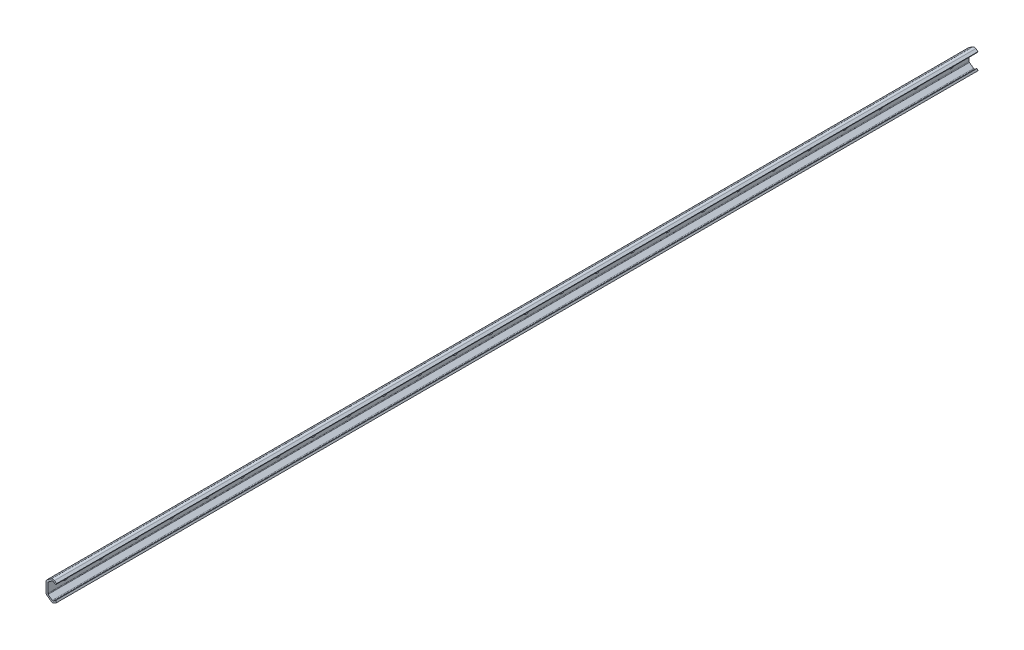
ISO-10303-21;
HEADER;
FILE_DESCRIPTION(('STEP AP214'),'2;1');
FILE_NAME('part.step','',(''),(''),'','','');
FILE_SCHEMA(('AUTOMOTIVE_DESIGN { 1 0 10303 214 1 1 1 1 }'));
ENDSEC;
DATA;
#1=APPLICATION_CONTEXT('core data for automotive mechanical design processes');
#2=APPLICATION_PROTOCOL_DEFINITION('international standard','automotive_design',2000,#1);
#3=PRODUCT_CONTEXT('',#1,'mechanical');
#4=PRODUCT('Part','Part','',(#3));
#5=PRODUCT_RELATED_PRODUCT_CATEGORY('part','',(#4));
#6=PRODUCT_DEFINITION_FORMATION('','',#4);
#7=PRODUCT_DEFINITION_CONTEXT('part definition',#1,'design');
#8=PRODUCT_DEFINITION('design','',#6,#7);
#9=PRODUCT_DEFINITION_SHAPE('','',#8);
#10=(LENGTH_UNIT() NAMED_UNIT(*) SI_UNIT(.MILLI.,.METRE.));
#11=(NAMED_UNIT(*) PLANE_ANGLE_UNIT() SI_UNIT($,.RADIAN.));
#12=(NAMED_UNIT(*) SI_UNIT($,.STERADIAN.) SOLID_ANGLE_UNIT());
#13=UNCERTAINTY_MEASURE_WITH_UNIT(LENGTH_MEASURE(1.E-05),#10,'distance_accuracy_value','');
#14=(GEOMETRIC_REPRESENTATION_CONTEXT(3) GLOBAL_UNCERTAINTY_ASSIGNED_CONTEXT((#13)) GLOBAL_UNIT_ASSIGNED_CONTEXT((#10,
#11,#12)) REPRESENTATION_CONTEXT('',''));
#15=CARTESIAN_POINT('',(0.,0.,0.));
#16=DIRECTION('',(0.,0.,1.));
#17=DIRECTION('',(1.,0.,0.));
#18=AXIS2_PLACEMENT_3D('',#15,#16,#17);
#19=CARTESIAN_POINT('',(16.8139924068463,-18.8268342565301,-2080.));
#20=DIRECTION('',(-0.573576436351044,0.819152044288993,0.));
#21=DIRECTION('',(-0.819152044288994,-0.573576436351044,0.));
#22=AXIS2_PLACEMENT_3D('',#19,#20,#21);
#23=PLANE('',#22);
#24=DIRECTION('',(-0.819152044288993,-0.573576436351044,0.));
#25=VECTOR('',#24,1.);
#26=CARTESIAN_POINT('',(16.8139924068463,-18.8268342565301,0.));
#27=LINE('',#26,#25);
#28=CARTESIAN_POINT('',(21.7056942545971,-15.4016277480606,0.));
#29=VERTEX_POINT('',#28);
#30=CARTESIAN_POINT('',(16.8139924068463,-18.8268342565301,0.));
#31=VERTEX_POINT('',#30);
#32=EDGE_CURVE('E892',#29,#31,#27,.T.);
#33=ORIENTED_EDGE('',*,*,#32,.F.);
#34=DIRECTION('',(0.,0.,1.));
#35=VECTOR('',#34,1.);
#36=CARTESIAN_POINT('',(21.7056942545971,-15.4016277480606,-2080.));
#37=LINE('',#36,#35);
#38=CARTESIAN_POINT('',(21.7056942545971,-15.4016277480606,-2080.));
#39=VERTEX_POINT('',#38);
#40=EDGE_CURVE('E1061',#39,#29,#37,.T.);
#41=ORIENTED_EDGE('',*,*,#40,.F.);
#42=DIRECTION('',(-0.819152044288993,-0.573576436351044,0.));
#43=VECTOR('',#42,1.);
#44=CARTESIAN_POINT('',(16.8139924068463,-18.8268342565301,-2080.));
#45=LINE('',#44,#43);
#46=CARTESIAN_POINT('',(16.8139924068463,-18.8268342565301,-2080.));
#47=VERTEX_POINT('',#46);
#48=EDGE_CURVE('E902',#39,#47,#45,.T.);
#49=ORIENTED_EDGE('',*,*,#48,.T.);
#50=DIRECTION('',(0.,0.,1.));
#51=VECTOR('',#50,1.);
#52=CARTESIAN_POINT('',(16.8139924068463,-18.8268342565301,-2080.));
#53=LINE('',#52,#51);
#54=EDGE_CURVE('E983',#47,#31,#53,.T.);
#55=ORIENTED_EDGE('',*,*,#54,.T.);
#56=EDGE_LOOP('',(#33,#41,#49,#55));
#57=FACE_BOUND('',#56,.T.);
#58=ADVANCED_FACE('F39',(#57),#23,.T.);
#59=CARTESIAN_POINT('',(21.7056942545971,-15.4016277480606,-2080.));
#60=DIRECTION('',(0.819152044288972,0.573576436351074,0.));
#61=DIRECTION('',(-0.573576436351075,0.819152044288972,0.));
#62=AXIS2_PLACEMENT_3D('',#59,#60,#61);
#63=PLANE('',#62);
#64=DIRECTION('',(-0.573576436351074,0.819152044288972,0.));
#65=VECTOR('',#64,1.);
#66=CARTESIAN_POINT('',(21.7056942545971,-15.4016277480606,0.));
#67=LINE('',#66,#65);
#68=CARTESIAN_POINT('',(24.0000000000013,-18.6782359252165,0.));
#69=VERTEX_POINT('',#68);
#70=EDGE_CURVE('E907',#69,#29,#67,.T.);
#71=ORIENTED_EDGE('',*,*,#70,.F.);
#72=DIRECTION('',(0.,0.,1.));
#73=VECTOR('',#72,1.);
#74=CARTESIAN_POINT('',(24.0000000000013,-18.6782359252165,-2080.));
#75=LINE('',#74,#73);
#76=CARTESIAN_POINT('',(24.0000000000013,-18.6782359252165,-2080.));
#77=VERTEX_POINT('',#76);
#78=EDGE_CURVE('E1065',#77,#69,#75,.T.);
#79=ORIENTED_EDGE('',*,*,#78,.F.);
#80=DIRECTION('',(-0.573576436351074,0.819152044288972,0.));
#81=VECTOR('',#80,1.);
#82=CARTESIAN_POINT('',(21.7056942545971,-15.4016277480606,-2080.));
#83=LINE('',#82,#81);
#84=EDGE_CURVE('E979',#77,#39,#83,.T.);
#85=ORIENTED_EDGE('',*,*,#84,.T.);
#86=ORIENTED_EDGE('',*,*,#40,.T.);
#87=EDGE_LOOP('',(#71,#79,#85,#86));
#88=FACE_BOUND('',#87,.T.);
#89=ADVANCED_FACE('F2184',(#88),#63,.T.);
#90=CARTESIAN_POINT('',(24.0000000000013,-18.6782359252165,-2080.));
#91=DIRECTION('',(0.573576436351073,-0.819152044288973,0.));
#92=DIRECTION('',(0.819152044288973,0.573576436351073,0.));
#93=AXIS2_PLACEMENT_3D('',#90,#91,#92);
#94=PLANE('',#93);
#95=DIRECTION('',(0.819152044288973,0.573576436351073,0.));
#96=VECTOR('',#95,1.);
#97=CARTESIAN_POINT('',(24.0000000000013,-18.6782359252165,0.));
#98=LINE('',#97,#96);
#99=CARTESIAN_POINT('',(19.036236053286,-22.1539008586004,0.));
#100=VERTEX_POINT('',#99);
#101=EDGE_CURVE('E1054',#100,#69,#98,.T.);
#102=ORIENTED_EDGE('',*,*,#101,.F.);
#103=DIRECTION('',(0.,0.,1.));
#104=VECTOR('',#103,1.);
#105=CARTESIAN_POINT('',(19.036236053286,-22.1539008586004,-2080.));
#106=LINE('',#105,#104);
#107=CARTESIAN_POINT('',(19.036236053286,-22.1539008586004,-2080.));
#108=VERTEX_POINT('',#107);
#109=EDGE_CURVE('E1068',#108,#100,#106,.T.);
#110=ORIENTED_EDGE('',*,*,#109,.F.);
#111=DIRECTION('',(0.819152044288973,0.573576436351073,0.));
#112=VECTOR('',#111,1.);
#113=CARTESIAN_POINT('',(24.0000000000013,-18.6782359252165,-2080.));
#114=LINE('',#113,#112);
#115=EDGE_CURVE('E975',#108,#77,#114,.T.);
#116=ORIENTED_EDGE('',*,*,#115,.T.);
#117=ORIENTED_EDGE('',*,*,#78,.T.);
#118=EDGE_LOOP('',(#102,#110,#116,#117));
#119=FACE_BOUND('',#118,.T.);
#120=ADVANCED_FACE('F2190',(#119),#94,.T.);
#121=CARTESIAN_POINT('',(15.5000000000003,-17.1036323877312,-2080.));
#122=DIRECTION('',(0.,0.,1.));
#123=DIRECTION('',(1.,0.,0.));
#124=AXIS2_PLACEMENT_3D('',#121,#122,#123);
#125=CYLINDRICAL_SURFACE('',#124,6.16523941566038);
#126=CARTESIAN_POINT('',(15.5000000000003,-17.1036323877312,0.));
#127=DIRECTION('',(0.,0.,1.));
#128=DIRECTION('',(-1.,0.,0.));
#129=AXIS2_PLACEMENT_3D('',#126,#127,#128);
#130=CIRCLE('',#129,6.16523941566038);
#131=CARTESIAN_POINT('',(11.9637639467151,-22.1539008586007,0.));
#132=VERTEX_POINT('',#131);
#133=EDGE_CURVE('E1050',#132,#100,#130,.T.);
#134=ORIENTED_EDGE('',*,*,#133,.F.);
#135=DIRECTION('',(0.,0.,1.));
#136=VECTOR('',#135,1.);
#137=CARTESIAN_POINT('',(11.9637639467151,-22.1539008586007,-2080.));
#138=LINE('',#137,#136);
#139=CARTESIAN_POINT('',(11.9637639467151,-22.1539008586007,-2080.));
#140=VERTEX_POINT('',#139);
#141=EDGE_CURVE('E1071',#140,#132,#138,.T.);
#142=ORIENTED_EDGE('',*,*,#141,.F.);
#143=CARTESIAN_POINT('',(15.5000000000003,-17.1036323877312,-2080.));
#144=DIRECTION('',(0.,0.,1.));
#145=DIRECTION('',(-1.,0.,0.));
#146=AXIS2_PLACEMENT_3D('',#143,#144,#145);
#147=CIRCLE('',#146,6.16523941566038);
#148=EDGE_CURVE('E971',#140,#108,#147,.T.);
#149=ORIENTED_EDGE('',*,*,#148,.T.);
#150=ORIENTED_EDGE('',*,*,#109,.T.);
#151=EDGE_LOOP('',(#134,#142,#149,#150));
#152=FACE_BOUND('',#151,.T.);
#153=ADVANCED_FACE('F2617',(#152),#125,.T.);
#154=CARTESIAN_POINT('',(11.9637639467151,-22.1539008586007,-2080.));
#155=DIRECTION('',(-0.573576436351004,-0.819152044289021,0.));
#156=DIRECTION('',(0.819152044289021,-0.573576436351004,0.));
#157=AXIS2_PLACEMENT_3D('',#154,#155,#156);
#158=PLANE('',#157);
#159=DIRECTION('',(0.819152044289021,-0.573576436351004,0.));
#160=VECTOR('',#159,1.);
#161=CARTESIAN_POINT('',(11.9637639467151,-22.1539008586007,0.));
#162=LINE('',#161,#160);
#163=CARTESIAN_POINT('',(3.37185235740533,-16.1377795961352,0.));
#164=VERTEX_POINT('',#163);
#165=EDGE_CURVE('E1046',#164,#132,#162,.T.);
#166=ORIENTED_EDGE('',*,*,#165,.F.);
#167=DIRECTION('',(0.,0.,1.));
#168=VECTOR('',#167,1.);
#169=CARTESIAN_POINT('',(3.37185235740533,-16.1377795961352,-2080.));
#170=LINE('',#169,#168);
#171=CARTESIAN_POINT('',(3.37185235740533,-16.1377795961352,-2080.));
#172=VERTEX_POINT('',#171);
#173=EDGE_CURVE('E1074',#172,#164,#170,.T.);
#174=ORIENTED_EDGE('',*,*,#173,.F.);
#175=DIRECTION('',(0.819152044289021,-0.573576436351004,0.));
#176=VECTOR('',#175,1.);
#177=CARTESIAN_POINT('',(11.9637639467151,-22.1539008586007,-2080.));
#178=LINE('',#177,#176);
#179=EDGE_CURVE('E967',#172,#140,#178,.T.);
#180=ORIENTED_EDGE('',*,*,#179,.T.);
#181=ORIENTED_EDGE('',*,*,#141,.T.);
#182=EDGE_LOOP('',(#166,#174,#180,#181));
#183=FACE_BOUND('',#182,.T.);
#184=ADVANCED_FACE('F2621',(#183),#158,.T.);
#185=CARTESIAN_POINT('',(6.50000000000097,-10.440000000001,-2080.));
#186=DIRECTION('',(0.,0.,1.));
#187=DIRECTION('',(1.,0.,0.));
#188=AXIS2_PLACEMENT_3D('',#185,#186,#187);
#189=CYLINDRICAL_SURFACE('',#188,6.50000000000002);
#190=CARTESIAN_POINT('',(6.50000000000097,-10.440000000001,0.));
#191=DIRECTION('',(0.,0.,1.));
#192=DIRECTION('',(1.,0.,0.));
#193=AXIS2_PLACEMENT_3D('',#190,#191,#192);
#194=CIRCLE('',#193,6.50000000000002);
#195=CARTESIAN_POINT('',(9.51495826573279E-13,-10.440000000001,0.));
#196=VERTEX_POINT('',#195);
#197=EDGE_CURVE('E1042',#196,#164,#194,.T.);
#198=ORIENTED_EDGE('',*,*,#197,.F.);
#199=DIRECTION('',(0.,0.,1.));
#200=VECTOR('',#199,1.);
#201=CARTESIAN_POINT('',(9.51495826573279E-13,-10.440000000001,-2080.));
#202=LINE('',#201,#200);
#203=CARTESIAN_POINT('',(9.51495826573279E-13,-10.440000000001,-2080.));
#204=VERTEX_POINT('',#203);
#205=EDGE_CURVE('E1077',#204,#196,#202,.T.);
#206=ORIENTED_EDGE('',*,*,#205,.F.);
#207=CARTESIAN_POINT('',(6.50000000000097,-10.440000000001,-2080.));
#208=DIRECTION('',(0.,0.,1.));
#209=DIRECTION('',(1.,0.,0.));
#210=AXIS2_PLACEMENT_3D('',#207,#208,#209);
#211=CIRCLE('',#210,6.50000000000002);
#212=EDGE_CURVE('E963',#204,#172,#211,.T.);
#213=ORIENTED_EDGE('',*,*,#212,.T.);
#214=ORIENTED_EDGE('',*,*,#173,.T.);
#215=EDGE_LOOP('',(#198,#206,#213,#214));
#216=FACE_BOUND('',#215,.T.);
#217=ADVANCED_FACE('F2626',(#216),#189,.T.);
#218=CARTESIAN_POINT('',(9.5062846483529E-13,-10.440000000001,-2080.));
#219=DIRECTION('',(-1.,0.,0.));
#220=DIRECTION('',(0.,-1.,0.));
#221=AXIS2_PLACEMENT_3D('',#218,#219,#220);
#222=PLANE('',#221);
#223=CARTESIAN_POINT('',(7.40726924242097E-13,0.,-119.));
#224=DIRECTION('',(1.,0.,0.));
#225=DIRECTION('',(0.,1.,0.));
#226=AXIS2_PLACEMENT_3D('',#223,#224,#225);
#227=CIRCLE('',#226,4.5);
#228=CARTESIAN_POINT('',(7.40726924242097E-13,4.5,-119.));
#229=VERTEX_POINT('',#228);
#230=CARTESIAN_POINT('',(7.40726924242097E-13,-4.5,-119.));
#231=VERTEX_POINT('',#230);
#232=EDGE_CURVE('E853',#229,#231,#227,.T.);
#233=ORIENTED_EDGE('',*,*,#232,.T.);
#234=DIRECTION('',(0.,0.,-1.));
#235=VECTOR('',#234,1.);
#236=CARTESIAN_POINT('',(7.40726924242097E-13,-4.5,-119.));
#237=LINE('',#236,#235);
#238=CARTESIAN_POINT('',(9.5112196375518E-13,-4.5,-121.));
#239=VERTEX_POINT('',#238);
#240=EDGE_CURVE('E814',#231,#239,#237,.T.);
#241=ORIENTED_EDGE('',*,*,#240,.T.);
#242=CARTESIAN_POINT('',(7.40726924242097E-13,0.,-121.));
#243=DIRECTION('',(1.,0.,0.));
#244=DIRECTION('',(0.,-1.,0.));
#245=AXIS2_PLACEMENT_3D('',#242,#243,#244);
#246=CIRCLE('',#245,4.5);
#247=CARTESIAN_POINT('',(7.40726924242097E-13,4.5,-121.));
#248=VERTEX_POINT('',#247);
#249=EDGE_CURVE('E821',#239,#248,#246,.T.);
#250=ORIENTED_EDGE('',*,*,#249,.T.);
#251=DIRECTION('',(0.,0.,1.));
#252=VECTOR('',#251,1.);
#253=CARTESIAN_POINT('',(7.40726924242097E-13,4.5,-119.));
#254=LINE('',#253,#252);
#255=EDGE_CURVE('E846',#248,#229,#254,.T.);
#256=ORIENTED_EDGE('',*,*,#255,.T.);
#257=EDGE_LOOP('',(#233,#241,#250,#256));
#258=FACE_BOUND('',#257,.T.);
#259=CARTESIAN_POINT('',(7.40726924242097E-13,0.,-39.));
#260=DIRECTION('',(1.,0.,0.));
#261=DIRECTION('',(0.,1.,0.));
#262=AXIS2_PLACEMENT_3D('',#259,#260,#261);
#263=CIRCLE('',#262,4.5);
#264=CARTESIAN_POINT('',(7.40726924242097E-13,4.5,-39.));
#265=VERTEX_POINT('',#264);
#266=CARTESIAN_POINT('',(7.40726924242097E-13,-4.5,-39.));
#267=VERTEX_POINT('',#266);
#268=EDGE_CURVE('E858',#265,#267,#263,.T.);
#269=ORIENTED_EDGE('',*,*,#268,.T.);
#270=DIRECTION('',(0.,0.,-1.));
#271=VECTOR('',#270,1.);
#272=CARTESIAN_POINT('',(7.40726924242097E-13,-4.5,-39.));
#273=LINE('',#272,#271);
#274=CARTESIAN_POINT('',(9.5112196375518E-13,-4.5,-40.9999999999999));
#275=VERTEX_POINT('',#274);
#276=EDGE_CURVE('E862',#267,#275,#273,.T.);
#277=ORIENTED_EDGE('',*,*,#276,.T.);
#278=CARTESIAN_POINT('',(7.40726924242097E-13,0.,-41.));
#279=DIRECTION('',(1.,0.,0.));
#280=DIRECTION('',(0.,-1.,0.));
#281=AXIS2_PLACEMENT_3D('',#278,#279,#280);
#282=CIRCLE('',#281,4.5);
#283=CARTESIAN_POINT('',(7.40726924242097E-13,4.5,-41.));
#284=VERTEX_POINT('',#283);
#285=EDGE_CURVE('E867',#275,#284,#282,.T.);
#286=ORIENTED_EDGE('',*,*,#285,.T.);
#287=DIRECTION('',(0.,0.,1.));
#288=VECTOR('',#287,1.);
#289=CARTESIAN_POINT('',(7.40726924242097E-13,4.5,-39.));
#290=LINE('',#289,#288);
#291=EDGE_CURVE('E871',#284,#265,#290,.T.);
#292=ORIENTED_EDGE('',*,*,#291,.T.);
#293=EDGE_LOOP('',(#269,#277,#286,#292));
#294=FACE_BOUND('',#293,.T.);
#295=DIRECTION('',(0.,-1.,0.));
#296=VECTOR('',#295,1.);
#297=CARTESIAN_POINT('',(9.5062846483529E-13,-10.440000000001,0.));
#298=LINE('',#297,#296);
#299=CARTESIAN_POINT('',(9.52363188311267E-13,10.4399999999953,0.));
#300=VERTEX_POINT('',#299);
#301=EDGE_CURVE('E1038',#300,#196,#298,.T.);
#302=ORIENTED_EDGE('',*,*,#301,.F.);
#303=DIRECTION('',(0.,0.,1.));
#304=VECTOR('',#303,1.);
#305=CARTESIAN_POINT('',(9.52363188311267E-13,10.4399999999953,-2080.));
#306=LINE('',#305,#304);
#307=CARTESIAN_POINT('',(9.52363188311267E-13,10.4399999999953,-2080.));
#308=VERTEX_POINT('',#307);
#309=EDGE_CURVE('E1080',#308,#300,#306,.T.);
#310=ORIENTED_EDGE('',*,*,#309,.F.);
#311=DIRECTION('',(0.,-1.,0.));
#312=VECTOR('',#311,1.);
#313=CARTESIAN_POINT('',(9.5062846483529E-13,-10.440000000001,-2080.));
#314=LINE('',#313,#312);
#315=EDGE_CURVE('E959',#308,#204,#314,.T.);
#316=ORIENTED_EDGE('',*,*,#315,.T.);
#317=ORIENTED_EDGE('',*,*,#205,.T.);
#318=EDGE_LOOP('',(#302,#310,#316,#317));
#319=FACE_BOUND('',#318,.T.);
#320=CARTESIAN_POINT('',(7.40726924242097E-13,0.,-199.));
#321=DIRECTION('',(1.,0.,0.));
#322=DIRECTION('',(0.,1.,0.));
#323=AXIS2_PLACEMENT_3D('',#320,#321,#322);
#324=CIRCLE('',#323,4.5);
#325=CARTESIAN_POINT('',(7.40726924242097E-13,4.5,-199.));
#326=VERTEX_POINT('',#325);
#327=CARTESIAN_POINT('',(7.40726924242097E-13,-4.5,-199.));
#328=VERTEX_POINT('',#327);
#329=EDGE_CURVE('E1135',#326,#328,#324,.T.);
#330=ORIENTED_EDGE('',*,*,#329,.T.);
#331=DIRECTION('',(0.,0.,-1.));
#332=VECTOR('',#331,1.);
#333=CARTESIAN_POINT('',(7.40726924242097E-13,-4.5,-199.));
#334=LINE('',#333,#332);
#335=CARTESIAN_POINT('',(9.5112196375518E-13,-4.5,-201.));
#336=VERTEX_POINT('',#335);
#337=EDGE_CURVE('E1138',#328,#336,#334,.T.);
#338=ORIENTED_EDGE('',*,*,#337,.T.);
#339=CARTESIAN_POINT('',(7.40726924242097E-13,0.,-201.));
#340=DIRECTION('',(1.,0.,0.));
#341=DIRECTION('',(0.,-1.,0.));
#342=AXIS2_PLACEMENT_3D('',#339,#340,#341);
#343=CIRCLE('',#342,4.5);
#344=CARTESIAN_POINT('',(7.40726924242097E-13,4.5,-201.));
#345=VERTEX_POINT('',#344);
#346=EDGE_CURVE('E1141',#336,#345,#343,.T.);
#347=ORIENTED_EDGE('',*,*,#346,.T.);
#348=DIRECTION('',(0.,0.,1.));
#349=VECTOR('',#348,1.);
#350=CARTESIAN_POINT('',(7.40726924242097E-13,4.5,-199.));
#351=LINE('',#350,#349);
#352=EDGE_CURVE('E1144',#345,#326,#351,.T.);
#353=ORIENTED_EDGE('',*,*,#352,.T.);
#354=EDGE_LOOP('',(#330,#338,#347,#353));
#355=FACE_BOUND('',#354,.T.);
#356=CARTESIAN_POINT('',(7.40726924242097E-13,0.,-279.));
#357=DIRECTION('',(1.,0.,0.));
#358=DIRECTION('',(0.,1.,0.));
#359=AXIS2_PLACEMENT_3D('',#356,#357,#358);
#360=CIRCLE('',#359,4.5);
#361=CARTESIAN_POINT('',(7.40726924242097E-13,4.5,-279.));
#362=VERTEX_POINT('',#361);
#363=CARTESIAN_POINT('',(7.40726924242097E-13,-4.5,-279.));
#364=VERTEX_POINT('',#363);
#365=EDGE_CURVE('E1178',#362,#364,#360,.T.);
#366=ORIENTED_EDGE('',*,*,#365,.T.);
#367=DIRECTION('',(0.,0.,-1.));
#368=VECTOR('',#367,1.);
#369=CARTESIAN_POINT('',(7.40726924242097E-13,-4.5,-279.));
#370=LINE('',#369,#368);
#371=CARTESIAN_POINT('',(9.5112196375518E-13,-4.5,-281.));
#372=VERTEX_POINT('',#371);
#373=EDGE_CURVE('E1181',#364,#372,#370,.T.);
#374=ORIENTED_EDGE('',*,*,#373,.T.);
#375=CARTESIAN_POINT('',(7.40726924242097E-13,0.,-281.));
#376=DIRECTION('',(1.,0.,0.));
#377=DIRECTION('',(0.,-1.,0.));
#378=AXIS2_PLACEMENT_3D('',#375,#376,#377);
#379=CIRCLE('',#378,4.5);
#380=CARTESIAN_POINT('',(7.40726924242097E-13,4.5,-281.));
#381=VERTEX_POINT('',#380);
#382=EDGE_CURVE('E1184',#372,#381,#379,.T.);
#383=ORIENTED_EDGE('',*,*,#382,.T.);
#384=DIRECTION('',(0.,0.,1.));
#385=VECTOR('',#384,1.);
#386=CARTESIAN_POINT('',(7.40726924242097E-13,4.5,-279.));
#387=LINE('',#386,#385);
#388=EDGE_CURVE('E1187',#381,#362,#387,.T.);
#389=ORIENTED_EDGE('',*,*,#388,.T.);
#390=EDGE_LOOP('',(#366,#374,#383,#389));
#391=FACE_BOUND('',#390,.T.);
#392=CARTESIAN_POINT('',(7.40726924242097E-13,0.,-359.));
#393=DIRECTION('',(1.,0.,0.));
#394=DIRECTION('',(0.,1.,0.));
#395=AXIS2_PLACEMENT_3D('',#392,#393,#394);
#396=CIRCLE('',#395,4.5);
#397=CARTESIAN_POINT('',(7.40726924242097E-13,4.5,-359.));
#398=VERTEX_POINT('',#397);
#399=CARTESIAN_POINT('',(7.40726924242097E-13,-4.5,-359.));
#400=VERTEX_POINT('',#399);
#401=EDGE_CURVE('E1222',#398,#400,#396,.T.);
#402=ORIENTED_EDGE('',*,*,#401,.T.);
#403=DIRECTION('',(0.,0.,-1.));
#404=VECTOR('',#403,1.);
#405=CARTESIAN_POINT('',(7.40726924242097E-13,-4.5,-359.));
#406=LINE('',#405,#404);
#407=CARTESIAN_POINT('',(9.5112196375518E-13,-4.5,-361.));
#408=VERTEX_POINT('',#407);
#409=EDGE_CURVE('E1225',#400,#408,#406,.T.);
#410=ORIENTED_EDGE('',*,*,#409,.T.);
#411=CARTESIAN_POINT('',(7.40726924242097E-13,0.,-361.));
#412=DIRECTION('',(1.,0.,0.));
#413=DIRECTION('',(0.,-1.,0.));
#414=AXIS2_PLACEMENT_3D('',#411,#412,#413);
#415=CIRCLE('',#414,4.5);
#416=CARTESIAN_POINT('',(7.40726924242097E-13,4.5,-361.));
#417=VERTEX_POINT('',#416);
#418=EDGE_CURVE('E1228',#408,#417,#415,.T.);
#419=ORIENTED_EDGE('',*,*,#418,.T.);
#420=DIRECTION('',(0.,0.,1.));
#421=VECTOR('',#420,1.);
#422=CARTESIAN_POINT('',(7.40726924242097E-13,4.5,-359.));
#423=LINE('',#422,#421);
#424=EDGE_CURVE('E1231',#417,#398,#423,.T.);
#425=ORIENTED_EDGE('',*,*,#424,.T.);
#426=EDGE_LOOP('',(#402,#410,#419,#425));
#427=FACE_BOUND('',#426,.T.);
#428=CARTESIAN_POINT('',(7.40726924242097E-13,0.,-439.));
#429=DIRECTION('',(1.,0.,0.));
#430=DIRECTION('',(0.,1.,0.));
#431=AXIS2_PLACEMENT_3D('',#428,#429,#430);
#432=CIRCLE('',#431,4.5);
#433=CARTESIAN_POINT('',(7.40726924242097E-13,4.5,-439.));
#434=VERTEX_POINT('',#433);
#435=CARTESIAN_POINT('',(7.40726924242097E-13,-4.5,-439.));
#436=VERTEX_POINT('',#435);
#437=EDGE_CURVE('E1266',#434,#436,#432,.T.);
#438=ORIENTED_EDGE('',*,*,#437,.T.);
#439=DIRECTION('',(0.,0.,-1.));
#440=VECTOR('',#439,1.);
#441=CARTESIAN_POINT('',(7.40726924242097E-13,-4.5,-439.));
#442=LINE('',#441,#440);
#443=CARTESIAN_POINT('',(9.5112196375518E-13,-4.5,-441.));
#444=VERTEX_POINT('',#443);
#445=EDGE_CURVE('E1269',#436,#444,#442,.T.);
#446=ORIENTED_EDGE('',*,*,#445,.T.);
#447=CARTESIAN_POINT('',(7.40726924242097E-13,0.,-441.));
#448=DIRECTION('',(1.,0.,0.));
#449=DIRECTION('',(0.,-1.,0.));
#450=AXIS2_PLACEMENT_3D('',#447,#448,#449);
#451=CIRCLE('',#450,4.5);
#452=CARTESIAN_POINT('',(7.40726924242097E-13,4.5,-441.));
#453=VERTEX_POINT('',#452);
#454=EDGE_CURVE('E1272',#444,#453,#451,.T.);
#455=ORIENTED_EDGE('',*,*,#454,.T.);
#456=DIRECTION('',(0.,0.,1.));
#457=VECTOR('',#456,1.);
#458=CARTESIAN_POINT('',(7.40726924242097E-13,4.5,-439.));
#459=LINE('',#458,#457);
#460=EDGE_CURVE('E1275',#453,#434,#459,.T.);
#461=ORIENTED_EDGE('',*,*,#460,.T.);
#462=EDGE_LOOP('',(#438,#446,#455,#461));
#463=FACE_BOUND('',#462,.T.);
#464=CARTESIAN_POINT('',(7.40726924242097E-13,0.,-519.));
#465=DIRECTION('',(1.,0.,0.));
#466=DIRECTION('',(0.,1.,0.));
#467=AXIS2_PLACEMENT_3D('',#464,#465,#466);
#468=CIRCLE('',#467,4.5);
#469=CARTESIAN_POINT('',(7.40726924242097E-13,4.5,-519.));
#470=VERTEX_POINT('',#469);
#471=CARTESIAN_POINT('',(7.40726924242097E-13,-4.5,-519.));
#472=VERTEX_POINT('',#471);
#473=EDGE_CURVE('E1310',#470,#472,#468,.T.);
#474=ORIENTED_EDGE('',*,*,#473,.T.);
#475=DIRECTION('',(0.,0.,-1.));
#476=VECTOR('',#475,1.);
#477=CARTESIAN_POINT('',(7.40726924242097E-13,-4.5,-519.));
#478=LINE('',#477,#476);
#479=CARTESIAN_POINT('',(9.5112196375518E-13,-4.5,-521.));
#480=VERTEX_POINT('',#479);
#481=EDGE_CURVE('E1313',#472,#480,#478,.T.);
#482=ORIENTED_EDGE('',*,*,#481,.T.);
#483=CARTESIAN_POINT('',(7.40726924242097E-13,0.,-521.));
#484=DIRECTION('',(1.,0.,0.));
#485=DIRECTION('',(0.,-1.,0.));
#486=AXIS2_PLACEMENT_3D('',#483,#484,#485);
#487=CIRCLE('',#486,4.5);
#488=CARTESIAN_POINT('',(7.40726924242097E-13,4.5,-521.));
#489=VERTEX_POINT('',#488);
#490=EDGE_CURVE('E1316',#480,#489,#487,.T.);
#491=ORIENTED_EDGE('',*,*,#490,.T.);
#492=DIRECTION('',(0.,0.,1.));
#493=VECTOR('',#492,1.);
#494=CARTESIAN_POINT('',(7.40726924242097E-13,4.5,-519.));
#495=LINE('',#494,#493);
#496=EDGE_CURVE('E1319',#489,#470,#495,.T.);
#497=ORIENTED_EDGE('',*,*,#496,.T.);
#498=EDGE_LOOP('',(#474,#482,#491,#497));
#499=FACE_BOUND('',#498,.T.);
#500=CARTESIAN_POINT('',(7.40726924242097E-13,0.,-599.));
#501=DIRECTION('',(1.,0.,0.));
#502=DIRECTION('',(0.,1.,0.));
#503=AXIS2_PLACEMENT_3D('',#500,#501,#502);
#504=CIRCLE('',#503,4.5);
#505=CARTESIAN_POINT('',(7.40726924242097E-13,4.5,-599.));
#506=VERTEX_POINT('',#505);
#507=CARTESIAN_POINT('',(7.40726924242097E-13,-4.5,-599.));
#508=VERTEX_POINT('',#507);
#509=EDGE_CURVE('E1354',#506,#508,#504,.T.);
#510=ORIENTED_EDGE('',*,*,#509,.T.);
#511=DIRECTION('',(0.,0.,-1.));
#512=VECTOR('',#511,1.);
#513=CARTESIAN_POINT('',(7.40726924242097E-13,-4.5,-599.));
#514=LINE('',#513,#512);
#515=CARTESIAN_POINT('',(9.5112196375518E-13,-4.5,-601.));
#516=VERTEX_POINT('',#515);
#517=EDGE_CURVE('E1357',#508,#516,#514,.T.);
#518=ORIENTED_EDGE('',*,*,#517,.T.);
#519=CARTESIAN_POINT('',(7.40726924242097E-13,0.,-601.));
#520=DIRECTION('',(1.,0.,0.));
#521=DIRECTION('',(0.,-1.,0.));
#522=AXIS2_PLACEMENT_3D('',#519,#520,#521);
#523=CIRCLE('',#522,4.5);
#524=CARTESIAN_POINT('',(7.40726924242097E-13,4.5,-601.));
#525=VERTEX_POINT('',#524);
#526=EDGE_CURVE('E1360',#516,#525,#523,.T.);
#527=ORIENTED_EDGE('',*,*,#526,.T.);
#528=DIRECTION('',(0.,0.,1.));
#529=VECTOR('',#528,1.);
#530=CARTESIAN_POINT('',(7.40726924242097E-13,4.5,-599.));
#531=LINE('',#530,#529);
#532=EDGE_CURVE('E1363',#525,#506,#531,.T.);
#533=ORIENTED_EDGE('',*,*,#532,.T.);
#534=EDGE_LOOP('',(#510,#518,#527,#533));
#535=FACE_BOUND('',#534,.T.);
#536=CARTESIAN_POINT('',(7.40726924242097E-13,0.,-679.));
#537=DIRECTION('',(1.,0.,0.));
#538=DIRECTION('',(0.,1.,0.));
#539=AXIS2_PLACEMENT_3D('',#536,#537,#538);
#540=CIRCLE('',#539,4.5);
#541=CARTESIAN_POINT('',(7.40726924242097E-13,4.5,-679.));
#542=VERTEX_POINT('',#541);
#543=CARTESIAN_POINT('',(7.40726924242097E-13,-4.5,-679.));
#544=VERTEX_POINT('',#543);
#545=EDGE_CURVE('E1398',#542,#544,#540,.T.);
#546=ORIENTED_EDGE('',*,*,#545,.T.);
#547=DIRECTION('',(0.,0.,-1.));
#548=VECTOR('',#547,1.);
#549=CARTESIAN_POINT('',(7.40726924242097E-13,-4.5,-679.));
#550=LINE('',#549,#548);
#551=CARTESIAN_POINT('',(9.5112196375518E-13,-4.5,-681.));
#552=VERTEX_POINT('',#551);
#553=EDGE_CURVE('E1401',#544,#552,#550,.T.);
#554=ORIENTED_EDGE('',*,*,#553,.T.);
#555=CARTESIAN_POINT('',(7.40726924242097E-13,0.,-681.));
#556=DIRECTION('',(1.,0.,0.));
#557=DIRECTION('',(0.,-1.,0.));
#558=AXIS2_PLACEMENT_3D('',#555,#556,#557);
#559=CIRCLE('',#558,4.5);
#560=CARTESIAN_POINT('',(7.40726924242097E-13,4.5,-681.));
#561=VERTEX_POINT('',#560);
#562=EDGE_CURVE('E1404',#552,#561,#559,.T.);
#563=ORIENTED_EDGE('',*,*,#562,.T.);
#564=DIRECTION('',(0.,0.,1.));
#565=VECTOR('',#564,1.);
#566=CARTESIAN_POINT('',(7.40726924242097E-13,4.5,-679.));
#567=LINE('',#566,#565);
#568=EDGE_CURVE('E1407',#561,#542,#567,.T.);
#569=ORIENTED_EDGE('',*,*,#568,.T.);
#570=EDGE_LOOP('',(#546,#554,#563,#569));
#571=FACE_BOUND('',#570,.T.);
#572=CARTESIAN_POINT('',(7.40726924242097E-13,0.,-759.));
#573=DIRECTION('',(1.,0.,0.));
#574=DIRECTION('',(0.,1.,0.));
#575=AXIS2_PLACEMENT_3D('',#572,#573,#574);
#576=CIRCLE('',#575,4.5);
#577=CARTESIAN_POINT('',(7.40726924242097E-13,4.5,-759.));
#578=VERTEX_POINT('',#577);
#579=CARTESIAN_POINT('',(7.40726924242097E-13,-4.5,-759.));
#580=VERTEX_POINT('',#579);
#581=EDGE_CURVE('E1442',#578,#580,#576,.T.);
#582=ORIENTED_EDGE('',*,*,#581,.T.);
#583=DIRECTION('',(0.,0.,-1.));
#584=VECTOR('',#583,1.);
#585=CARTESIAN_POINT('',(7.40726924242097E-13,-4.5,-759.));
#586=LINE('',#585,#584);
#587=CARTESIAN_POINT('',(9.5112196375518E-13,-4.5,-761.));
#588=VERTEX_POINT('',#587);
#589=EDGE_CURVE('E1445',#580,#588,#586,.T.);
#590=ORIENTED_EDGE('',*,*,#589,.T.);
#591=CARTESIAN_POINT('',(7.40726924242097E-13,0.,-761.));
#592=DIRECTION('',(1.,0.,0.));
#593=DIRECTION('',(0.,-1.,0.));
#594=AXIS2_PLACEMENT_3D('',#591,#592,#593);
#595=CIRCLE('',#594,4.5);
#596=CARTESIAN_POINT('',(7.40726924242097E-13,4.5,-761.));
#597=VERTEX_POINT('',#596);
#598=EDGE_CURVE('E1448',#588,#597,#595,.T.);
#599=ORIENTED_EDGE('',*,*,#598,.T.);
#600=DIRECTION('',(0.,0.,1.));
#601=VECTOR('',#600,1.);
#602=CARTESIAN_POINT('',(7.40726924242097E-13,4.5,-759.));
#603=LINE('',#602,#601);
#604=EDGE_CURVE('E1451',#597,#578,#603,.T.);
#605=ORIENTED_EDGE('',*,*,#604,.T.);
#606=EDGE_LOOP('',(#582,#590,#599,#605));
#607=FACE_BOUND('',#606,.T.);
#608=CARTESIAN_POINT('',(7.40726924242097E-13,0.,-839.));
#609=DIRECTION('',(1.,0.,0.));
#610=DIRECTION('',(0.,1.,0.));
#611=AXIS2_PLACEMENT_3D('',#608,#609,#610);
#612=CIRCLE('',#611,4.5);
#613=CARTESIAN_POINT('',(7.40726924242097E-13,4.5,-839.));
#614=VERTEX_POINT('',#613);
#615=CARTESIAN_POINT('',(7.40726924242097E-13,-4.5,-839.));
#616=VERTEX_POINT('',#615);
#617=EDGE_CURVE('E1486',#614,#616,#612,.T.);
#618=ORIENTED_EDGE('',*,*,#617,.T.);
#619=DIRECTION('',(0.,0.,-1.));
#620=VECTOR('',#619,1.);
#621=CARTESIAN_POINT('',(7.40726924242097E-13,-4.5,-839.));
#622=LINE('',#621,#620);
#623=CARTESIAN_POINT('',(9.5112196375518E-13,-4.5,-841.));
#624=VERTEX_POINT('',#623);
#625=EDGE_CURVE('E1489',#616,#624,#622,.T.);
#626=ORIENTED_EDGE('',*,*,#625,.T.);
#627=CARTESIAN_POINT('',(7.40726924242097E-13,0.,-841.));
#628=DIRECTION('',(1.,0.,0.));
#629=DIRECTION('',(0.,-1.,0.));
#630=AXIS2_PLACEMENT_3D('',#627,#628,#629);
#631=CIRCLE('',#630,4.5);
#632=CARTESIAN_POINT('',(7.40726924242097E-13,4.5,-841.));
#633=VERTEX_POINT('',#632);
#634=EDGE_CURVE('E1492',#624,#633,#631,.T.);
#635=ORIENTED_EDGE('',*,*,#634,.T.);
#636=DIRECTION('',(0.,0.,1.));
#637=VECTOR('',#636,1.);
#638=CARTESIAN_POINT('',(7.40726924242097E-13,4.5,-839.));
#639=LINE('',#638,#637);
#640=EDGE_CURVE('E1495',#633,#614,#639,.T.);
#641=ORIENTED_EDGE('',*,*,#640,.T.);
#642=EDGE_LOOP('',(#618,#626,#635,#641));
#643=FACE_BOUND('',#642,.T.);
#644=CARTESIAN_POINT('',(7.40726924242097E-13,0.,-919.));
#645=DIRECTION('',(1.,0.,0.));
#646=DIRECTION('',(0.,1.,0.));
#647=AXIS2_PLACEMENT_3D('',#644,#645,#646);
#648=CIRCLE('',#647,4.5);
#649=CARTESIAN_POINT('',(7.40726924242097E-13,4.5,-919.));
#650=VERTEX_POINT('',#649);
#651=CARTESIAN_POINT('',(7.40726924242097E-13,-4.5,-919.));
#652=VERTEX_POINT('',#651);
#653=EDGE_CURVE('E1530',#650,#652,#648,.T.);
#654=ORIENTED_EDGE('',*,*,#653,.T.);
#655=DIRECTION('',(0.,0.,-1.));
#656=VECTOR('',#655,1.);
#657=CARTESIAN_POINT('',(7.40726924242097E-13,-4.5,-919.));
#658=LINE('',#657,#656);
#659=CARTESIAN_POINT('',(9.5112196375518E-13,-4.5,-921.));
#660=VERTEX_POINT('',#659);
#661=EDGE_CURVE('E1533',#652,#660,#658,.T.);
#662=ORIENTED_EDGE('',*,*,#661,.T.);
#663=CARTESIAN_POINT('',(7.40726924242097E-13,0.,-921.));
#664=DIRECTION('',(1.,0.,0.));
#665=DIRECTION('',(0.,-1.,0.));
#666=AXIS2_PLACEMENT_3D('',#663,#664,#665);
#667=CIRCLE('',#666,4.5);
#668=CARTESIAN_POINT('',(7.40726924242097E-13,4.5,-921.));
#669=VERTEX_POINT('',#668);
#670=EDGE_CURVE('E1536',#660,#669,#667,.T.);
#671=ORIENTED_EDGE('',*,*,#670,.T.);
#672=DIRECTION('',(0.,0.,1.));
#673=VECTOR('',#672,1.);
#674=CARTESIAN_POINT('',(7.40726924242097E-13,4.5,-919.));
#675=LINE('',#674,#673);
#676=EDGE_CURVE('E1539',#669,#650,#675,.T.);
#677=ORIENTED_EDGE('',*,*,#676,.T.);
#678=EDGE_LOOP('',(#654,#662,#671,#677));
#679=FACE_BOUND('',#678,.T.);
#680=CARTESIAN_POINT('',(7.40726924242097E-13,0.,-999.));
#681=DIRECTION('',(1.,0.,0.));
#682=DIRECTION('',(0.,1.,0.));
#683=AXIS2_PLACEMENT_3D('',#680,#681,#682);
#684=CIRCLE('',#683,4.5);
#685=CARTESIAN_POINT('',(7.40726924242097E-13,4.5,-999.));
#686=VERTEX_POINT('',#685);
#687=CARTESIAN_POINT('',(7.40726924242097E-13,-4.5,-999.));
#688=VERTEX_POINT('',#687);
#689=EDGE_CURVE('E1574',#686,#688,#684,.T.);
#690=ORIENTED_EDGE('',*,*,#689,.T.);
#691=DIRECTION('',(0.,0.,-1.));
#692=VECTOR('',#691,1.);
#693=CARTESIAN_POINT('',(7.40726924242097E-13,-4.5,-999.));
#694=LINE('',#693,#692);
#695=CARTESIAN_POINT('',(9.5112196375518E-13,-4.5,-1001.));
#696=VERTEX_POINT('',#695);
#697=EDGE_CURVE('E1577',#688,#696,#694,.T.);
#698=ORIENTED_EDGE('',*,*,#697,.T.);
#699=CARTESIAN_POINT('',(7.40726924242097E-13,0.,-1001.));
#700=DIRECTION('',(1.,0.,0.));
#701=DIRECTION('',(0.,-1.,0.));
#702=AXIS2_PLACEMENT_3D('',#699,#700,#701);
#703=CIRCLE('',#702,4.5);
#704=CARTESIAN_POINT('',(7.40726924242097E-13,4.5,-1001.));
#705=VERTEX_POINT('',#704);
#706=EDGE_CURVE('E1580',#696,#705,#703,.T.);
#707=ORIENTED_EDGE('',*,*,#706,.T.);
#708=DIRECTION('',(0.,0.,1.));
#709=VECTOR('',#708,1.);
#710=CARTESIAN_POINT('',(7.40726924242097E-13,4.5,-999.));
#711=LINE('',#710,#709);
#712=EDGE_CURVE('E1583',#705,#686,#711,.T.);
#713=ORIENTED_EDGE('',*,*,#712,.T.);
#714=EDGE_LOOP('',(#690,#698,#707,#713));
#715=FACE_BOUND('',#714,.T.);
#716=CARTESIAN_POINT('',(7.40726924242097E-13,0.,-1079.));
#717=DIRECTION('',(1.,0.,0.));
#718=DIRECTION('',(0.,1.,0.));
#719=AXIS2_PLACEMENT_3D('',#716,#717,#718);
#720=CIRCLE('',#719,4.5);
#721=CARTESIAN_POINT('',(7.40726924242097E-13,4.5,-1079.));
#722=VERTEX_POINT('',#721);
#723=CARTESIAN_POINT('',(7.40726924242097E-13,-4.5,-1079.));
#724=VERTEX_POINT('',#723);
#725=EDGE_CURVE('E1618',#722,#724,#720,.T.);
#726=ORIENTED_EDGE('',*,*,#725,.T.);
#727=DIRECTION('',(0.,0.,-1.));
#728=VECTOR('',#727,1.);
#729=CARTESIAN_POINT('',(7.40726924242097E-13,-4.5,-1079.));
#730=LINE('',#729,#728);
#731=CARTESIAN_POINT('',(9.5112196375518E-13,-4.5,-1081.));
#732=VERTEX_POINT('',#731);
#733=EDGE_CURVE('E1621',#724,#732,#730,.T.);
#734=ORIENTED_EDGE('',*,*,#733,.T.);
#735=CARTESIAN_POINT('',(7.40726924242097E-13,0.,-1081.));
#736=DIRECTION('',(1.,0.,0.));
#737=DIRECTION('',(0.,-1.,0.));
#738=AXIS2_PLACEMENT_3D('',#735,#736,#737);
#739=CIRCLE('',#738,4.5);
#740=CARTESIAN_POINT('',(7.40726924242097E-13,4.5,-1081.));
#741=VERTEX_POINT('',#740);
#742=EDGE_CURVE('E1624',#732,#741,#739,.T.);
#743=ORIENTED_EDGE('',*,*,#742,.T.);
#744=DIRECTION('',(0.,0.,1.));
#745=VECTOR('',#744,1.);
#746=CARTESIAN_POINT('',(7.40726924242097E-13,4.5,-1079.));
#747=LINE('',#746,#745);
#748=EDGE_CURVE('E1627',#741,#722,#747,.T.);
#749=ORIENTED_EDGE('',*,*,#748,.T.);
#750=EDGE_LOOP('',(#726,#734,#743,#749));
#751=FACE_BOUND('',#750,.T.);
#752=CARTESIAN_POINT('',(7.40726924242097E-13,0.,-1159.));
#753=DIRECTION('',(1.,0.,0.));
#754=DIRECTION('',(0.,1.,0.));
#755=AXIS2_PLACEMENT_3D('',#752,#753,#754);
#756=CIRCLE('',#755,4.5);
#757=CARTESIAN_POINT('',(7.40726924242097E-13,4.5,-1159.));
#758=VERTEX_POINT('',#757);
#759=CARTESIAN_POINT('',(7.40726924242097E-13,-4.5,-1159.));
#760=VERTEX_POINT('',#759);
#761=EDGE_CURVE('E1662',#758,#760,#756,.T.);
#762=ORIENTED_EDGE('',*,*,#761,.T.);
#763=DIRECTION('',(0.,0.,-1.));
#764=VECTOR('',#763,1.);
#765=CARTESIAN_POINT('',(7.40726924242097E-13,-4.5,-1159.));
#766=LINE('',#765,#764);
#767=CARTESIAN_POINT('',(9.5112196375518E-13,-4.5,-1161.));
#768=VERTEX_POINT('',#767);
#769=EDGE_CURVE('E1665',#760,#768,#766,.T.);
#770=ORIENTED_EDGE('',*,*,#769,.T.);
#771=CARTESIAN_POINT('',(7.40726924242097E-13,0.,-1161.));
#772=DIRECTION('',(1.,0.,0.));
#773=DIRECTION('',(0.,-1.,0.));
#774=AXIS2_PLACEMENT_3D('',#771,#772,#773);
#775=CIRCLE('',#774,4.5);
#776=CARTESIAN_POINT('',(7.40726924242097E-13,4.5,-1161.));
#777=VERTEX_POINT('',#776);
#778=EDGE_CURVE('E1668',#768,#777,#775,.T.);
#779=ORIENTED_EDGE('',*,*,#778,.T.);
#780=DIRECTION('',(0.,0.,1.));
#781=VECTOR('',#780,1.);
#782=CARTESIAN_POINT('',(7.40726924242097E-13,4.5,-1159.));
#783=LINE('',#782,#781);
#784=EDGE_CURVE('E1671',#777,#758,#783,.T.);
#785=ORIENTED_EDGE('',*,*,#784,.T.);
#786=EDGE_LOOP('',(#762,#770,#779,#785));
#787=FACE_BOUND('',#786,.T.);
#788=CARTESIAN_POINT('',(7.40726924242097E-13,0.,-1239.));
#789=DIRECTION('',(1.,0.,0.));
#790=DIRECTION('',(0.,1.,0.));
#791=AXIS2_PLACEMENT_3D('',#788,#789,#790);
#792=CIRCLE('',#791,4.5);
#793=CARTESIAN_POINT('',(7.40726924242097E-13,4.5,-1239.));
#794=VERTEX_POINT('',#793);
#795=CARTESIAN_POINT('',(7.40726924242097E-13,-4.5,-1239.));
#796=VERTEX_POINT('',#795);
#797=EDGE_CURVE('E1706',#794,#796,#792,.T.);
#798=ORIENTED_EDGE('',*,*,#797,.T.);
#799=DIRECTION('',(0.,0.,-1.));
#800=VECTOR('',#799,1.);
#801=CARTESIAN_POINT('',(7.40726924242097E-13,-4.5,-1239.));
#802=LINE('',#801,#800);
#803=CARTESIAN_POINT('',(9.5112196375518E-13,-4.5,-1241.));
#804=VERTEX_POINT('',#803);
#805=EDGE_CURVE('E1709',#796,#804,#802,.T.);
#806=ORIENTED_EDGE('',*,*,#805,.T.);
#807=CARTESIAN_POINT('',(7.40726924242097E-13,0.,-1241.));
#808=DIRECTION('',(1.,0.,0.));
#809=DIRECTION('',(0.,-1.,0.));
#810=AXIS2_PLACEMENT_3D('',#807,#808,#809);
#811=CIRCLE('',#810,4.5);
#812=CARTESIAN_POINT('',(7.40726924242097E-13,4.5,-1241.));
#813=VERTEX_POINT('',#812);
#814=EDGE_CURVE('E1712',#804,#813,#811,.T.);
#815=ORIENTED_EDGE('',*,*,#814,.T.);
#816=DIRECTION('',(0.,0.,1.));
#817=VECTOR('',#816,1.);
#818=CARTESIAN_POINT('',(7.40726924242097E-13,4.5,-1239.));
#819=LINE('',#818,#817);
#820=EDGE_CURVE('E1715',#813,#794,#819,.T.);
#821=ORIENTED_EDGE('',*,*,#820,.T.);
#822=EDGE_LOOP('',(#798,#806,#815,#821));
#823=FACE_BOUND('',#822,.T.);
#824=CARTESIAN_POINT('',(7.40726924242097E-13,0.,-1319.));
#825=DIRECTION('',(1.,0.,0.));
#826=DIRECTION('',(0.,1.,0.));
#827=AXIS2_PLACEMENT_3D('',#824,#825,#826);
#828=CIRCLE('',#827,4.5);
#829=CARTESIAN_POINT('',(7.40726924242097E-13,4.5,-1319.));
#830=VERTEX_POINT('',#829);
#831=CARTESIAN_POINT('',(7.40726924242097E-13,-4.5,-1319.));
#832=VERTEX_POINT('',#831);
#833=EDGE_CURVE('E1750',#830,#832,#828,.T.);
#834=ORIENTED_EDGE('',*,*,#833,.T.);
#835=DIRECTION('',(0.,0.,-1.));
#836=VECTOR('',#835,1.);
#837=CARTESIAN_POINT('',(7.40726924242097E-13,-4.5,-1319.));
#838=LINE('',#837,#836);
#839=CARTESIAN_POINT('',(9.5112196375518E-13,-4.5,-1321.));
#840=VERTEX_POINT('',#839);
#841=EDGE_CURVE('E1753',#832,#840,#838,.T.);
#842=ORIENTED_EDGE('',*,*,#841,.T.);
#843=CARTESIAN_POINT('',(7.40726924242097E-13,0.,-1321.));
#844=DIRECTION('',(1.,0.,0.));
#845=DIRECTION('',(0.,-1.,0.));
#846=AXIS2_PLACEMENT_3D('',#843,#844,#845);
#847=CIRCLE('',#846,4.5);
#848=CARTESIAN_POINT('',(7.40726924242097E-13,4.5,-1321.));
#849=VERTEX_POINT('',#848);
#850=EDGE_CURVE('E1756',#840,#849,#847,.T.);
#851=ORIENTED_EDGE('',*,*,#850,.T.);
#852=DIRECTION('',(0.,0.,1.));
#853=VECTOR('',#852,1.);
#854=CARTESIAN_POINT('',(7.40726924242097E-13,4.5,-1319.));
#855=LINE('',#854,#853);
#856=EDGE_CURVE('E1759',#849,#830,#855,.T.);
#857=ORIENTED_EDGE('',*,*,#856,.T.);
#858=EDGE_LOOP('',(#834,#842,#851,#857));
#859=FACE_BOUND('',#858,.T.);
#860=CARTESIAN_POINT('',(7.40726924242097E-13,0.,-1399.));
#861=DIRECTION('',(1.,0.,0.));
#862=DIRECTION('',(0.,1.,0.));
#863=AXIS2_PLACEMENT_3D('',#860,#861,#862);
#864=CIRCLE('',#863,4.5);
#865=CARTESIAN_POINT('',(7.40726924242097E-13,4.5,-1399.));
#866=VERTEX_POINT('',#865);
#867=CARTESIAN_POINT('',(7.40726924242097E-13,-4.5,-1399.));
#868=VERTEX_POINT('',#867);
#869=EDGE_CURVE('E1794',#866,#868,#864,.T.);
#870=ORIENTED_EDGE('',*,*,#869,.T.);
#871=DIRECTION('',(0.,0.,-1.));
#872=VECTOR('',#871,1.);
#873=CARTESIAN_POINT('',(7.40726924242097E-13,-4.5,-1399.));
#874=LINE('',#873,#872);
#875=CARTESIAN_POINT('',(9.5112196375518E-13,-4.5,-1401.));
#876=VERTEX_POINT('',#875);
#877=EDGE_CURVE('E1797',#868,#876,#874,.T.);
#878=ORIENTED_EDGE('',*,*,#877,.T.);
#879=CARTESIAN_POINT('',(7.40726924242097E-13,0.,-1401.));
#880=DIRECTION('',(1.,0.,0.));
#881=DIRECTION('',(0.,-1.,0.));
#882=AXIS2_PLACEMENT_3D('',#879,#880,#881);
#883=CIRCLE('',#882,4.5);
#884=CARTESIAN_POINT('',(7.40726924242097E-13,4.5,-1401.));
#885=VERTEX_POINT('',#884);
#886=EDGE_CURVE('E1800',#876,#885,#883,.T.);
#887=ORIENTED_EDGE('',*,*,#886,.T.);
#888=DIRECTION('',(0.,0.,1.));
#889=VECTOR('',#888,1.);
#890=CARTESIAN_POINT('',(7.40726924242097E-13,4.5,-1399.));
#891=LINE('',#890,#889);
#892=EDGE_CURVE('E1803',#885,#866,#891,.T.);
#893=ORIENTED_EDGE('',*,*,#892,.T.);
#894=EDGE_LOOP('',(#870,#878,#887,#893));
#895=FACE_BOUND('',#894,.T.);
#896=CARTESIAN_POINT('',(7.40726924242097E-13,0.,-1479.));
#897=DIRECTION('',(1.,0.,0.));
#898=DIRECTION('',(0.,1.,0.));
#899=AXIS2_PLACEMENT_3D('',#896,#897,#898);
#900=CIRCLE('',#899,4.5);
#901=CARTESIAN_POINT('',(7.40726924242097E-13,4.5,-1479.));
#902=VERTEX_POINT('',#901);
#903=CARTESIAN_POINT('',(7.40726924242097E-13,-4.5,-1479.));
#904=VERTEX_POINT('',#903);
#905=EDGE_CURVE('E1838',#902,#904,#900,.T.);
#906=ORIENTED_EDGE('',*,*,#905,.T.);
#907=DIRECTION('',(0.,0.,-1.));
#908=VECTOR('',#907,1.);
#909=CARTESIAN_POINT('',(7.40726924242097E-13,-4.5,-1479.));
#910=LINE('',#909,#908);
#911=CARTESIAN_POINT('',(9.5112196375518E-13,-4.5,-1481.));
#912=VERTEX_POINT('',#911);
#913=EDGE_CURVE('E1841',#904,#912,#910,.T.);
#914=ORIENTED_EDGE('',*,*,#913,.T.);
#915=CARTESIAN_POINT('',(7.40726924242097E-13,0.,-1481.));
#916=DIRECTION('',(1.,0.,0.));
#917=DIRECTION('',(0.,-1.,0.));
#918=AXIS2_PLACEMENT_3D('',#915,#916,#917);
#919=CIRCLE('',#918,4.5);
#920=CARTESIAN_POINT('',(7.40726924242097E-13,4.5,-1481.));
#921=VERTEX_POINT('',#920);
#922=EDGE_CURVE('E1844',#912,#921,#919,.T.);
#923=ORIENTED_EDGE('',*,*,#922,.T.);
#924=DIRECTION('',(0.,0.,1.));
#925=VECTOR('',#924,1.);
#926=CARTESIAN_POINT('',(7.40726924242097E-13,4.5,-1479.));
#927=LINE('',#926,#925);
#928=EDGE_CURVE('E1847',#921,#902,#927,.T.);
#929=ORIENTED_EDGE('',*,*,#928,.T.);
#930=EDGE_LOOP('',(#906,#914,#923,#929));
#931=FACE_BOUND('',#930,.T.);
#932=CARTESIAN_POINT('',(7.40726924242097E-13,0.,-1559.));
#933=DIRECTION('',(1.,0.,0.));
#934=DIRECTION('',(0.,1.,0.));
#935=AXIS2_PLACEMENT_3D('',#932,#933,#934);
#936=CIRCLE('',#935,4.5);
#937=CARTESIAN_POINT('',(7.40726924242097E-13,4.5,-1559.));
#938=VERTEX_POINT('',#937);
#939=CARTESIAN_POINT('',(7.40726924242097E-13,-4.5,-1559.));
#940=VERTEX_POINT('',#939);
#941=EDGE_CURVE('E1882',#938,#940,#936,.T.);
#942=ORIENTED_EDGE('',*,*,#941,.T.);
#943=DIRECTION('',(0.,0.,-1.));
#944=VECTOR('',#943,1.);
#945=CARTESIAN_POINT('',(7.40726924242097E-13,-4.5,-1559.));
#946=LINE('',#945,#944);
#947=CARTESIAN_POINT('',(9.5112196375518E-13,-4.5,-1561.));
#948=VERTEX_POINT('',#947);
#949=EDGE_CURVE('E1885',#940,#948,#946,.T.);
#950=ORIENTED_EDGE('',*,*,#949,.T.);
#951=CARTESIAN_POINT('',(7.40726924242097E-13,0.,-1561.));
#952=DIRECTION('',(1.,0.,0.));
#953=DIRECTION('',(0.,-1.,0.));
#954=AXIS2_PLACEMENT_3D('',#951,#952,#953);
#955=CIRCLE('',#954,4.5);
#956=CARTESIAN_POINT('',(7.40726924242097E-13,4.5,-1561.));
#957=VERTEX_POINT('',#956);
#958=EDGE_CURVE('E1888',#948,#957,#955,.T.);
#959=ORIENTED_EDGE('',*,*,#958,.T.);
#960=DIRECTION('',(0.,0.,1.));
#961=VECTOR('',#960,1.);
#962=CARTESIAN_POINT('',(7.40726924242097E-13,4.5,-1559.));
#963=LINE('',#962,#961);
#964=EDGE_CURVE('E1891',#957,#938,#963,.T.);
#965=ORIENTED_EDGE('',*,*,#964,.T.);
#966=EDGE_LOOP('',(#942,#950,#959,#965));
#967=FACE_BOUND('',#966,.T.);
#968=CARTESIAN_POINT('',(7.40726924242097E-13,0.,-1639.));
#969=DIRECTION('',(1.,0.,0.));
#970=DIRECTION('',(0.,1.,0.));
#971=AXIS2_PLACEMENT_3D('',#968,#969,#970);
#972=CIRCLE('',#971,4.5);
#973=CARTESIAN_POINT('',(7.40726924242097E-13,4.5,-1639.));
#974=VERTEX_POINT('',#973);
#975=CARTESIAN_POINT('',(7.40726924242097E-13,-4.5,-1639.));
#976=VERTEX_POINT('',#975);
#977=EDGE_CURVE('E1926',#974,#976,#972,.T.);
#978=ORIENTED_EDGE('',*,*,#977,.T.);
#979=DIRECTION('',(0.,0.,-1.));
#980=VECTOR('',#979,1.);
#981=CARTESIAN_POINT('',(7.40726924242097E-13,-4.5,-1639.));
#982=LINE('',#981,#980);
#983=CARTESIAN_POINT('',(9.5112196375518E-13,-4.5,-1641.));
#984=VERTEX_POINT('',#983);
#985=EDGE_CURVE('E1929',#976,#984,#982,.T.);
#986=ORIENTED_EDGE('',*,*,#985,.T.);
#987=CARTESIAN_POINT('',(7.40726924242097E-13,0.,-1641.));
#988=DIRECTION('',(1.,0.,0.));
#989=DIRECTION('',(0.,-1.,0.));
#990=AXIS2_PLACEMENT_3D('',#987,#988,#989);
#991=CIRCLE('',#990,4.5);
#992=CARTESIAN_POINT('',(7.40726924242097E-13,4.5,-1641.));
#993=VERTEX_POINT('',#992);
#994=EDGE_CURVE('E1932',#984,#993,#991,.T.);
#995=ORIENTED_EDGE('',*,*,#994,.T.);
#996=DIRECTION('',(0.,0.,1.));
#997=VECTOR('',#996,1.);
#998=CARTESIAN_POINT('',(7.40726924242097E-13,4.5,-1639.));
#999=LINE('',#998,#997);
#1000=EDGE_CURVE('E1935',#993,#974,#999,.T.);
#1001=ORIENTED_EDGE('',*,*,#1000,.T.);
#1002=EDGE_LOOP('',(#978,#986,#995,#1001));
#1003=FACE_BOUND('',#1002,.T.);
#1004=CARTESIAN_POINT('',(7.40726924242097E-13,0.,-1719.));
#1005=DIRECTION('',(1.,0.,0.));
#1006=DIRECTION('',(0.,1.,0.));
#1007=AXIS2_PLACEMENT_3D('',#1004,#1005,#1006);
#1008=CIRCLE('',#1007,4.5);
#1009=CARTESIAN_POINT('',(7.40726924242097E-13,4.5,-1719.));
#1010=VERTEX_POINT('',#1009);
#1011=CARTESIAN_POINT('',(7.40726924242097E-13,-4.5,-1719.));
#1012=VERTEX_POINT('',#1011);
#1013=EDGE_CURVE('E1970',#1010,#1012,#1008,.T.);
#1014=ORIENTED_EDGE('',*,*,#1013,.T.);
#1015=DIRECTION('',(0.,0.,-1.));
#1016=VECTOR('',#1015,1.);
#1017=CARTESIAN_POINT('',(7.40726924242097E-13,-4.5,-1719.));
#1018=LINE('',#1017,#1016);
#1019=CARTESIAN_POINT('',(9.5112196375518E-13,-4.5,-1721.));
#1020=VERTEX_POINT('',#1019);
#1021=EDGE_CURVE('E1973',#1012,#1020,#1018,.T.);
#1022=ORIENTED_EDGE('',*,*,#1021,.T.);
#1023=CARTESIAN_POINT('',(7.40726924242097E-13,0.,-1721.));
#1024=DIRECTION('',(1.,0.,0.));
#1025=DIRECTION('',(0.,-1.,0.));
#1026=AXIS2_PLACEMENT_3D('',#1023,#1024,#1025);
#1027=CIRCLE('',#1026,4.5);
#1028=CARTESIAN_POINT('',(7.40726924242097E-13,4.5,-1721.));
#1029=VERTEX_POINT('',#1028);
#1030=EDGE_CURVE('E1976',#1020,#1029,#1027,.T.);
#1031=ORIENTED_EDGE('',*,*,#1030,.T.);
#1032=DIRECTION('',(0.,0.,1.));
#1033=VECTOR('',#1032,1.);
#1034=CARTESIAN_POINT('',(7.40726924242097E-13,4.5,-1719.));
#1035=LINE('',#1034,#1033);
#1036=EDGE_CURVE('E1979',#1029,#1010,#1035,.T.);
#1037=ORIENTED_EDGE('',*,*,#1036,.T.);
#1038=EDGE_LOOP('',(#1014,#1022,#1031,#1037));
#1039=FACE_BOUND('',#1038,.T.);
#1040=CARTESIAN_POINT('',(7.40726924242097E-13,0.,-1799.));
#1041=DIRECTION('',(1.,0.,0.));
#1042=DIRECTION('',(0.,1.,0.));
#1043=AXIS2_PLACEMENT_3D('',#1040,#1041,#1042);
#1044=CIRCLE('',#1043,4.5);
#1045=CARTESIAN_POINT('',(7.40726924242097E-13,4.5,-1799.));
#1046=VERTEX_POINT('',#1045);
#1047=CARTESIAN_POINT('',(7.40726924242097E-13,-4.5,-1799.));
#1048=VERTEX_POINT('',#1047);
#1049=EDGE_CURVE('E2014',#1046,#1048,#1044,.T.);
#1050=ORIENTED_EDGE('',*,*,#1049,.T.);
#1051=DIRECTION('',(0.,0.,-1.));
#1052=VECTOR('',#1051,1.);
#1053=CARTESIAN_POINT('',(7.40726924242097E-13,-4.5,-1799.));
#1054=LINE('',#1053,#1052);
#1055=CARTESIAN_POINT('',(9.5112196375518E-13,-4.5,-1801.));
#1056=VERTEX_POINT('',#1055);
#1057=EDGE_CURVE('E2017',#1048,#1056,#1054,.T.);
#1058=ORIENTED_EDGE('',*,*,#1057,.T.);
#1059=CARTESIAN_POINT('',(7.40726924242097E-13,0.,-1801.));
#1060=DIRECTION('',(1.,0.,0.));
#1061=DIRECTION('',(0.,-1.,0.));
#1062=AXIS2_PLACEMENT_3D('',#1059,#1060,#1061);
#1063=CIRCLE('',#1062,4.5);
#1064=CARTESIAN_POINT('',(7.40726924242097E-13,4.5,-1801.));
#1065=VERTEX_POINT('',#1064);
#1066=EDGE_CURVE('E2020',#1056,#1065,#1063,.T.);
#1067=ORIENTED_EDGE('',*,*,#1066,.T.);
#1068=DIRECTION('',(0.,0.,1.));
#1069=VECTOR('',#1068,1.);
#1070=CARTESIAN_POINT('',(7.40726924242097E-13,4.5,-1799.));
#1071=LINE('',#1070,#1069);
#1072=EDGE_CURVE('E2023',#1065,#1046,#1071,.T.);
#1073=ORIENTED_EDGE('',*,*,#1072,.T.);
#1074=EDGE_LOOP('',(#1050,#1058,#1067,#1073));
#1075=FACE_BOUND('',#1074,.T.);
#1076=CARTESIAN_POINT('',(7.40726924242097E-13,0.,-1879.));
#1077=DIRECTION('',(1.,0.,0.));
#1078=DIRECTION('',(0.,1.,0.));
#1079=AXIS2_PLACEMENT_3D('',#1076,#1077,#1078);
#1080=CIRCLE('',#1079,4.5);
#1081=CARTESIAN_POINT('',(7.40726924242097E-13,4.5,-1879.));
#1082=VERTEX_POINT('',#1081);
#1083=CARTESIAN_POINT('',(7.40726924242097E-13,-4.5,-1879.));
#1084=VERTEX_POINT('',#1083);
#1085=EDGE_CURVE('E2058',#1082,#1084,#1080,.T.);
#1086=ORIENTED_EDGE('',*,*,#1085,.T.);
#1087=DIRECTION('',(0.,0.,-1.));
#1088=VECTOR('',#1087,1.);
#1089=CARTESIAN_POINT('',(7.40726924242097E-13,-4.5,-1879.));
#1090=LINE('',#1089,#1088);
#1091=CARTESIAN_POINT('',(9.5112196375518E-13,-4.5,-1881.));
#1092=VERTEX_POINT('',#1091);
#1093=EDGE_CURVE('E2061',#1084,#1092,#1090,.T.);
#1094=ORIENTED_EDGE('',*,*,#1093,.T.);
#1095=CARTESIAN_POINT('',(7.40726924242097E-13,0.,-1881.));
#1096=DIRECTION('',(1.,0.,0.));
#1097=DIRECTION('',(0.,-1.,0.));
#1098=AXIS2_PLACEMENT_3D('',#1095,#1096,#1097);
#1099=CIRCLE('',#1098,4.5);
#1100=CARTESIAN_POINT('',(7.40726924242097E-13,4.5,-1881.));
#1101=VERTEX_POINT('',#1100);
#1102=EDGE_CURVE('E2064',#1092,#1101,#1099,.T.);
#1103=ORIENTED_EDGE('',*,*,#1102,.T.);
#1104=DIRECTION('',(0.,0.,1.));
#1105=VECTOR('',#1104,1.);
#1106=CARTESIAN_POINT('',(7.40726924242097E-13,4.5,-1879.));
#1107=LINE('',#1106,#1105);
#1108=EDGE_CURVE('E2067',#1101,#1082,#1107,.T.);
#1109=ORIENTED_EDGE('',*,*,#1108,.T.);
#1110=EDGE_LOOP('',(#1086,#1094,#1103,#1109));
#1111=FACE_BOUND('',#1110,.T.);
#1112=CARTESIAN_POINT('',(7.40726924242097E-13,0.,-1959.));
#1113=DIRECTION('',(1.,0.,0.));
#1114=DIRECTION('',(0.,1.,0.));
#1115=AXIS2_PLACEMENT_3D('',#1112,#1113,#1114);
#1116=CIRCLE('',#1115,4.5);
#1117=CARTESIAN_POINT('',(7.40726924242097E-13,4.5,-1959.));
#1118=VERTEX_POINT('',#1117);
#1119=CARTESIAN_POINT('',(7.40726924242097E-13,-4.5,-1959.));
#1120=VERTEX_POINT('',#1119);
#1121=EDGE_CURVE('E2102',#1118,#1120,#1116,.T.);
#1122=ORIENTED_EDGE('',*,*,#1121,.T.);
#1123=DIRECTION('',(0.,0.,-1.));
#1124=VECTOR('',#1123,1.);
#1125=CARTESIAN_POINT('',(7.40726924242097E-13,-4.5,-1959.));
#1126=LINE('',#1125,#1124);
#1127=CARTESIAN_POINT('',(9.5112196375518E-13,-4.5,-1961.));
#1128=VERTEX_POINT('',#1127);
#1129=EDGE_CURVE('E2105',#1120,#1128,#1126,.T.);
#1130=ORIENTED_EDGE('',*,*,#1129,.T.);
#1131=CARTESIAN_POINT('',(7.40726924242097E-13,0.,-1961.));
#1132=DIRECTION('',(1.,0.,0.));
#1133=DIRECTION('',(0.,-1.,0.));
#1134=AXIS2_PLACEMENT_3D('',#1131,#1132,#1133);
#1135=CIRCLE('',#1134,4.5);
#1136=CARTESIAN_POINT('',(7.40726924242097E-13,4.5,-1961.));
#1137=VERTEX_POINT('',#1136);
#1138=EDGE_CURVE('E2108',#1128,#1137,#1135,.T.);
#1139=ORIENTED_EDGE('',*,*,#1138,.T.);
#1140=DIRECTION('',(0.,0.,1.));
#1141=VECTOR('',#1140,1.);
#1142=CARTESIAN_POINT('',(7.40726924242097E-13,4.5,-1959.));
#1143=LINE('',#1142,#1141);
#1144=EDGE_CURVE('E2111',#1137,#1118,#1143,.T.);
#1145=ORIENTED_EDGE('',*,*,#1144,.T.);
#1146=EDGE_LOOP('',(#1122,#1130,#1139,#1145));
#1147=FACE_BOUND('',#1146,.T.);
#1148=CARTESIAN_POINT('',(7.40726924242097E-13,0.,-2039.));
#1149=DIRECTION('',(1.,0.,0.));
#1150=DIRECTION('',(0.,1.,0.));
#1151=AXIS2_PLACEMENT_3D('',#1148,#1149,#1150);
#1152=CIRCLE('',#1151,4.5);
#1153=CARTESIAN_POINT('',(7.40726924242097E-13,4.5,-2039.));
#1154=VERTEX_POINT('',#1153);
#1155=CARTESIAN_POINT('',(7.40726924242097E-13,-4.5,-2039.));
#1156=VERTEX_POINT('',#1155);
#1157=EDGE_CURVE('E55',#1154,#1156,#1152,.T.);
#1158=ORIENTED_EDGE('',*,*,#1157,.T.);
#1159=DIRECTION('',(0.,0.,-1.));
#1160=VECTOR('',#1159,1.);
#1161=CARTESIAN_POINT('',(7.40726924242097E-13,-4.5,-2039.));
#1162=LINE('',#1161,#1160);
#1163=CARTESIAN_POINT('',(9.5112196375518E-13,-4.5,-2041.));
#1164=VERTEX_POINT('',#1163);
#1165=EDGE_CURVE('E2148',#1156,#1164,#1162,.T.);
#1166=ORIENTED_EDGE('',*,*,#1165,.T.);
#1167=CARTESIAN_POINT('',(7.40726924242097E-13,0.,-2041.));
#1168=DIRECTION('',(1.,0.,0.));
#1169=DIRECTION('',(0.,-1.,0.));
#1170=AXIS2_PLACEMENT_3D('',#1167,#1168,#1169);
#1171=CIRCLE('',#1170,4.5);
#1172=CARTESIAN_POINT('',(7.40726924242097E-13,4.5,-2041.));
#1173=VERTEX_POINT('',#1172);
#1174=EDGE_CURVE('E62',#1164,#1173,#1171,.T.);
#1175=ORIENTED_EDGE('',*,*,#1174,.T.);
#1176=DIRECTION('',(0.,0.,1.));
#1177=VECTOR('',#1176,1.);
#1178=CARTESIAN_POINT('',(7.40726924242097E-13,4.5,-2039.));
#1179=LINE('',#1178,#1177);
#1180=EDGE_CURVE('E2153',#1173,#1154,#1179,.T.);
#1181=ORIENTED_EDGE('',*,*,#1180,.T.);
#1182=EDGE_LOOP('',(#1158,#1166,#1175,#1181));
#1183=FACE_BOUND('',#1182,.T.);
#1184=ADVANCED_FACE('F2575',(#258,#294,#319,#355,#391,#427,#463,#499,#535,#571,#607,#643,#679,
#715,#751,#787,#823,#859,#895,#931,#967,#1003,#1039,#1075,#1111,#1147,#1183),#222,.T.);
#1185=CARTESIAN_POINT('',(6.50000000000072,10.439999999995,-2080.));
#1186=DIRECTION('',(0.,0.,1.));
#1187=DIRECTION('',(1.,0.,0.));
#1188=AXIS2_PLACEMENT_3D('',#1185,#1186,#1187);
#1189=CYLINDRICAL_SURFACE('',#1188,6.49999999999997);
#1190=CARTESIAN_POINT('',(6.50000000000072,10.439999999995,0.));
#1191=DIRECTION('',(0.,0.,1.));
#1192=DIRECTION('',(-1.,0.,0.));
#1193=AXIS2_PLACEMENT_3D('',#1190,#1191,#1192);
#1194=CIRCLE('',#1193,6.49999999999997);
#1195=CARTESIAN_POINT('',(3.37185235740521,16.1377795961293,0.));
#1196=VERTEX_POINT('',#1195);
#1197=EDGE_CURVE('E1034',#1196,#300,#1194,.T.);
#1198=ORIENTED_EDGE('',*,*,#1197,.F.);
#1199=DIRECTION('',(0.,0.,1.));
#1200=VECTOR('',#1199,1.);
#1201=CARTESIAN_POINT('',(3.37185235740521,16.1377795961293,-2080.));
#1202=LINE('',#1201,#1200);
#1203=CARTESIAN_POINT('',(3.37185235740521,16.1377795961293,-2080.));
#1204=VERTEX_POINT('',#1203);
#1205=EDGE_CURVE('E1083',#1204,#1196,#1202,.T.);
#1206=ORIENTED_EDGE('',*,*,#1205,.F.);
#1207=CARTESIAN_POINT('',(6.50000000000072,10.439999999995,-2080.));
#1208=DIRECTION('',(0.,0.,1.));
#1209=DIRECTION('',(-1.,0.,0.));
#1210=AXIS2_PLACEMENT_3D('',#1207,#1208,#1209);
#1211=CIRCLE('',#1210,6.49999999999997);
#1212=EDGE_CURVE('E955',#1204,#308,#1211,.T.);
#1213=ORIENTED_EDGE('',*,*,#1212,.T.);
#1214=ORIENTED_EDGE('',*,*,#309,.T.);
#1215=EDGE_LOOP('',(#1198,#1206,#1213,#1214));
#1216=FACE_BOUND('',#1215,.T.);
#1217=ADVANCED_FACE('F2634',(#1216),#1189,.T.);
#1218=CARTESIAN_POINT('',(3.37185235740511,16.1377795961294,-2080.));
#1219=DIRECTION('',(-0.573576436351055,0.819152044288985,0.));
#1220=DIRECTION('',(-0.819152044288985,-0.573576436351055,0.));
#1221=AXIS2_PLACEMENT_3D('',#1218,#1219,#1220);
#1222=PLANE('',#1221);
#1223=DIRECTION('',(-0.819152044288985,-0.573576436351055,0.));
#1224=VECTOR('',#1223,1.);
#1225=CARTESIAN_POINT('',(3.37185235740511,16.1377795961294,0.));
#1226=LINE('',#1225,#1224);
#1227=CARTESIAN_POINT('',(11.9637639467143,22.1539008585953,0.));
#1228=VERTEX_POINT('',#1227);
#1229=EDGE_CURVE('E1031',#1228,#1196,#1226,.T.);
#1230=ORIENTED_EDGE('',*,*,#1229,.F.);
#1231=DIRECTION('',(0.,0.,1.));
#1232=VECTOR('',#1231,1.);
#1233=CARTESIAN_POINT('',(11.9637639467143,22.1539008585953,-2080.));
#1234=LINE('',#1233,#1232);
#1235=CARTESIAN_POINT('',(11.9637639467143,22.1539008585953,-2080.));
#1236=VERTEX_POINT('',#1235);
#1237=EDGE_CURVE('E1086',#1236,#1228,#1234,.T.);
#1238=ORIENTED_EDGE('',*,*,#1237,.F.);
#1239=DIRECTION('',(-0.819152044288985,-0.573576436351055,0.));
#1240=VECTOR('',#1239,1.);
#1241=CARTESIAN_POINT('',(3.37185235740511,16.1377795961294,-2080.));
#1242=LINE('',#1241,#1240);
#1243=EDGE_CURVE('E951',#1236,#1204,#1242,.T.);
#1244=ORIENTED_EDGE('',*,*,#1243,.T.);
#1245=ORIENTED_EDGE('',*,*,#1205,.T.);
#1246=EDGE_LOOP('',(#1230,#1238,#1244,#1245));
#1247=FACE_BOUND('',#1246,.T.);
#1248=ADVANCED_FACE('F2637',(#1247),#1222,.T.);
#1249=CARTESIAN_POINT('',(15.4999999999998,17.1036323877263,-2080.));
#1250=DIRECTION('',(0.,0.,1.));
#1251=DIRECTION('',(1.,0.,0.));
#1252=AXIS2_PLACEMENT_3D('',#1249,#1250,#1251);
#1253=CYLINDRICAL_SURFACE('',#1252,6.16523941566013);
#1254=CARTESIAN_POINT('',(15.4999999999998,17.1036323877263,0.));
#1255=DIRECTION('',(0.,0.,1.));
#1256=DIRECTION('',(-1.,0.,0.));
#1257=AXIS2_PLACEMENT_3D('',#1254,#1255,#1256);
#1258=CIRCLE('',#1257,6.16523941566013);
#1259=CARTESIAN_POINT('',(19.0362360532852,22.1539008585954,0.));
#1260=VERTEX_POINT('',#1259);
#1261=EDGE_CURVE('E1027',#1260,#1228,#1258,.T.);
#1262=ORIENTED_EDGE('',*,*,#1261,.F.);
#1263=DIRECTION('',(0.,0.,1.));
#1264=VECTOR('',#1263,1.);
#1265=CARTESIAN_POINT('',(19.0362360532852,22.1539008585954,-2080.));
#1266=LINE('',#1265,#1264);
#1267=CARTESIAN_POINT('',(19.0362360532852,22.1539008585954,-2080.));
#1268=VERTEX_POINT('',#1267);
#1269=EDGE_CURVE('E1089',#1268,#1260,#1266,.T.);
#1270=ORIENTED_EDGE('',*,*,#1269,.F.);
#1271=CARTESIAN_POINT('',(15.4999999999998,17.1036323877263,-2080.));
#1272=DIRECTION('',(0.,0.,1.));
#1273=DIRECTION('',(-1.,0.,0.));
#1274=AXIS2_PLACEMENT_3D('',#1271,#1272,#1273);
#1275=CIRCLE('',#1274,6.16523941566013);
#1276=EDGE_CURVE('E947',#1268,#1236,#1275,.T.);
#1277=ORIENTED_EDGE('',*,*,#1276,.T.);
#1278=ORIENTED_EDGE('',*,*,#1237,.T.);
#1279=EDGE_LOOP('',(#1262,#1270,#1277,#1278));
#1280=FACE_BOUND('',#1279,.T.);
#1281=ADVANCED_FACE('F2642',(#1280),#1253,.T.);
#1282=CARTESIAN_POINT('',(19.0362360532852,22.1539008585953,-2080.));
#1283=DIRECTION('',(0.573576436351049,0.81915204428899,0.));
#1284=DIRECTION('',(-0.81915204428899,0.573576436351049,0.));
#1285=AXIS2_PLACEMENT_3D('',#1282,#1283,#1284);
#1286=PLANE('',#1285);
#1287=DIRECTION('',(-0.81915204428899,0.573576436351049,0.));
#1288=VECTOR('',#1287,1.);
#1289=CARTESIAN_POINT('',(19.0362360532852,22.1539008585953,0.));
#1290=LINE('',#1289,#1288);
#1291=CARTESIAN_POINT('',(23.999999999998,18.6782359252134,0.));
#1292=VERTEX_POINT('',#1291);
#1293=EDGE_CURVE('E1023',#1292,#1260,#1290,.T.);
#1294=ORIENTED_EDGE('',*,*,#1293,.F.);
#1295=DIRECTION('',(0.,0.,1.));
#1296=VECTOR('',#1295,1.);
#1297=CARTESIAN_POINT('',(23.999999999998,18.6782359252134,-2080.));
#1298=LINE('',#1297,#1296);
#1299=CARTESIAN_POINT('',(23.999999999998,18.6782359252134,-2080.));
#1300=VERTEX_POINT('',#1299);
#1301=EDGE_CURVE('E1092',#1300,#1292,#1298,.T.);
#1302=ORIENTED_EDGE('',*,*,#1301,.F.);
#1303=DIRECTION('',(-0.81915204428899,0.573576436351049,0.));
#1304=VECTOR('',#1303,1.);
#1305=CARTESIAN_POINT('',(19.0362360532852,22.1539008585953,-2080.));
#1306=LINE('',#1305,#1304);
#1307=EDGE_CURVE('E943',#1300,#1268,#1306,.T.);
#1308=ORIENTED_EDGE('',*,*,#1307,.T.);
#1309=ORIENTED_EDGE('',*,*,#1269,.T.);
#1310=EDGE_LOOP('',(#1294,#1302,#1308,#1309));
#1311=FACE_BOUND('',#1310,.T.);
#1312=ADVANCED_FACE('F2645',(#1311),#1286,.T.);
#1313=CARTESIAN_POINT('',(23.999999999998,18.6782359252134,-2080.));
#1314=DIRECTION('',(0.819152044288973,-0.573576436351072,0.));
#1315=DIRECTION('',(0.573576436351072,0.819152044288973,0.));
#1316=AXIS2_PLACEMENT_3D('',#1313,#1314,#1315);
#1317=PLANE('',#1316);
#1318=DIRECTION('',(0.573576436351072,0.819152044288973,0.));
#1319=VECTOR('',#1318,1.);
#1320=CARTESIAN_POINT('',(23.999999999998,18.6782359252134,0.));
#1321=LINE('',#1320,#1319);
#1322=CARTESIAN_POINT('',(21.7056942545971,15.4016277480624,0.));
#1323=VERTEX_POINT('',#1322);
#1324=EDGE_CURVE('E1019',#1323,#1292,#1321,.T.);
#1325=ORIENTED_EDGE('',*,*,#1324,.F.);
#1326=DIRECTION('',(0.,0.,1.));
#1327=VECTOR('',#1326,1.);
#1328=CARTESIAN_POINT('',(21.7056942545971,15.4016277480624,-2080.));
#1329=LINE('',#1328,#1327);
#1330=CARTESIAN_POINT('',(21.7056942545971,15.4016277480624,-2080.));
#1331=VERTEX_POINT('',#1330);
#1332=EDGE_CURVE('E1095',#1331,#1323,#1329,.T.);
#1333=ORIENTED_EDGE('',*,*,#1332,.F.);
#1334=DIRECTION('',(0.573576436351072,0.819152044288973,0.));
#1335=VECTOR('',#1334,1.);
#1336=CARTESIAN_POINT('',(23.999999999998,18.6782359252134,-2080.));
#1337=LINE('',#1336,#1335);
#1338=EDGE_CURVE('E939',#1331,#1300,#1337,.T.);
#1339=ORIENTED_EDGE('',*,*,#1338,.T.);
#1340=ORIENTED_EDGE('',*,*,#1301,.T.);
#1341=EDGE_LOOP('',(#1325,#1333,#1339,#1340));
#1342=FACE_BOUND('',#1341,.T.);
#1343=ADVANCED_FACE('F2650',(#1342),#1317,.T.);
#1344=CARTESIAN_POINT('',(21.7056942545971,15.4016277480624,-2080.));
#1345=DIRECTION('',(-0.57357643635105,-0.819152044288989,0.));
#1346=DIRECTION('',(0.819152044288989,-0.57357643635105,0.));
#1347=AXIS2_PLACEMENT_3D('',#1344,#1345,#1346);
#1348=PLANE('',#1347);
#1349=DIRECTION('',(0.819152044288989,-0.57357643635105,0.));
#1350=VECTOR('',#1349,1.);
#1351=CARTESIAN_POINT('',(21.7056942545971,15.4016277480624,0.));
#1352=LINE('',#1351,#1350);
#1353=CARTESIAN_POINT('',(16.8139924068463,18.8268342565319,0.));
#1354=VERTEX_POINT('',#1353);
#1355=EDGE_CURVE('E1015',#1354,#1323,#1352,.T.);
#1356=ORIENTED_EDGE('',*,*,#1355,.F.);
#1357=DIRECTION('',(0.,0.,1.));
#1358=VECTOR('',#1357,1.);
#1359=CARTESIAN_POINT('',(16.8139924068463,18.8268342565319,-2080.));
#1360=LINE('',#1359,#1358);
#1361=CARTESIAN_POINT('',(16.8139924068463,18.8268342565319,-2080.));
#1362=VERTEX_POINT('',#1361);
#1363=EDGE_CURVE('E1098',#1362,#1354,#1360,.T.);
#1364=ORIENTED_EDGE('',*,*,#1363,.F.);
#1365=DIRECTION('',(0.819152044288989,-0.57357643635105,0.));
#1366=VECTOR('',#1365,1.);
#1367=CARTESIAN_POINT('',(21.7056942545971,15.4016277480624,-2080.));
#1368=LINE('',#1367,#1366);
#1369=EDGE_CURVE('E935',#1362,#1331,#1368,.T.);
#1370=ORIENTED_EDGE('',*,*,#1369,.T.);
#1371=ORIENTED_EDGE('',*,*,#1332,.T.);
#1372=EDGE_LOOP('',(#1356,#1364,#1370,#1371));
#1373=FACE_BOUND('',#1372,.T.);
#1374=ADVANCED_FACE('F2653',(#1373),#1348,.T.);
#1375=CARTESIAN_POINT('',(15.5000000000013,16.950258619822,-2080.));
#1376=DIRECTION('',(0.,0.,1.));
#1377=DIRECTION('',(1.,0.,0.));
#1378=AXIS2_PLACEMENT_3D('',#1375,#1376,#1377);
#1379=CYLINDRICAL_SURFACE('',#1378,2.29087585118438);
#1380=CARTESIAN_POINT('',(15.5000000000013,16.950258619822,0.));
#1381=DIRECTION('',(0.,0.,-1.));
#1382=DIRECTION('',(1.,0.,0.));
#1383=AXIS2_PLACEMENT_3D('',#1380,#1381,#1382);
#1384=CIRCLE('',#1383,2.29087585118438);
#1385=CARTESIAN_POINT('',(14.1860075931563,18.8268342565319,0.));
#1386=VERTEX_POINT('',#1385);
#1387=EDGE_CURVE('E1011',#1386,#1354,#1384,.T.);
#1388=ORIENTED_EDGE('',*,*,#1387,.F.);
#1389=DIRECTION('',(0.,0.,1.));
#1390=VECTOR('',#1389,1.);
#1391=CARTESIAN_POINT('',(14.1860075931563,18.8268342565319,-2080.));
#1392=LINE('',#1391,#1390);
#1393=CARTESIAN_POINT('',(14.1860075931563,18.8268342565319,-2080.));
#1394=VERTEX_POINT('',#1393);
#1395=EDGE_CURVE('E1101',#1394,#1386,#1392,.T.);
#1396=ORIENTED_EDGE('',*,*,#1395,.F.);
#1397=CARTESIAN_POINT('',(15.5000000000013,16.950258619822,-2080.));
#1398=DIRECTION('',(0.,0.,-1.));
#1399=DIRECTION('',(1.,0.,0.));
#1400=AXIS2_PLACEMENT_3D('',#1397,#1398,#1399);
#1401=CIRCLE('',#1400,2.29087585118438);
#1402=EDGE_CURVE('E931',#1394,#1362,#1401,.T.);
#1403=ORIENTED_EDGE('',*,*,#1402,.T.);
#1404=ORIENTED_EDGE('',*,*,#1363,.T.);
#1405=EDGE_LOOP('',(#1388,#1396,#1403,#1404));
#1406=FACE_BOUND('',#1405,.T.);
#1407=ADVANCED_FACE('F2658',(#1406),#1379,.F.);
#1408=CARTESIAN_POINT('',(14.1860075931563,18.8268342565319,-2080.));
#1409=DIRECTION('',(0.573576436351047,-0.819152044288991,0.));
#1410=DIRECTION('',(0.819152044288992,0.573576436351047,0.));
#1411=AXIS2_PLACEMENT_3D('',#1408,#1409,#1410);
#1412=PLANE('',#1411);
#1413=DIRECTION('',(0.819152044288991,0.573576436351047,0.));
#1414=VECTOR('',#1413,1.);
#1415=CARTESIAN_POINT('',(14.1860075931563,18.8268342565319,0.));
#1416=LINE('',#1415,#1414);
#1417=CARTESIAN_POINT('',(4.73044816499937,12.2059802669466,0.));
#1418=VERTEX_POINT('',#1417);
#1419=EDGE_CURVE('E1007',#1418,#1386,#1416,.T.);
#1420=ORIENTED_EDGE('',*,*,#1419,.F.);
#1421=DIRECTION('',(0.,0.,1.));
#1422=VECTOR('',#1421,1.);
#1423=CARTESIAN_POINT('',(4.73044816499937,12.2059802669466,-2080.));
#1424=LINE('',#1423,#1422);
#1425=CARTESIAN_POINT('',(4.73044816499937,12.2059802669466,-2080.));
#1426=VERTEX_POINT('',#1425);
#1427=EDGE_CURVE('E1104',#1426,#1418,#1424,.T.);
#1428=ORIENTED_EDGE('',*,*,#1427,.F.);
#1429=DIRECTION('',(0.819152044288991,0.573576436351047,0.));
#1430=VECTOR('',#1429,1.);
#1431=CARTESIAN_POINT('',(14.1860075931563,18.8268342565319,-2080.));
#1432=LINE('',#1431,#1430);
#1433=EDGE_CURVE('E927',#1426,#1394,#1432,.T.);
#1434=ORIENTED_EDGE('',*,*,#1433,.T.);
#1435=ORIENTED_EDGE('',*,*,#1395,.T.);
#1436=EDGE_LOOP('',(#1420,#1428,#1434,#1435));
#1437=FACE_BOUND('',#1436,.T.);
#1438=ADVANCED_FACE('F2588',(#1437),#1412,.T.);
#1439=CARTESIAN_POINT('',(5.74969729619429,10.7503416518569,-2080.));
#1440=DIRECTION('',(0.,0.,1.));
#1441=DIRECTION('',(1.,0.,0.));
#1442=AXIS2_PLACEMENT_3D('',#1439,#1440,#1441);
#1443=CYLINDRICAL_SURFACE('',#1442,1.77700663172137);
#1444=CARTESIAN_POINT('',(5.74969729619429,10.7503416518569,0.));
#1445=DIRECTION('',(0.,0.,-1.));
#1446=DIRECTION('',(1.,0.,0.));
#1447=AXIS2_PLACEMENT_3D('',#1444,#1445,#1446);
#1448=CIRCLE('',#1447,1.77700663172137);
#1449=CARTESIAN_POINT('',(4.00000000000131,10.440000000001,0.));
#1450=VERTEX_POINT('',#1449);
#1451=EDGE_CURVE('E1003',#1450,#1418,#1448,.T.);
#1452=ORIENTED_EDGE('',*,*,#1451,.F.);
#1453=DIRECTION('',(0.,0.,1.));
#1454=VECTOR('',#1453,1.);
#1455=CARTESIAN_POINT('',(4.00000000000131,10.440000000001,-2080.));
#1456=LINE('',#1455,#1454);
#1457=CARTESIAN_POINT('',(4.00000000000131,10.440000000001,-2080.));
#1458=VERTEX_POINT('',#1457);
#1459=EDGE_CURVE('E1107',#1458,#1450,#1456,.T.);
#1460=ORIENTED_EDGE('',*,*,#1459,.F.);
#1461=CARTESIAN_POINT('',(5.74969729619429,10.7503416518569,-2080.));
#1462=DIRECTION('',(0.,0.,-1.));
#1463=DIRECTION('',(1.,0.,0.));
#1464=AXIS2_PLACEMENT_3D('',#1461,#1462,#1463);
#1465=CIRCLE('',#1464,1.77700663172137);
#1466=EDGE_CURVE('E923',#1458,#1426,#1465,.T.);
#1467=ORIENTED_EDGE('',*,*,#1466,.T.);
#1468=ORIENTED_EDGE('',*,*,#1427,.T.);
#1469=EDGE_LOOP('',(#1452,#1460,#1467,#1468));
#1470=FACE_BOUND('',#1469,.T.);
#1471=ADVANCED_FACE('F2579',(#1470),#1443,.F.);
#1472=CARTESIAN_POINT('',(4.00000000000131,10.440000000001,-2080.));
#1473=DIRECTION('',(1.,0.,0.));
#1474=DIRECTION('',(0.,1.,0.));
#1475=AXIS2_PLACEMENT_3D('',#1472,#1473,#1474);
#1476=PLANE('',#1475);
#1477=CARTESIAN_POINT('',(4.00000000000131,0.,-119.));
#1478=DIRECTION('',(1.,0.,0.));
#1479=DIRECTION('',(0.,1.,0.));
#1480=AXIS2_PLACEMENT_3D('',#1477,#1478,#1479);
#1481=CIRCLE('',#1480,4.5);
#1482=CARTESIAN_POINT('',(4.00000000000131,4.5,-119.));
#1483=VERTEX_POINT('',#1482);
#1484=CARTESIAN_POINT('',(4.00000000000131,-4.5,-119.));
#1485=VERTEX_POINT('',#1484);
#1486=EDGE_CURVE('E850',#1483,#1485,#1481,.T.);
#1487=ORIENTED_EDGE('',*,*,#1486,.F.);
#1488=DIRECTION('',(0.,0.,1.));
#1489=VECTOR('',#1488,1.);
#1490=CARTESIAN_POINT('',(4.00000000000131,4.5,-119.));
#1491=LINE('',#1490,#1489);
#1492=CARTESIAN_POINT('',(4.00000000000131,4.5,-121.));
#1493=VERTEX_POINT('',#1492);
#1494=EDGE_CURVE('E827',#1493,#1483,#1491,.T.);
#1495=ORIENTED_EDGE('',*,*,#1494,.F.);
#1496=CARTESIAN_POINT('',(4.00000000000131,0.,-121.));
#1497=DIRECTION('',(1.,0.,0.));
#1498=DIRECTION('',(0.,-1.,0.));
#1499=AXIS2_PLACEMENT_3D('',#1496,#1497,#1498);
#1500=CIRCLE('',#1499,4.5);
#1501=CARTESIAN_POINT('',(4.00000000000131,-4.5,-121.));
#1502=VERTEX_POINT('',#1501);
#1503=EDGE_CURVE('E818',#1502,#1493,#1500,.T.);
#1504=ORIENTED_EDGE('',*,*,#1503,.F.);
#1505=DIRECTION('',(0.,0.,-1.));
#1506=VECTOR('',#1505,1.);
#1507=CARTESIAN_POINT('',(4.00000000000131,-4.5,-119.));
#1508=LINE('',#1507,#1506);
#1509=EDGE_CURVE('E803',#1485,#1502,#1508,.T.);
#1510=ORIENTED_EDGE('',*,*,#1509,.F.);
#1511=EDGE_LOOP('',(#1487,#1495,#1504,#1510));
#1512=FACE_BOUND('',#1511,.T.);
#1513=CARTESIAN_POINT('',(4.00000000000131,0.,-39.));
#1514=DIRECTION('',(1.,0.,0.));
#1515=DIRECTION('',(0.,1.,0.));
#1516=AXIS2_PLACEMENT_3D('',#1513,#1514,#1515);
#1517=CIRCLE('',#1516,4.5);
#1518=CARTESIAN_POINT('',(4.00000000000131,4.5,-39.));
#1519=VERTEX_POINT('',#1518);
#1520=CARTESIAN_POINT('',(4.00000000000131,-4.5,-39.0000000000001));
#1521=VERTEX_POINT('',#1520);
#1522=EDGE_CURVE('E857',#1519,#1521,#1517,.T.);
#1523=ORIENTED_EDGE('',*,*,#1522,.F.);
#1524=DIRECTION('',(0.,0.,1.));
#1525=VECTOR('',#1524,1.);
#1526=CARTESIAN_POINT('',(4.00000000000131,4.5,-39.));
#1527=LINE('',#1526,#1525);
#1528=CARTESIAN_POINT('',(4.00000000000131,4.5,-41.));
#1529=VERTEX_POINT('',#1528);
#1530=EDGE_CURVE('E863',#1529,#1519,#1527,.T.);
#1531=ORIENTED_EDGE('',*,*,#1530,.F.);
#1532=CARTESIAN_POINT('',(4.00000000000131,0.,-41.));
#1533=DIRECTION('',(1.,0.,0.));
#1534=DIRECTION('',(0.,-1.,0.));
#1535=AXIS2_PLACEMENT_3D('',#1532,#1533,#1534);
#1536=CIRCLE('',#1535,4.5);
#1537=CARTESIAN_POINT('',(4.00000000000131,-4.5,-41.));
#1538=VERTEX_POINT('',#1537);
#1539=EDGE_CURVE('E882',#1538,#1529,#1536,.T.);
#1540=ORIENTED_EDGE('',*,*,#1539,.F.);
#1541=DIRECTION('',(0.,0.,-1.));
#1542=VECTOR('',#1541,1.);
#1543=CARTESIAN_POINT('',(4.00000000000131,-4.5,-39.));
#1544=LINE('',#1543,#1542);
#1545=EDGE_CURVE('E878',#1521,#1538,#1544,.T.);
#1546=ORIENTED_EDGE('',*,*,#1545,.F.);
#1547=EDGE_LOOP('',(#1523,#1531,#1540,#1546));
#1548=FACE_BOUND('',#1547,.T.);
#1549=DIRECTION('',(0.,1.,0.));
#1550=VECTOR('',#1549,1.);
#1551=CARTESIAN_POINT('',(4.00000000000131,10.440000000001,0.));
#1552=LINE('',#1551,#1550);
#1553=CARTESIAN_POINT('',(4.00000000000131,-10.4399999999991,0.));
#1554=VERTEX_POINT('',#1553);
#1555=EDGE_CURVE('E999',#1554,#1450,#1552,.T.);
#1556=ORIENTED_EDGE('',*,*,#1555,.F.);
#1557=DIRECTION('',(0.,0.,1.));
#1558=VECTOR('',#1557,1.);
#1559=CARTESIAN_POINT('',(4.00000000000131,-10.4399999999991,-2080.));
#1560=LINE('',#1559,#1558);
#1561=CARTESIAN_POINT('',(4.00000000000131,-10.4399999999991,-2080.));
#1562=VERTEX_POINT('',#1561);
#1563=EDGE_CURVE('E1110',#1562,#1554,#1560,.T.);
#1564=ORIENTED_EDGE('',*,*,#1563,.F.);
#1565=DIRECTION('',(0.,1.,0.));
#1566=VECTOR('',#1565,1.);
#1567=CARTESIAN_POINT('',(4.00000000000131,10.440000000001,-2080.));
#1568=LINE('',#1567,#1566);
#1569=EDGE_CURVE('E919',#1562,#1458,#1568,.T.);
#1570=ORIENTED_EDGE('',*,*,#1569,.T.);
#1571=ORIENTED_EDGE('',*,*,#1459,.T.);
#1572=EDGE_LOOP('',(#1556,#1564,#1570,#1571));
#1573=FACE_BOUND('',#1572,.T.);
#1574=CARTESIAN_POINT('',(4.00000000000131,0.,-199.));
#1575=DIRECTION('',(1.,0.,0.));
#1576=DIRECTION('',(0.,1.,0.));
#1577=AXIS2_PLACEMENT_3D('',#1574,#1575,#1576);
#1578=CIRCLE('',#1577,4.5);
#1579=CARTESIAN_POINT('',(4.00000000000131,4.5,-199.));
#1580=VERTEX_POINT('',#1579);
#1581=CARTESIAN_POINT('',(4.00000000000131,-4.5,-199.));
#1582=VERTEX_POINT('',#1581);
#1583=EDGE_CURVE('E1064',#1580,#1582,#1578,.T.);
#1584=ORIENTED_EDGE('',*,*,#1583,.F.);
#1585=DIRECTION('',(0.,0.,1.));
#1586=VECTOR('',#1585,1.);
#1587=CARTESIAN_POINT('',(4.00000000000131,4.5,-199.));
#1588=LINE('',#1587,#1586);
#1589=CARTESIAN_POINT('',(4.00000000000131,4.5,-201.));
#1590=VERTEX_POINT('',#1589);
#1591=EDGE_CURVE('E1123',#1590,#1580,#1588,.T.);
#1592=ORIENTED_EDGE('',*,*,#1591,.F.);
#1593=CARTESIAN_POINT('',(4.00000000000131,0.,-201.));
#1594=DIRECTION('',(1.,0.,0.));
#1595=DIRECTION('',(0.,-1.,0.));
#1596=AXIS2_PLACEMENT_3D('',#1593,#1594,#1595);
#1597=CIRCLE('',#1596,4.5);
#1598=CARTESIAN_POINT('',(4.00000000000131,-4.5,-201.));
#1599=VERTEX_POINT('',#1598);
#1600=EDGE_CURVE('E1127',#1599,#1590,#1597,.T.);
#1601=ORIENTED_EDGE('',*,*,#1600,.F.);
#1602=DIRECTION('',(0.,0.,-1.));
#1603=VECTOR('',#1602,1.);
#1604=CARTESIAN_POINT('',(4.00000000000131,-4.5,-199.));
#1605=LINE('',#1604,#1603);
#1606=EDGE_CURVE('E1131',#1582,#1599,#1605,.T.);
#1607=ORIENTED_EDGE('',*,*,#1606,.F.);
#1608=EDGE_LOOP('',(#1584,#1592,#1601,#1607));
#1609=FACE_BOUND('',#1608,.T.);
#1610=CARTESIAN_POINT('',(4.00000000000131,0.,-279.));
#1611=DIRECTION('',(1.,0.,0.));
#1612=DIRECTION('',(0.,1.,0.));
#1613=AXIS2_PLACEMENT_3D('',#1610,#1611,#1612);
#1614=CIRCLE('',#1613,4.5);
#1615=CARTESIAN_POINT('',(4.00000000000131,4.5,-279.));
#1616=VERTEX_POINT('',#1615);
#1617=CARTESIAN_POINT('',(4.00000000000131,-4.5,-279.));
#1618=VERTEX_POINT('',#1617);
#1619=EDGE_CURVE('E1164',#1616,#1618,#1614,.T.);
#1620=ORIENTED_EDGE('',*,*,#1619,.F.);
#1621=DIRECTION('',(0.,0.,1.));
#1622=VECTOR('',#1621,1.);
#1623=CARTESIAN_POINT('',(4.00000000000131,4.5,-279.));
#1624=LINE('',#1623,#1622);
#1625=CARTESIAN_POINT('',(4.00000000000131,4.5,-281.));
#1626=VERTEX_POINT('',#1625);
#1627=EDGE_CURVE('E1166',#1626,#1616,#1624,.T.);
#1628=ORIENTED_EDGE('',*,*,#1627,.F.);
#1629=CARTESIAN_POINT('',(4.00000000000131,0.,-281.));
#1630=DIRECTION('',(1.,0.,0.));
#1631=DIRECTION('',(0.,-1.,0.));
#1632=AXIS2_PLACEMENT_3D('',#1629,#1630,#1631);
#1633=CIRCLE('',#1632,4.5);
#1634=CARTESIAN_POINT('',(4.00000000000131,-4.5,-281.));
#1635=VERTEX_POINT('',#1634);
#1636=EDGE_CURVE('E1170',#1635,#1626,#1633,.T.);
#1637=ORIENTED_EDGE('',*,*,#1636,.F.);
#1638=DIRECTION('',(0.,0.,-1.));
#1639=VECTOR('',#1638,1.);
#1640=CARTESIAN_POINT('',(4.00000000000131,-4.5,-279.));
#1641=LINE('',#1640,#1639);
#1642=EDGE_CURVE('E1174',#1618,#1635,#1641,.T.);
#1643=ORIENTED_EDGE('',*,*,#1642,.F.);
#1644=EDGE_LOOP('',(#1620,#1628,#1637,#1643));
#1645=FACE_BOUND('',#1644,.T.);
#1646=CARTESIAN_POINT('',(4.00000000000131,0.,-359.));
#1647=DIRECTION('',(1.,0.,0.));
#1648=DIRECTION('',(0.,1.,0.));
#1649=AXIS2_PLACEMENT_3D('',#1646,#1647,#1648);
#1650=CIRCLE('',#1649,4.5);
#1651=CARTESIAN_POINT('',(4.00000000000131,4.5,-359.));
#1652=VERTEX_POINT('',#1651);
#1653=CARTESIAN_POINT('',(4.00000000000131,-4.5,-359.));
#1654=VERTEX_POINT('',#1653);
#1655=EDGE_CURVE('E1207',#1652,#1654,#1650,.T.);
#1656=ORIENTED_EDGE('',*,*,#1655,.F.);
#1657=DIRECTION('',(0.,0.,1.));
#1658=VECTOR('',#1657,1.);
#1659=CARTESIAN_POINT('',(4.00000000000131,4.5,-359.));
#1660=LINE('',#1659,#1658);
#1661=CARTESIAN_POINT('',(4.00000000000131,4.5,-361.));
#1662=VERTEX_POINT('',#1661);
#1663=EDGE_CURVE('E1210',#1662,#1652,#1660,.T.);
#1664=ORIENTED_EDGE('',*,*,#1663,.F.);
#1665=CARTESIAN_POINT('',(4.00000000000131,0.,-361.));
#1666=DIRECTION('',(1.,0.,0.));
#1667=DIRECTION('',(0.,-1.,0.));
#1668=AXIS2_PLACEMENT_3D('',#1665,#1666,#1667);
#1669=CIRCLE('',#1668,4.5);
#1670=CARTESIAN_POINT('',(4.00000000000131,-4.5,-361.));
#1671=VERTEX_POINT('',#1670);
#1672=EDGE_CURVE('E1214',#1671,#1662,#1669,.T.);
#1673=ORIENTED_EDGE('',*,*,#1672,.F.);
#1674=DIRECTION('',(0.,0.,-1.));
#1675=VECTOR('',#1674,1.);
#1676=CARTESIAN_POINT('',(4.00000000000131,-4.5,-359.));
#1677=LINE('',#1676,#1675);
#1678=EDGE_CURVE('E1218',#1654,#1671,#1677,.T.);
#1679=ORIENTED_EDGE('',*,*,#1678,.F.);
#1680=EDGE_LOOP('',(#1656,#1664,#1673,#1679));
#1681=FACE_BOUND('',#1680,.T.);
#1682=CARTESIAN_POINT('',(4.00000000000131,0.,-439.));
#1683=DIRECTION('',(1.,0.,0.));
#1684=DIRECTION('',(0.,1.,0.));
#1685=AXIS2_PLACEMENT_3D('',#1682,#1683,#1684);
#1686=CIRCLE('',#1685,4.5);
#1687=CARTESIAN_POINT('',(4.00000000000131,4.5,-439.));
#1688=VERTEX_POINT('',#1687);
#1689=CARTESIAN_POINT('',(4.00000000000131,-4.5,-439.));
#1690=VERTEX_POINT('',#1689);
#1691=EDGE_CURVE('E1251',#1688,#1690,#1686,.T.);
#1692=ORIENTED_EDGE('',*,*,#1691,.F.);
#1693=DIRECTION('',(0.,0.,1.));
#1694=VECTOR('',#1693,1.);
#1695=CARTESIAN_POINT('',(4.00000000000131,4.5,-439.));
#1696=LINE('',#1695,#1694);
#1697=CARTESIAN_POINT('',(4.00000000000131,4.5,-441.));
#1698=VERTEX_POINT('',#1697);
#1699=EDGE_CURVE('E1254',#1698,#1688,#1696,.T.);
#1700=ORIENTED_EDGE('',*,*,#1699,.F.);
#1701=CARTESIAN_POINT('',(4.00000000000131,0.,-441.));
#1702=DIRECTION('',(1.,0.,0.));
#1703=DIRECTION('',(0.,-1.,0.));
#1704=AXIS2_PLACEMENT_3D('',#1701,#1702,#1703);
#1705=CIRCLE('',#1704,4.5);
#1706=CARTESIAN_POINT('',(4.00000000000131,-4.5,-441.));
#1707=VERTEX_POINT('',#1706);
#1708=EDGE_CURVE('E1258',#1707,#1698,#1705,.T.);
#1709=ORIENTED_EDGE('',*,*,#1708,.F.);
#1710=DIRECTION('',(0.,0.,-1.));
#1711=VECTOR('',#1710,1.);
#1712=CARTESIAN_POINT('',(4.00000000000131,-4.5,-439.));
#1713=LINE('',#1712,#1711);
#1714=EDGE_CURVE('E1262',#1690,#1707,#1713,.T.);
#1715=ORIENTED_EDGE('',*,*,#1714,.F.);
#1716=EDGE_LOOP('',(#1692,#1700,#1709,#1715));
#1717=FACE_BOUND('',#1716,.T.);
#1718=CARTESIAN_POINT('',(4.00000000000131,0.,-519.));
#1719=DIRECTION('',(1.,0.,0.));
#1720=DIRECTION('',(0.,1.,0.));
#1721=AXIS2_PLACEMENT_3D('',#1718,#1719,#1720);
#1722=CIRCLE('',#1721,4.5);
#1723=CARTESIAN_POINT('',(4.00000000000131,4.5,-519.));
#1724=VERTEX_POINT('',#1723);
#1725=CARTESIAN_POINT('',(4.00000000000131,-4.5,-519.));
#1726=VERTEX_POINT('',#1725);
#1727=EDGE_CURVE('E1295',#1724,#1726,#1722,.T.);
#1728=ORIENTED_EDGE('',*,*,#1727,.F.);
#1729=DIRECTION('',(0.,0.,1.));
#1730=VECTOR('',#1729,1.);
#1731=CARTESIAN_POINT('',(4.00000000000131,4.5,-519.));
#1732=LINE('',#1731,#1730);
#1733=CARTESIAN_POINT('',(4.00000000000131,4.5,-521.));
#1734=VERTEX_POINT('',#1733);
#1735=EDGE_CURVE('E1298',#1734,#1724,#1732,.T.);
#1736=ORIENTED_EDGE('',*,*,#1735,.F.);
#1737=CARTESIAN_POINT('',(4.00000000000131,0.,-521.));
#1738=DIRECTION('',(1.,0.,0.));
#1739=DIRECTION('',(0.,-1.,0.));
#1740=AXIS2_PLACEMENT_3D('',#1737,#1738,#1739);
#1741=CIRCLE('',#1740,4.5);
#1742=CARTESIAN_POINT('',(4.00000000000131,-4.5,-521.));
#1743=VERTEX_POINT('',#1742);
#1744=EDGE_CURVE('E1302',#1743,#1734,#1741,.T.);
#1745=ORIENTED_EDGE('',*,*,#1744,.F.);
#1746=DIRECTION('',(0.,0.,-1.));
#1747=VECTOR('',#1746,1.);
#1748=CARTESIAN_POINT('',(4.00000000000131,-4.5,-519.));
#1749=LINE('',#1748,#1747);
#1750=EDGE_CURVE('E1306',#1726,#1743,#1749,.T.);
#1751=ORIENTED_EDGE('',*,*,#1750,.F.);
#1752=EDGE_LOOP('',(#1728,#1736,#1745,#1751));
#1753=FACE_BOUND('',#1752,.T.);
#1754=CARTESIAN_POINT('',(4.00000000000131,0.,-599.));
#1755=DIRECTION('',(1.,0.,0.));
#1756=DIRECTION('',(0.,1.,0.));
#1757=AXIS2_PLACEMENT_3D('',#1754,#1755,#1756);
#1758=CIRCLE('',#1757,4.5);
#1759=CARTESIAN_POINT('',(4.00000000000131,4.5,-599.));
#1760=VERTEX_POINT('',#1759);
#1761=CARTESIAN_POINT('',(4.00000000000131,-4.5,-599.));
#1762=VERTEX_POINT('',#1761);
#1763=EDGE_CURVE('E1339',#1760,#1762,#1758,.T.);
#1764=ORIENTED_EDGE('',*,*,#1763,.F.);
#1765=DIRECTION('',(0.,0.,1.));
#1766=VECTOR('',#1765,1.);
#1767=CARTESIAN_POINT('',(4.00000000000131,4.5,-599.));
#1768=LINE('',#1767,#1766);
#1769=CARTESIAN_POINT('',(4.00000000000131,4.5,-601.));
#1770=VERTEX_POINT('',#1769);
#1771=EDGE_CURVE('E1342',#1770,#1760,#1768,.T.);
#1772=ORIENTED_EDGE('',*,*,#1771,.F.);
#1773=CARTESIAN_POINT('',(4.00000000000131,0.,-601.));
#1774=DIRECTION('',(1.,0.,0.));
#1775=DIRECTION('',(0.,-1.,0.));
#1776=AXIS2_PLACEMENT_3D('',#1773,#1774,#1775);
#1777=CIRCLE('',#1776,4.5);
#1778=CARTESIAN_POINT('',(4.00000000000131,-4.5,-601.));
#1779=VERTEX_POINT('',#1778);
#1780=EDGE_CURVE('E1346',#1779,#1770,#1777,.T.);
#1781=ORIENTED_EDGE('',*,*,#1780,.F.);
#1782=DIRECTION('',(0.,0.,-1.));
#1783=VECTOR('',#1782,1.);
#1784=CARTESIAN_POINT('',(4.00000000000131,-4.5,-599.));
#1785=LINE('',#1784,#1783);
#1786=EDGE_CURVE('E1350',#1762,#1779,#1785,.T.);
#1787=ORIENTED_EDGE('',*,*,#1786,.F.);
#1788=EDGE_LOOP('',(#1764,#1772,#1781,#1787));
#1789=FACE_BOUND('',#1788,.T.);
#1790=CARTESIAN_POINT('',(4.00000000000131,0.,-679.));
#1791=DIRECTION('',(1.,0.,0.));
#1792=DIRECTION('',(0.,1.,0.));
#1793=AXIS2_PLACEMENT_3D('',#1790,#1791,#1792);
#1794=CIRCLE('',#1793,4.5);
#1795=CARTESIAN_POINT('',(4.00000000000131,4.5,-679.));
#1796=VERTEX_POINT('',#1795);
#1797=CARTESIAN_POINT('',(4.00000000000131,-4.5,-679.));
#1798=VERTEX_POINT('',#1797);
#1799=EDGE_CURVE('E1383',#1796,#1798,#1794,.T.);
#1800=ORIENTED_EDGE('',*,*,#1799,.F.);
#1801=DIRECTION('',(0.,0.,1.));
#1802=VECTOR('',#1801,1.);
#1803=CARTESIAN_POINT('',(4.00000000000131,4.5,-679.));
#1804=LINE('',#1803,#1802);
#1805=CARTESIAN_POINT('',(4.00000000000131,4.5,-681.));
#1806=VERTEX_POINT('',#1805);
#1807=EDGE_CURVE('E1386',#1806,#1796,#1804,.T.);
#1808=ORIENTED_EDGE('',*,*,#1807,.F.);
#1809=CARTESIAN_POINT('',(4.00000000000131,0.,-681.));
#1810=DIRECTION('',(1.,0.,0.));
#1811=DIRECTION('',(0.,-1.,0.));
#1812=AXIS2_PLACEMENT_3D('',#1809,#1810,#1811);
#1813=CIRCLE('',#1812,4.5);
#1814=CARTESIAN_POINT('',(4.00000000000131,-4.5,-681.));
#1815=VERTEX_POINT('',#1814);
#1816=EDGE_CURVE('E1390',#1815,#1806,#1813,.T.);
#1817=ORIENTED_EDGE('',*,*,#1816,.F.);
#1818=DIRECTION('',(0.,0.,-1.));
#1819=VECTOR('',#1818,1.);
#1820=CARTESIAN_POINT('',(4.00000000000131,-4.5,-679.));
#1821=LINE('',#1820,#1819);
#1822=EDGE_CURVE('E1394',#1798,#1815,#1821,.T.);
#1823=ORIENTED_EDGE('',*,*,#1822,.F.);
#1824=EDGE_LOOP('',(#1800,#1808,#1817,#1823));
#1825=FACE_BOUND('',#1824,.T.);
#1826=CARTESIAN_POINT('',(4.00000000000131,0.,-759.));
#1827=DIRECTION('',(1.,0.,0.));
#1828=DIRECTION('',(0.,1.,0.));
#1829=AXIS2_PLACEMENT_3D('',#1826,#1827,#1828);
#1830=CIRCLE('',#1829,4.5);
#1831=CARTESIAN_POINT('',(4.00000000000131,4.5,-759.));
#1832=VERTEX_POINT('',#1831);
#1833=CARTESIAN_POINT('',(4.00000000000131,-4.5,-759.));
#1834=VERTEX_POINT('',#1833);
#1835=EDGE_CURVE('E1427',#1832,#1834,#1830,.T.);
#1836=ORIENTED_EDGE('',*,*,#1835,.F.);
#1837=DIRECTION('',(0.,0.,1.));
#1838=VECTOR('',#1837,1.);
#1839=CARTESIAN_POINT('',(4.00000000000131,4.5,-759.));
#1840=LINE('',#1839,#1838);
#1841=CARTESIAN_POINT('',(4.00000000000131,4.5,-761.));
#1842=VERTEX_POINT('',#1841);
#1843=EDGE_CURVE('E1430',#1842,#1832,#1840,.T.);
#1844=ORIENTED_EDGE('',*,*,#1843,.F.);
#1845=CARTESIAN_POINT('',(4.00000000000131,0.,-761.));
#1846=DIRECTION('',(1.,0.,0.));
#1847=DIRECTION('',(0.,-1.,0.));
#1848=AXIS2_PLACEMENT_3D('',#1845,#1846,#1847);
#1849=CIRCLE('',#1848,4.5);
#1850=CARTESIAN_POINT('',(4.00000000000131,-4.5,-761.));
#1851=VERTEX_POINT('',#1850);
#1852=EDGE_CURVE('E1434',#1851,#1842,#1849,.T.);
#1853=ORIENTED_EDGE('',*,*,#1852,.F.);
#1854=DIRECTION('',(0.,0.,-1.));
#1855=VECTOR('',#1854,1.);
#1856=CARTESIAN_POINT('',(4.00000000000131,-4.5,-759.));
#1857=LINE('',#1856,#1855);
#1858=EDGE_CURVE('E1438',#1834,#1851,#1857,.T.);
#1859=ORIENTED_EDGE('',*,*,#1858,.F.);
#1860=EDGE_LOOP('',(#1836,#1844,#1853,#1859));
#1861=FACE_BOUND('',#1860,.T.);
#1862=CARTESIAN_POINT('',(4.00000000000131,0.,-839.));
#1863=DIRECTION('',(1.,0.,0.));
#1864=DIRECTION('',(0.,1.,0.));
#1865=AXIS2_PLACEMENT_3D('',#1862,#1863,#1864);
#1866=CIRCLE('',#1865,4.5);
#1867=CARTESIAN_POINT('',(4.00000000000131,4.5,-839.));
#1868=VERTEX_POINT('',#1867);
#1869=CARTESIAN_POINT('',(4.00000000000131,-4.5,-839.));
#1870=VERTEX_POINT('',#1869);
#1871=EDGE_CURVE('E1471',#1868,#1870,#1866,.T.);
#1872=ORIENTED_EDGE('',*,*,#1871,.F.);
#1873=DIRECTION('',(0.,0.,1.));
#1874=VECTOR('',#1873,1.);
#1875=CARTESIAN_POINT('',(4.00000000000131,4.5,-839.));
#1876=LINE('',#1875,#1874);
#1877=CARTESIAN_POINT('',(4.00000000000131,4.5,-841.));
#1878=VERTEX_POINT('',#1877);
#1879=EDGE_CURVE('E1474',#1878,#1868,#1876,.T.);
#1880=ORIENTED_EDGE('',*,*,#1879,.F.);
#1881=CARTESIAN_POINT('',(4.00000000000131,0.,-841.));
#1882=DIRECTION('',(1.,0.,0.));
#1883=DIRECTION('',(0.,-1.,0.));
#1884=AXIS2_PLACEMENT_3D('',#1881,#1882,#1883);
#1885=CIRCLE('',#1884,4.5);
#1886=CARTESIAN_POINT('',(4.00000000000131,-4.5,-841.));
#1887=VERTEX_POINT('',#1886);
#1888=EDGE_CURVE('E1478',#1887,#1878,#1885,.T.);
#1889=ORIENTED_EDGE('',*,*,#1888,.F.);
#1890=DIRECTION('',(0.,0.,-1.));
#1891=VECTOR('',#1890,1.);
#1892=CARTESIAN_POINT('',(4.00000000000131,-4.5,-839.));
#1893=LINE('',#1892,#1891);
#1894=EDGE_CURVE('E1482',#1870,#1887,#1893,.T.);
#1895=ORIENTED_EDGE('',*,*,#1894,.F.);
#1896=EDGE_LOOP('',(#1872,#1880,#1889,#1895));
#1897=FACE_BOUND('',#1896,.T.);
#1898=CARTESIAN_POINT('',(4.00000000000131,0.,-919.));
#1899=DIRECTION('',(1.,0.,0.));
#1900=DIRECTION('',(0.,1.,0.));
#1901=AXIS2_PLACEMENT_3D('',#1898,#1899,#1900);
#1902=CIRCLE('',#1901,4.5);
#1903=CARTESIAN_POINT('',(4.00000000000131,4.5,-919.));
#1904=VERTEX_POINT('',#1903);
#1905=CARTESIAN_POINT('',(4.00000000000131,-4.5,-919.));
#1906=VERTEX_POINT('',#1905);
#1907=EDGE_CURVE('E1515',#1904,#1906,#1902,.T.);
#1908=ORIENTED_EDGE('',*,*,#1907,.F.);
#1909=DIRECTION('',(0.,0.,1.));
#1910=VECTOR('',#1909,1.);
#1911=CARTESIAN_POINT('',(4.00000000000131,4.5,-919.));
#1912=LINE('',#1911,#1910);
#1913=CARTESIAN_POINT('',(4.00000000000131,4.5,-921.));
#1914=VERTEX_POINT('',#1913);
#1915=EDGE_CURVE('E1518',#1914,#1904,#1912,.T.);
#1916=ORIENTED_EDGE('',*,*,#1915,.F.);
#1917=CARTESIAN_POINT('',(4.00000000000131,0.,-921.));
#1918=DIRECTION('',(1.,0.,0.));
#1919=DIRECTION('',(0.,-1.,0.));
#1920=AXIS2_PLACEMENT_3D('',#1917,#1918,#1919);
#1921=CIRCLE('',#1920,4.5);
#1922=CARTESIAN_POINT('',(4.00000000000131,-4.5,-921.));
#1923=VERTEX_POINT('',#1922);
#1924=EDGE_CURVE('E1522',#1923,#1914,#1921,.T.);
#1925=ORIENTED_EDGE('',*,*,#1924,.F.);
#1926=DIRECTION('',(0.,0.,-1.));
#1927=VECTOR('',#1926,1.);
#1928=CARTESIAN_POINT('',(4.00000000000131,-4.5,-919.));
#1929=LINE('',#1928,#1927);
#1930=EDGE_CURVE('E1526',#1906,#1923,#1929,.T.);
#1931=ORIENTED_EDGE('',*,*,#1930,.F.);
#1932=EDGE_LOOP('',(#1908,#1916,#1925,#1931));
#1933=FACE_BOUND('',#1932,.T.);
#1934=CARTESIAN_POINT('',(4.00000000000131,0.,-999.));
#1935=DIRECTION('',(1.,0.,0.));
#1936=DIRECTION('',(0.,1.,0.));
#1937=AXIS2_PLACEMENT_3D('',#1934,#1935,#1936);
#1938=CIRCLE('',#1937,4.5);
#1939=CARTESIAN_POINT('',(4.00000000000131,4.5,-999.));
#1940=VERTEX_POINT('',#1939);
#1941=CARTESIAN_POINT('',(4.00000000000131,-4.5,-999.));
#1942=VERTEX_POINT('',#1941);
#1943=EDGE_CURVE('E1559',#1940,#1942,#1938,.T.);
#1944=ORIENTED_EDGE('',*,*,#1943,.F.);
#1945=DIRECTION('',(0.,0.,1.));
#1946=VECTOR('',#1945,1.);
#1947=CARTESIAN_POINT('',(4.00000000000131,4.5,-999.));
#1948=LINE('',#1947,#1946);
#1949=CARTESIAN_POINT('',(4.00000000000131,4.5,-1001.));
#1950=VERTEX_POINT('',#1949);
#1951=EDGE_CURVE('E1562',#1950,#1940,#1948,.T.);
#1952=ORIENTED_EDGE('',*,*,#1951,.F.);
#1953=CARTESIAN_POINT('',(4.00000000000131,0.,-1001.));
#1954=DIRECTION('',(1.,0.,0.));
#1955=DIRECTION('',(0.,-1.,0.));
#1956=AXIS2_PLACEMENT_3D('',#1953,#1954,#1955);
#1957=CIRCLE('',#1956,4.5);
#1958=CARTESIAN_POINT('',(4.00000000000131,-4.5,-1001.));
#1959=VERTEX_POINT('',#1958);
#1960=EDGE_CURVE('E1566',#1959,#1950,#1957,.T.);
#1961=ORIENTED_EDGE('',*,*,#1960,.F.);
#1962=DIRECTION('',(0.,0.,-1.));
#1963=VECTOR('',#1962,1.);
#1964=CARTESIAN_POINT('',(4.00000000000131,-4.5,-999.));
#1965=LINE('',#1964,#1963);
#1966=EDGE_CURVE('E1570',#1942,#1959,#1965,.T.);
#1967=ORIENTED_EDGE('',*,*,#1966,.F.);
#1968=EDGE_LOOP('',(#1944,#1952,#1961,#1967));
#1969=FACE_BOUND('',#1968,.T.);
#1970=CARTESIAN_POINT('',(4.00000000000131,0.,-1079.));
#1971=DIRECTION('',(1.,0.,0.));
#1972=DIRECTION('',(0.,1.,0.));
#1973=AXIS2_PLACEMENT_3D('',#1970,#1971,#1972);
#1974=CIRCLE('',#1973,4.5);
#1975=CARTESIAN_POINT('',(4.00000000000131,4.5,-1079.));
#1976=VERTEX_POINT('',#1975);
#1977=CARTESIAN_POINT('',(4.00000000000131,-4.5,-1079.));
#1978=VERTEX_POINT('',#1977);
#1979=EDGE_CURVE('E1603',#1976,#1978,#1974,.T.);
#1980=ORIENTED_EDGE('',*,*,#1979,.F.);
#1981=DIRECTION('',(0.,0.,1.));
#1982=VECTOR('',#1981,1.);
#1983=CARTESIAN_POINT('',(4.00000000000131,4.5,-1079.));
#1984=LINE('',#1983,#1982);
#1985=CARTESIAN_POINT('',(4.00000000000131,4.5,-1081.));
#1986=VERTEX_POINT('',#1985);
#1987=EDGE_CURVE('E1606',#1986,#1976,#1984,.T.);
#1988=ORIENTED_EDGE('',*,*,#1987,.F.);
#1989=CARTESIAN_POINT('',(4.00000000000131,0.,-1081.));
#1990=DIRECTION('',(1.,0.,0.));
#1991=DIRECTION('',(0.,-1.,0.));
#1992=AXIS2_PLACEMENT_3D('',#1989,#1990,#1991);
#1993=CIRCLE('',#1992,4.5);
#1994=CARTESIAN_POINT('',(4.00000000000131,-4.5,-1081.));
#1995=VERTEX_POINT('',#1994);
#1996=EDGE_CURVE('E1610',#1995,#1986,#1993,.T.);
#1997=ORIENTED_EDGE('',*,*,#1996,.F.);
#1998=DIRECTION('',(0.,0.,-1.));
#1999=VECTOR('',#1998,1.);
#2000=CARTESIAN_POINT('',(4.00000000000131,-4.5,-1079.));
#2001=LINE('',#2000,#1999);
#2002=EDGE_CURVE('E1614',#1978,#1995,#2001,.T.);
#2003=ORIENTED_EDGE('',*,*,#2002,.F.);
#2004=EDGE_LOOP('',(#1980,#1988,#1997,#2003));
#2005=FACE_BOUND('',#2004,.T.);
#2006=CARTESIAN_POINT('',(4.00000000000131,0.,-1159.));
#2007=DIRECTION('',(1.,0.,0.));
#2008=DIRECTION('',(0.,1.,0.));
#2009=AXIS2_PLACEMENT_3D('',#2006,#2007,#2008);
#2010=CIRCLE('',#2009,4.5);
#2011=CARTESIAN_POINT('',(4.00000000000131,4.5,-1159.));
#2012=VERTEX_POINT('',#2011);
#2013=CARTESIAN_POINT('',(4.00000000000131,-4.5,-1159.));
#2014=VERTEX_POINT('',#2013);
#2015=EDGE_CURVE('E1647',#2012,#2014,#2010,.T.);
#2016=ORIENTED_EDGE('',*,*,#2015,.F.);
#2017=DIRECTION('',(0.,0.,1.));
#2018=VECTOR('',#2017,1.);
#2019=CARTESIAN_POINT('',(4.00000000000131,4.5,-1159.));
#2020=LINE('',#2019,#2018);
#2021=CARTESIAN_POINT('',(4.00000000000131,4.5,-1161.));
#2022=VERTEX_POINT('',#2021);
#2023=EDGE_CURVE('E1650',#2022,#2012,#2020,.T.);
#2024=ORIENTED_EDGE('',*,*,#2023,.F.);
#2025=CARTESIAN_POINT('',(4.00000000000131,0.,-1161.));
#2026=DIRECTION('',(1.,0.,0.));
#2027=DIRECTION('',(0.,-1.,0.));
#2028=AXIS2_PLACEMENT_3D('',#2025,#2026,#2027);
#2029=CIRCLE('',#2028,4.5);
#2030=CARTESIAN_POINT('',(4.00000000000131,-4.5,-1161.));
#2031=VERTEX_POINT('',#2030);
#2032=EDGE_CURVE('E1654',#2031,#2022,#2029,.T.);
#2033=ORIENTED_EDGE('',*,*,#2032,.F.);
#2034=DIRECTION('',(0.,0.,-1.));
#2035=VECTOR('',#2034,1.);
#2036=CARTESIAN_POINT('',(4.00000000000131,-4.5,-1159.));
#2037=LINE('',#2036,#2035);
#2038=EDGE_CURVE('E1658',#2014,#2031,#2037,.T.);
#2039=ORIENTED_EDGE('',*,*,#2038,.F.);
#2040=EDGE_LOOP('',(#2016,#2024,#2033,#2039));
#2041=FACE_BOUND('',#2040,.T.);
#2042=CARTESIAN_POINT('',(4.00000000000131,0.,-1239.));
#2043=DIRECTION('',(1.,0.,0.));
#2044=DIRECTION('',(0.,1.,0.));
#2045=AXIS2_PLACEMENT_3D('',#2042,#2043,#2044);
#2046=CIRCLE('',#2045,4.5);
#2047=CARTESIAN_POINT('',(4.00000000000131,4.5,-1239.));
#2048=VERTEX_POINT('',#2047);
#2049=CARTESIAN_POINT('',(4.00000000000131,-4.5,-1239.));
#2050=VERTEX_POINT('',#2049);
#2051=EDGE_CURVE('E1691',#2048,#2050,#2046,.T.);
#2052=ORIENTED_EDGE('',*,*,#2051,.F.);
#2053=DIRECTION('',(0.,0.,1.));
#2054=VECTOR('',#2053,1.);
#2055=CARTESIAN_POINT('',(4.00000000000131,4.5,-1239.));
#2056=LINE('',#2055,#2054);
#2057=CARTESIAN_POINT('',(4.00000000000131,4.5,-1241.));
#2058=VERTEX_POINT('',#2057);
#2059=EDGE_CURVE('E1694',#2058,#2048,#2056,.T.);
#2060=ORIENTED_EDGE('',*,*,#2059,.F.);
#2061=CARTESIAN_POINT('',(4.00000000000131,0.,-1241.));
#2062=DIRECTION('',(1.,0.,0.));
#2063=DIRECTION('',(0.,-1.,0.));
#2064=AXIS2_PLACEMENT_3D('',#2061,#2062,#2063);
#2065=CIRCLE('',#2064,4.5);
#2066=CARTESIAN_POINT('',(4.00000000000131,-4.5,-1241.));
#2067=VERTEX_POINT('',#2066);
#2068=EDGE_CURVE('E1698',#2067,#2058,#2065,.T.);
#2069=ORIENTED_EDGE('',*,*,#2068,.F.);
#2070=DIRECTION('',(0.,0.,-1.));
#2071=VECTOR('',#2070,1.);
#2072=CARTESIAN_POINT('',(4.00000000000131,-4.5,-1239.));
#2073=LINE('',#2072,#2071);
#2074=EDGE_CURVE('E1702',#2050,#2067,#2073,.T.);
#2075=ORIENTED_EDGE('',*,*,#2074,.F.);
#2076=EDGE_LOOP('',(#2052,#2060,#2069,#2075));
#2077=FACE_BOUND('',#2076,.T.);
#2078=CARTESIAN_POINT('',(4.00000000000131,0.,-1319.));
#2079=DIRECTION('',(1.,0.,0.));
#2080=DIRECTION('',(0.,1.,0.));
#2081=AXIS2_PLACEMENT_3D('',#2078,#2079,#2080);
#2082=CIRCLE('',#2081,4.5);
#2083=CARTESIAN_POINT('',(4.00000000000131,4.5,-1319.));
#2084=VERTEX_POINT('',#2083);
#2085=CARTESIAN_POINT('',(4.00000000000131,-4.5,-1319.));
#2086=VERTEX_POINT('',#2085);
#2087=EDGE_CURVE('E1735',#2084,#2086,#2082,.T.);
#2088=ORIENTED_EDGE('',*,*,#2087,.F.);
#2089=DIRECTION('',(0.,0.,1.));
#2090=VECTOR('',#2089,1.);
#2091=CARTESIAN_POINT('',(4.00000000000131,4.5,-1319.));
#2092=LINE('',#2091,#2090);
#2093=CARTESIAN_POINT('',(4.00000000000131,4.5,-1321.));
#2094=VERTEX_POINT('',#2093);
#2095=EDGE_CURVE('E1738',#2094,#2084,#2092,.T.);
#2096=ORIENTED_EDGE('',*,*,#2095,.F.);
#2097=CARTESIAN_POINT('',(4.00000000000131,0.,-1321.));
#2098=DIRECTION('',(1.,0.,0.));
#2099=DIRECTION('',(0.,-1.,0.));
#2100=AXIS2_PLACEMENT_3D('',#2097,#2098,#2099);
#2101=CIRCLE('',#2100,4.5);
#2102=CARTESIAN_POINT('',(4.00000000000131,-4.5,-1321.));
#2103=VERTEX_POINT('',#2102);
#2104=EDGE_CURVE('E1742',#2103,#2094,#2101,.T.);
#2105=ORIENTED_EDGE('',*,*,#2104,.F.);
#2106=DIRECTION('',(0.,0.,-1.));
#2107=VECTOR('',#2106,1.);
#2108=CARTESIAN_POINT('',(4.00000000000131,-4.5,-1319.));
#2109=LINE('',#2108,#2107);
#2110=EDGE_CURVE('E1746',#2086,#2103,#2109,.T.);
#2111=ORIENTED_EDGE('',*,*,#2110,.F.);
#2112=EDGE_LOOP('',(#2088,#2096,#2105,#2111));
#2113=FACE_BOUND('',#2112,.T.);
#2114=CARTESIAN_POINT('',(4.00000000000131,0.,-1399.));
#2115=DIRECTION('',(1.,0.,0.));
#2116=DIRECTION('',(0.,1.,0.));
#2117=AXIS2_PLACEMENT_3D('',#2114,#2115,#2116);
#2118=CIRCLE('',#2117,4.5);
#2119=CARTESIAN_POINT('',(4.00000000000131,4.5,-1399.));
#2120=VERTEX_POINT('',#2119);
#2121=CARTESIAN_POINT('',(4.00000000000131,-4.5,-1399.));
#2122=VERTEX_POINT('',#2121);
#2123=EDGE_CURVE('E1779',#2120,#2122,#2118,.T.);
#2124=ORIENTED_EDGE('',*,*,#2123,.F.);
#2125=DIRECTION('',(0.,0.,1.));
#2126=VECTOR('',#2125,1.);
#2127=CARTESIAN_POINT('',(4.00000000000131,4.5,-1399.));
#2128=LINE('',#2127,#2126);
#2129=CARTESIAN_POINT('',(4.00000000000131,4.5,-1401.));
#2130=VERTEX_POINT('',#2129);
#2131=EDGE_CURVE('E1782',#2130,#2120,#2128,.T.);
#2132=ORIENTED_EDGE('',*,*,#2131,.F.);
#2133=CARTESIAN_POINT('',(4.00000000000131,0.,-1401.));
#2134=DIRECTION('',(1.,0.,0.));
#2135=DIRECTION('',(0.,-1.,0.));
#2136=AXIS2_PLACEMENT_3D('',#2133,#2134,#2135);
#2137=CIRCLE('',#2136,4.5);
#2138=CARTESIAN_POINT('',(4.00000000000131,-4.5,-1401.));
#2139=VERTEX_POINT('',#2138);
#2140=EDGE_CURVE('E1786',#2139,#2130,#2137,.T.);
#2141=ORIENTED_EDGE('',*,*,#2140,.F.);
#2142=DIRECTION('',(0.,0.,-1.));
#2143=VECTOR('',#2142,1.);
#2144=CARTESIAN_POINT('',(4.00000000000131,-4.5,-1399.));
#2145=LINE('',#2144,#2143);
#2146=EDGE_CURVE('E1790',#2122,#2139,#2145,.T.);
#2147=ORIENTED_EDGE('',*,*,#2146,.F.);
#2148=EDGE_LOOP('',(#2124,#2132,#2141,#2147));
#2149=FACE_BOUND('',#2148,.T.);
#2150=CARTESIAN_POINT('',(4.00000000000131,0.,-1479.));
#2151=DIRECTION('',(1.,0.,0.));
#2152=DIRECTION('',(0.,1.,0.));
#2153=AXIS2_PLACEMENT_3D('',#2150,#2151,#2152);
#2154=CIRCLE('',#2153,4.5);
#2155=CARTESIAN_POINT('',(4.00000000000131,4.5,-1479.));
#2156=VERTEX_POINT('',#2155);
#2157=CARTESIAN_POINT('',(4.00000000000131,-4.5,-1479.));
#2158=VERTEX_POINT('',#2157);
#2159=EDGE_CURVE('E1823',#2156,#2158,#2154,.T.);
#2160=ORIENTED_EDGE('',*,*,#2159,.F.);
#2161=DIRECTION('',(0.,0.,1.));
#2162=VECTOR('',#2161,1.);
#2163=CARTESIAN_POINT('',(4.00000000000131,4.5,-1479.));
#2164=LINE('',#2163,#2162);
#2165=CARTESIAN_POINT('',(4.00000000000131,4.5,-1481.));
#2166=VERTEX_POINT('',#2165);
#2167=EDGE_CURVE('E1826',#2166,#2156,#2164,.T.);
#2168=ORIENTED_EDGE('',*,*,#2167,.F.);
#2169=CARTESIAN_POINT('',(4.00000000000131,0.,-1481.));
#2170=DIRECTION('',(1.,0.,0.));
#2171=DIRECTION('',(0.,-1.,0.));
#2172=AXIS2_PLACEMENT_3D('',#2169,#2170,#2171);
#2173=CIRCLE('',#2172,4.5);
#2174=CARTESIAN_POINT('',(4.00000000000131,-4.5,-1481.));
#2175=VERTEX_POINT('',#2174);
#2176=EDGE_CURVE('E1830',#2175,#2166,#2173,.T.);
#2177=ORIENTED_EDGE('',*,*,#2176,.F.);
#2178=DIRECTION('',(0.,0.,-1.));
#2179=VECTOR('',#2178,1.);
#2180=CARTESIAN_POINT('',(4.00000000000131,-4.5,-1479.));
#2181=LINE('',#2180,#2179);
#2182=EDGE_CURVE('E1834',#2158,#2175,#2181,.T.);
#2183=ORIENTED_EDGE('',*,*,#2182,.F.);
#2184=EDGE_LOOP('',(#2160,#2168,#2177,#2183));
#2185=FACE_BOUND('',#2184,.T.);
#2186=CARTESIAN_POINT('',(4.00000000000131,0.,-1559.));
#2187=DIRECTION('',(1.,0.,0.));
#2188=DIRECTION('',(0.,1.,0.));
#2189=AXIS2_PLACEMENT_3D('',#2186,#2187,#2188);
#2190=CIRCLE('',#2189,4.5);
#2191=CARTESIAN_POINT('',(4.00000000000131,4.5,-1559.));
#2192=VERTEX_POINT('',#2191);
#2193=CARTESIAN_POINT('',(4.00000000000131,-4.5,-1559.));
#2194=VERTEX_POINT('',#2193);
#2195=EDGE_CURVE('E1867',#2192,#2194,#2190,.T.);
#2196=ORIENTED_EDGE('',*,*,#2195,.F.);
#2197=DIRECTION('',(0.,0.,1.));
#2198=VECTOR('',#2197,1.);
#2199=CARTESIAN_POINT('',(4.00000000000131,4.5,-1559.));
#2200=LINE('',#2199,#2198);
#2201=CARTESIAN_POINT('',(4.00000000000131,4.5,-1561.));
#2202=VERTEX_POINT('',#2201);
#2203=EDGE_CURVE('E1870',#2202,#2192,#2200,.T.);
#2204=ORIENTED_EDGE('',*,*,#2203,.F.);
#2205=CARTESIAN_POINT('',(4.00000000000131,0.,-1561.));
#2206=DIRECTION('',(1.,0.,0.));
#2207=DIRECTION('',(0.,-1.,0.));
#2208=AXIS2_PLACEMENT_3D('',#2205,#2206,#2207);
#2209=CIRCLE('',#2208,4.5);
#2210=CARTESIAN_POINT('',(4.00000000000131,-4.5,-1561.));
#2211=VERTEX_POINT('',#2210);
#2212=EDGE_CURVE('E1874',#2211,#2202,#2209,.T.);
#2213=ORIENTED_EDGE('',*,*,#2212,.F.);
#2214=DIRECTION('',(0.,0.,-1.));
#2215=VECTOR('',#2214,1.);
#2216=CARTESIAN_POINT('',(4.00000000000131,-4.5,-1559.));
#2217=LINE('',#2216,#2215);
#2218=EDGE_CURVE('E1878',#2194,#2211,#2217,.T.);
#2219=ORIENTED_EDGE('',*,*,#2218,.F.);
#2220=EDGE_LOOP('',(#2196,#2204,#2213,#2219));
#2221=FACE_BOUND('',#2220,.T.);
#2222=CARTESIAN_POINT('',(4.00000000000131,0.,-1639.));
#2223=DIRECTION('',(1.,0.,0.));
#2224=DIRECTION('',(0.,1.,0.));
#2225=AXIS2_PLACEMENT_3D('',#2222,#2223,#2224);
#2226=CIRCLE('',#2225,4.5);
#2227=CARTESIAN_POINT('',(4.00000000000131,4.5,-1639.));
#2228=VERTEX_POINT('',#2227);
#2229=CARTESIAN_POINT('',(4.00000000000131,-4.5,-1639.));
#2230=VERTEX_POINT('',#2229);
#2231=EDGE_CURVE('E1911',#2228,#2230,#2226,.T.);
#2232=ORIENTED_EDGE('',*,*,#2231,.F.);
#2233=DIRECTION('',(0.,0.,1.));
#2234=VECTOR('',#2233,1.);
#2235=CARTESIAN_POINT('',(4.00000000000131,4.5,-1639.));
#2236=LINE('',#2235,#2234);
#2237=CARTESIAN_POINT('',(4.00000000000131,4.5,-1641.));
#2238=VERTEX_POINT('',#2237);
#2239=EDGE_CURVE('E1914',#2238,#2228,#2236,.T.);
#2240=ORIENTED_EDGE('',*,*,#2239,.F.);
#2241=CARTESIAN_POINT('',(4.00000000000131,0.,-1641.));
#2242=DIRECTION('',(1.,0.,0.));
#2243=DIRECTION('',(0.,-1.,0.));
#2244=AXIS2_PLACEMENT_3D('',#2241,#2242,#2243);
#2245=CIRCLE('',#2244,4.5);
#2246=CARTESIAN_POINT('',(4.00000000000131,-4.5,-1641.));
#2247=VERTEX_POINT('',#2246);
#2248=EDGE_CURVE('E1918',#2247,#2238,#2245,.T.);
#2249=ORIENTED_EDGE('',*,*,#2248,.F.);
#2250=DIRECTION('',(0.,0.,-1.));
#2251=VECTOR('',#2250,1.);
#2252=CARTESIAN_POINT('',(4.00000000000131,-4.5,-1639.));
#2253=LINE('',#2252,#2251);
#2254=EDGE_CURVE('E1922',#2230,#2247,#2253,.T.);
#2255=ORIENTED_EDGE('',*,*,#2254,.F.);
#2256=EDGE_LOOP('',(#2232,#2240,#2249,#2255));
#2257=FACE_BOUND('',#2256,.T.);
#2258=CARTESIAN_POINT('',(4.00000000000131,0.,-1719.));
#2259=DIRECTION('',(1.,0.,0.));
#2260=DIRECTION('',(0.,1.,0.));
#2261=AXIS2_PLACEMENT_3D('',#2258,#2259,#2260);
#2262=CIRCLE('',#2261,4.5);
#2263=CARTESIAN_POINT('',(4.00000000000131,4.5,-1719.));
#2264=VERTEX_POINT('',#2263);
#2265=CARTESIAN_POINT('',(4.00000000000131,-4.5,-1719.));
#2266=VERTEX_POINT('',#2265);
#2267=EDGE_CURVE('E1955',#2264,#2266,#2262,.T.);
#2268=ORIENTED_EDGE('',*,*,#2267,.F.);
#2269=DIRECTION('',(0.,0.,1.));
#2270=VECTOR('',#2269,1.);
#2271=CARTESIAN_POINT('',(4.00000000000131,4.5,-1719.));
#2272=LINE('',#2271,#2270);
#2273=CARTESIAN_POINT('',(4.00000000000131,4.5,-1721.));
#2274=VERTEX_POINT('',#2273);
#2275=EDGE_CURVE('E1958',#2274,#2264,#2272,.T.);
#2276=ORIENTED_EDGE('',*,*,#2275,.F.);
#2277=CARTESIAN_POINT('',(4.00000000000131,0.,-1721.));
#2278=DIRECTION('',(1.,0.,0.));
#2279=DIRECTION('',(0.,-1.,0.));
#2280=AXIS2_PLACEMENT_3D('',#2277,#2278,#2279);
#2281=CIRCLE('',#2280,4.5);
#2282=CARTESIAN_POINT('',(4.00000000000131,-4.5,-1721.));
#2283=VERTEX_POINT('',#2282);
#2284=EDGE_CURVE('E1962',#2283,#2274,#2281,.T.);
#2285=ORIENTED_EDGE('',*,*,#2284,.F.);
#2286=DIRECTION('',(0.,0.,-1.));
#2287=VECTOR('',#2286,1.);
#2288=CARTESIAN_POINT('',(4.00000000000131,-4.5,-1719.));
#2289=LINE('',#2288,#2287);
#2290=EDGE_CURVE('E1966',#2266,#2283,#2289,.T.);
#2291=ORIENTED_EDGE('',*,*,#2290,.F.);
#2292=EDGE_LOOP('',(#2268,#2276,#2285,#2291));
#2293=FACE_BOUND('',#2292,.T.);
#2294=CARTESIAN_POINT('',(4.00000000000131,0.,-1799.));
#2295=DIRECTION('',(1.,0.,0.));
#2296=DIRECTION('',(0.,1.,0.));
#2297=AXIS2_PLACEMENT_3D('',#2294,#2295,#2296);
#2298=CIRCLE('',#2297,4.5);
#2299=CARTESIAN_POINT('',(4.00000000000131,4.5,-1799.));
#2300=VERTEX_POINT('',#2299);
#2301=CARTESIAN_POINT('',(4.00000000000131,-4.5,-1799.));
#2302=VERTEX_POINT('',#2301);
#2303=EDGE_CURVE('E1999',#2300,#2302,#2298,.T.);
#2304=ORIENTED_EDGE('',*,*,#2303,.F.);
#2305=DIRECTION('',(0.,0.,1.));
#2306=VECTOR('',#2305,1.);
#2307=CARTESIAN_POINT('',(4.00000000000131,4.5,-1799.));
#2308=LINE('',#2307,#2306);
#2309=CARTESIAN_POINT('',(4.00000000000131,4.5,-1801.));
#2310=VERTEX_POINT('',#2309);
#2311=EDGE_CURVE('E2002',#2310,#2300,#2308,.T.);
#2312=ORIENTED_EDGE('',*,*,#2311,.F.);
#2313=CARTESIAN_POINT('',(4.00000000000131,0.,-1801.));
#2314=DIRECTION('',(1.,0.,0.));
#2315=DIRECTION('',(0.,-1.,0.));
#2316=AXIS2_PLACEMENT_3D('',#2313,#2314,#2315);
#2317=CIRCLE('',#2316,4.5);
#2318=CARTESIAN_POINT('',(4.00000000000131,-4.5,-1801.));
#2319=VERTEX_POINT('',#2318);
#2320=EDGE_CURVE('E2006',#2319,#2310,#2317,.T.);
#2321=ORIENTED_EDGE('',*,*,#2320,.F.);
#2322=DIRECTION('',(0.,0.,-1.));
#2323=VECTOR('',#2322,1.);
#2324=CARTESIAN_POINT('',(4.00000000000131,-4.5,-1799.));
#2325=LINE('',#2324,#2323);
#2326=EDGE_CURVE('E2010',#2302,#2319,#2325,.T.);
#2327=ORIENTED_EDGE('',*,*,#2326,.F.);
#2328=EDGE_LOOP('',(#2304,#2312,#2321,#2327));
#2329=FACE_BOUND('',#2328,.T.);
#2330=CARTESIAN_POINT('',(4.00000000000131,0.,-1879.));
#2331=DIRECTION('',(1.,0.,0.));
#2332=DIRECTION('',(0.,1.,0.));
#2333=AXIS2_PLACEMENT_3D('',#2330,#2331,#2332);
#2334=CIRCLE('',#2333,4.5);
#2335=CARTESIAN_POINT('',(4.00000000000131,4.5,-1879.));
#2336=VERTEX_POINT('',#2335);
#2337=CARTESIAN_POINT('',(4.00000000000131,-4.5,-1879.));
#2338=VERTEX_POINT('',#2337);
#2339=EDGE_CURVE('E2043',#2336,#2338,#2334,.T.);
#2340=ORIENTED_EDGE('',*,*,#2339,.F.);
#2341=DIRECTION('',(0.,0.,1.));
#2342=VECTOR('',#2341,1.);
#2343=CARTESIAN_POINT('',(4.00000000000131,4.5,-1879.));
#2344=LINE('',#2343,#2342);
#2345=CARTESIAN_POINT('',(4.00000000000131,4.5,-1881.));
#2346=VERTEX_POINT('',#2345);
#2347=EDGE_CURVE('E2046',#2346,#2336,#2344,.T.);
#2348=ORIENTED_EDGE('',*,*,#2347,.F.);
#2349=CARTESIAN_POINT('',(4.00000000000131,0.,-1881.));
#2350=DIRECTION('',(1.,0.,0.));
#2351=DIRECTION('',(0.,-1.,0.));
#2352=AXIS2_PLACEMENT_3D('',#2349,#2350,#2351);
#2353=CIRCLE('',#2352,4.5);
#2354=CARTESIAN_POINT('',(4.00000000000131,-4.5,-1881.));
#2355=VERTEX_POINT('',#2354);
#2356=EDGE_CURVE('E2050',#2355,#2346,#2353,.T.);
#2357=ORIENTED_EDGE('',*,*,#2356,.F.);
#2358=DIRECTION('',(0.,0.,-1.));
#2359=VECTOR('',#2358,1.);
#2360=CARTESIAN_POINT('',(4.00000000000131,-4.5,-1879.));
#2361=LINE('',#2360,#2359);
#2362=EDGE_CURVE('E2054',#2338,#2355,#2361,.T.);
#2363=ORIENTED_EDGE('',*,*,#2362,.F.);
#2364=EDGE_LOOP('',(#2340,#2348,#2357,#2363));
#2365=FACE_BOUND('',#2364,.T.);
#2366=CARTESIAN_POINT('',(4.00000000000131,0.,-1959.));
#2367=DIRECTION('',(1.,0.,0.));
#2368=DIRECTION('',(0.,1.,0.));
#2369=AXIS2_PLACEMENT_3D('',#2366,#2367,#2368);
#2370=CIRCLE('',#2369,4.5);
#2371=CARTESIAN_POINT('',(4.00000000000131,4.5,-1959.));
#2372=VERTEX_POINT('',#2371);
#2373=CARTESIAN_POINT('',(4.00000000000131,-4.5,-1959.));
#2374=VERTEX_POINT('',#2373);
#2375=EDGE_CURVE('E2087',#2372,#2374,#2370,.T.);
#2376=ORIENTED_EDGE('',*,*,#2375,.F.);
#2377=DIRECTION('',(0.,0.,1.));
#2378=VECTOR('',#2377,1.);
#2379=CARTESIAN_POINT('',(4.00000000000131,4.5,-1959.));
#2380=LINE('',#2379,#2378);
#2381=CARTESIAN_POINT('',(4.00000000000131,4.5,-1961.));
#2382=VERTEX_POINT('',#2381);
#2383=EDGE_CURVE('E2090',#2382,#2372,#2380,.T.);
#2384=ORIENTED_EDGE('',*,*,#2383,.F.);
#2385=CARTESIAN_POINT('',(4.00000000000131,0.,-1961.));
#2386=DIRECTION('',(1.,0.,0.));
#2387=DIRECTION('',(0.,-1.,0.));
#2388=AXIS2_PLACEMENT_3D('',#2385,#2386,#2387);
#2389=CIRCLE('',#2388,4.5);
#2390=CARTESIAN_POINT('',(4.00000000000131,-4.5,-1961.));
#2391=VERTEX_POINT('',#2390);
#2392=EDGE_CURVE('E2094',#2391,#2382,#2389,.T.);
#2393=ORIENTED_EDGE('',*,*,#2392,.F.);
#2394=DIRECTION('',(0.,0.,-1.));
#2395=VECTOR('',#2394,1.);
#2396=CARTESIAN_POINT('',(4.00000000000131,-4.5,-1959.));
#2397=LINE('',#2396,#2395);
#2398=EDGE_CURVE('E2098',#2374,#2391,#2397,.T.);
#2399=ORIENTED_EDGE('',*,*,#2398,.F.);
#2400=EDGE_LOOP('',(#2376,#2384,#2393,#2399));
#2401=FACE_BOUND('',#2400,.T.);
#2402=CARTESIAN_POINT('',(4.00000000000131,0.,-2039.));
#2403=DIRECTION('',(1.,0.,0.));
#2404=DIRECTION('',(0.,1.,0.));
#2405=AXIS2_PLACEMENT_3D('',#2402,#2403,#2404);
#2406=CIRCLE('',#2405,4.5);
#2407=CARTESIAN_POINT('',(4.00000000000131,4.5,-2039.));
#2408=VERTEX_POINT('',#2407);
#2409=CARTESIAN_POINT('',(4.00000000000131,-4.5,-2039.));
#2410=VERTEX_POINT('',#2409);
#2411=EDGE_CURVE('E2131',#2408,#2410,#2406,.T.);
#2412=ORIENTED_EDGE('',*,*,#2411,.F.);
#2413=DIRECTION('',(0.,0.,1.));
#2414=VECTOR('',#2413,1.);
#2415=CARTESIAN_POINT('',(4.00000000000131,4.5,-2039.));
#2416=LINE('',#2415,#2414);
#2417=CARTESIAN_POINT('',(4.00000000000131,4.5,-2041.));
#2418=VERTEX_POINT('',#2417);
#2419=EDGE_CURVE('E2134',#2418,#2408,#2416,.T.);
#2420=ORIENTED_EDGE('',*,*,#2419,.F.);
#2421=CARTESIAN_POINT('',(4.00000000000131,0.,-2041.));
#2422=DIRECTION('',(1.,0.,0.));
#2423=DIRECTION('',(0.,-1.,0.));
#2424=AXIS2_PLACEMENT_3D('',#2421,#2422,#2423);
#2425=CIRCLE('',#2424,4.5);
#2426=CARTESIAN_POINT('',(4.00000000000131,-4.5,-2041.));
#2427=VERTEX_POINT('',#2426);
#2428=EDGE_CURVE('E2138',#2427,#2418,#2425,.T.);
#2429=ORIENTED_EDGE('',*,*,#2428,.F.);
#2430=DIRECTION('',(0.,0.,-1.));
#2431=VECTOR('',#2430,1.);
#2432=CARTESIAN_POINT('',(4.00000000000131,-4.5,-2039.));
#2433=LINE('',#2432,#2431);
#2434=EDGE_CURVE('E2142',#2410,#2427,#2433,.T.);
#2435=ORIENTED_EDGE('',*,*,#2434,.F.);
#2436=EDGE_LOOP('',(#2412,#2420,#2429,#2435));
#2437=FACE_BOUND('',#2436,.T.);
#2438=ADVANCED_FACE('F825',(#1512,#1548,#1573,#1609,#1645,#1681,#1717,#1753,#1789,#1825,#1861,
#1897,#1933,#1969,#2005,#2041,#2077,#2113,#2149,#2185,#2221,#2257,#2293,#2329,#2365,#2401,
#2437),#1476,.T.);
#2439=CARTESIAN_POINT('',(6.5000000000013,-10.4399999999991,-2080.));
#2440=DIRECTION('',(0.,0.,1.));
#2441=DIRECTION('',(1.,0.,0.));
#2442=AXIS2_PLACEMENT_3D('',#2439,#2440,#2441);
#2443=CYLINDRICAL_SURFACE('',#2442,2.49999999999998);
#2444=CARTESIAN_POINT('',(6.5000000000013,-10.4399999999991,0.));
#2445=DIRECTION('',(0.,0.,-1.));
#2446=DIRECTION('',(1.,0.,0.));
#2447=AXIS2_PLACEMENT_3D('',#2444,#2445,#2446);
#2448=CIRCLE('',#2447,2.49999999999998);
#2449=CARTESIAN_POINT('',(4.73044816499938,-12.2059802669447,0.));
#2450=VERTEX_POINT('',#2449);
#2451=EDGE_CURVE('E995',#2450,#1554,#2448,.T.);
#2452=ORIENTED_EDGE('',*,*,#2451,.F.);
#2453=DIRECTION('',(0.,0.,1.));
#2454=VECTOR('',#2453,1.);
#2455=CARTESIAN_POINT('',(4.73044816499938,-12.2059802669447,-2080.));
#2456=LINE('',#2455,#2454);
#2457=CARTESIAN_POINT('',(4.73044816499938,-12.2059802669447,-2080.));
#2458=VERTEX_POINT('',#2457);
#2459=EDGE_CURVE('E1113',#2458,#2450,#2456,.T.);
#2460=ORIENTED_EDGE('',*,*,#2459,.F.);
#2461=CARTESIAN_POINT('',(6.5000000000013,-10.4399999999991,-2080.));
#2462=DIRECTION('',(0.,0.,-1.));
#2463=DIRECTION('',(1.,0.,0.));
#2464=AXIS2_PLACEMENT_3D('',#2461,#2462,#2463);
#2465=CIRCLE('',#2464,2.49999999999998);
#2466=EDGE_CURVE('E915',#2458,#1562,#2465,.T.);
#2467=ORIENTED_EDGE('',*,*,#2466,.T.);
#2468=ORIENTED_EDGE('',*,*,#1563,.T.);
#2469=EDGE_LOOP('',(#2452,#2460,#2467,#2468));
#2470=FACE_BOUND('',#2469,.T.);
#2471=ADVANCED_FACE('F2578',(#2470),#2443,.F.);
#2472=CARTESIAN_POINT('',(4.73044816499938,-12.2059802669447,-2080.));
#2473=DIRECTION('',(0.57357643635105,0.819152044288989,0.));
#2474=DIRECTION('',(-0.819152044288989,0.57357643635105,0.));
#2475=AXIS2_PLACEMENT_3D('',#2472,#2473,#2474);
#2476=PLANE('',#2475);
#2477=DIRECTION('',(-0.819152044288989,0.57357643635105,0.));
#2478=VECTOR('',#2477,1.);
#2479=CARTESIAN_POINT('',(4.73044816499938,-12.2059802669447,0.));
#2480=LINE('',#2479,#2478);
#2481=CARTESIAN_POINT('',(14.1860075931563,-18.8268342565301,0.));
#2482=VERTEX_POINT('',#2481);
#2483=EDGE_CURVE('E991',#2482,#2450,#2480,.T.);
#2484=ORIENTED_EDGE('',*,*,#2483,.F.);
#2485=DIRECTION('',(0.,0.,1.));
#2486=VECTOR('',#2485,1.);
#2487=CARTESIAN_POINT('',(14.1860075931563,-18.8268342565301,-2080.));
#2488=LINE('',#2487,#2486);
#2489=CARTESIAN_POINT('',(14.1860075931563,-18.8268342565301,-2080.));
#2490=VERTEX_POINT('',#2489);
#2491=EDGE_CURVE('E1116',#2490,#2482,#2488,.T.);
#2492=ORIENTED_EDGE('',*,*,#2491,.F.);
#2493=DIRECTION('',(-0.819152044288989,0.57357643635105,0.));
#2494=VECTOR('',#2493,1.);
#2495=CARTESIAN_POINT('',(4.73044816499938,-12.2059802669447,-2080.));
#2496=LINE('',#2495,#2494);
#2497=EDGE_CURVE('E911',#2490,#2458,#2496,.T.);
#2498=ORIENTED_EDGE('',*,*,#2497,.T.);
#2499=ORIENTED_EDGE('',*,*,#2459,.T.);
#2500=EDGE_LOOP('',(#2484,#2492,#2498,#2499));
#2501=FACE_BOUND('',#2500,.T.);
#2502=ADVANCED_FACE('F2585',(#2501),#2476,.T.);
#2503=CARTESIAN_POINT('',(15.5000000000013,-16.9502586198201,-2080.));
#2504=DIRECTION('',(0.,0.,1.));
#2505=DIRECTION('',(1.,0.,0.));
#2506=AXIS2_PLACEMENT_3D('',#2503,#2504,#2505);
#2507=CYLINDRICAL_SURFACE('',#2506,2.29087585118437);
#2508=CARTESIAN_POINT('',(15.5000000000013,-16.9502586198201,0.));
#2509=DIRECTION('',(0.,0.,-1.));
#2510=DIRECTION('',(1.,0.,0.));
#2511=AXIS2_PLACEMENT_3D('',#2508,#2509,#2510);
#2512=CIRCLE('',#2511,2.29087585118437);
#2513=EDGE_CURVE('E987',#31,#2482,#2512,.T.);
#2514=ORIENTED_EDGE('',*,*,#2513,.F.);
#2515=ORIENTED_EDGE('',*,*,#54,.F.);
#2516=CARTESIAN_POINT('',(15.5000000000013,-16.9502586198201,-2080.));
#2517=DIRECTION('',(0.,0.,-1.));
#2518=DIRECTION('',(1.,0.,0.));
#2519=AXIS2_PLACEMENT_3D('',#2516,#2517,#2518);
#2520=CIRCLE('',#2519,2.29087585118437);
#2521=EDGE_CURVE('E906',#47,#2490,#2520,.T.);
#2522=ORIENTED_EDGE('',*,*,#2521,.T.);
#2523=ORIENTED_EDGE('',*,*,#2491,.T.);
#2524=EDGE_LOOP('',(#2514,#2515,#2522,#2523));
#2525=FACE_BOUND('',#2524,.T.);
#2526=ADVANCED_FACE('F2196',(#2525),#2507,.F.);
#2527=CARTESIAN_POINT('',(15.5000000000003,-17.1036323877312,-2080.));
#2528=DIRECTION('',(0.,0.,-1.));
#2529=DIRECTION('',(-1.,0.,0.));
#2530=AXIS2_PLACEMENT_3D('',#2527,#2528,#2529);
#2531=PLANE('',#2530);
#2532=ORIENTED_EDGE('',*,*,#48,.F.);
#2533=ORIENTED_EDGE('',*,*,#84,.F.);
#2534=ORIENTED_EDGE('',*,*,#115,.F.);
#2535=ORIENTED_EDGE('',*,*,#148,.F.);
#2536=ORIENTED_EDGE('',*,*,#179,.F.);
#2537=ORIENTED_EDGE('',*,*,#212,.F.);
#2538=ORIENTED_EDGE('',*,*,#315,.F.);
#2539=ORIENTED_EDGE('',*,*,#1212,.F.);
#2540=ORIENTED_EDGE('',*,*,#1243,.F.);
#2541=ORIENTED_EDGE('',*,*,#1276,.F.);
#2542=ORIENTED_EDGE('',*,*,#1307,.F.);
#2543=ORIENTED_EDGE('',*,*,#1338,.F.);
#2544=ORIENTED_EDGE('',*,*,#1369,.F.);
#2545=ORIENTED_EDGE('',*,*,#1402,.F.);
#2546=ORIENTED_EDGE('',*,*,#1433,.F.);
#2547=ORIENTED_EDGE('',*,*,#1466,.F.);
#2548=ORIENTED_EDGE('',*,*,#1569,.F.);
#2549=ORIENTED_EDGE('',*,*,#2466,.F.);
#2550=ORIENTED_EDGE('',*,*,#2497,.F.);
#2551=ORIENTED_EDGE('',*,*,#2521,.F.);
#2552=EDGE_LOOP('',(#2532,#2533,#2534,#2535,#2536,#2537,#2538,#2539,#2540,#2541,#2542,#2543,
#2544,#2545,#2546,#2547,#2548,#2549,#2550,#2551));
#2553=FACE_BOUND('',#2552,.T.);
#2554=ADVANCED_FACE('F2597',(#2553),#2531,.T.);
#2555=CARTESIAN_POINT('',(15.5000000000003,-17.1036323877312,0.));
#2556=DIRECTION('',(0.,0.,-1.));
#2557=DIRECTION('',(-1.,0.,0.));
#2558=AXIS2_PLACEMENT_3D('',#2555,#2556,#2557);
#2559=PLANE('',#2558);
#2560=ORIENTED_EDGE('',*,*,#32,.T.);
#2561=ORIENTED_EDGE('',*,*,#2513,.T.);
#2562=ORIENTED_EDGE('',*,*,#2483,.T.);
#2563=ORIENTED_EDGE('',*,*,#2451,.T.);
#2564=ORIENTED_EDGE('',*,*,#1555,.T.);
#2565=ORIENTED_EDGE('',*,*,#1451,.T.);
#2566=ORIENTED_EDGE('',*,*,#1419,.T.);
#2567=ORIENTED_EDGE('',*,*,#1387,.T.);
#2568=ORIENTED_EDGE('',*,*,#1355,.T.);
#2569=ORIENTED_EDGE('',*,*,#1324,.T.);
#2570=ORIENTED_EDGE('',*,*,#1293,.T.);
#2571=ORIENTED_EDGE('',*,*,#1261,.T.);
#2572=ORIENTED_EDGE('',*,*,#1229,.T.);
#2573=ORIENTED_EDGE('',*,*,#1197,.T.);
#2574=ORIENTED_EDGE('',*,*,#301,.T.);
#2575=ORIENTED_EDGE('',*,*,#197,.T.);
#2576=ORIENTED_EDGE('',*,*,#165,.T.);
#2577=ORIENTED_EDGE('',*,*,#133,.T.);
#2578=ORIENTED_EDGE('',*,*,#101,.T.);
#2579=ORIENTED_EDGE('',*,*,#70,.T.);
#2580=EDGE_LOOP('',(#2560,#2561,#2562,#2563,#2564,#2565,#2566,#2567,#2568,#2569,#2570,#2571,
#2572,#2573,#2574,#2575,#2576,#2577,#2578,#2579));
#2581=FACE_BOUND('',#2580,.T.);
#2582=ADVANCED_FACE('F2604',(#2581),#2559,.F.);
#2583=CARTESIAN_POINT('',(7.40726924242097E-13,0.,-39.));
#2584=DIRECTION('',(1.,0.,0.));
#2585=DIRECTION('',(0.,1.,0.));
#2586=AXIS2_PLACEMENT_3D('',#2583,#2584,#2585);
#2587=CYLINDRICAL_SURFACE('',#2586,4.5);
#2588=ORIENTED_EDGE('',*,*,#1522,.T.);
#2589=DIRECTION('',(1.,0.,0.));
#2590=VECTOR('',#2589,1.);
#2591=CARTESIAN_POINT('',(7.40726924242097E-13,-4.5,-39.));
#2592=LINE('',#2591,#2590);
#2593=EDGE_CURVE('E875',#267,#1521,#2592,.T.);
#2594=ORIENTED_EDGE('',*,*,#2593,.F.);
#2595=ORIENTED_EDGE('',*,*,#268,.F.);
#2596=DIRECTION('',(1.,0.,0.));
#2597=VECTOR('',#2596,1.);
#2598=CARTESIAN_POINT('',(7.40726924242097E-13,4.5,-39.));
#2599=LINE('',#2598,#2597);
#2600=EDGE_CURVE('E889',#265,#1519,#2599,.T.);
#2601=ORIENTED_EDGE('',*,*,#2600,.T.);
#2602=EDGE_LOOP('',(#2588,#2594,#2595,#2601));
#2603=FACE_BOUND('',#2602,.T.);
#2604=ADVANCED_FACE('F2735',(#2603),#2587,.F.);
#2605=CARTESIAN_POINT('',(7.40726924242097E-13,4.5,-39.));
#2606=DIRECTION('',(0.,1.,0.));
#2607=DIRECTION('',(-1.,0.,0.));
#2608=AXIS2_PLACEMENT_3D('',#2605,#2606,#2607);
#2609=PLANE('',#2608);
#2610=ORIENTED_EDGE('',*,*,#1530,.T.);
#2611=ORIENTED_EDGE('',*,*,#2600,.F.);
#2612=ORIENTED_EDGE('',*,*,#291,.F.);
#2613=DIRECTION('',(1.,0.,0.));
#2614=VECTOR('',#2613,1.);
#2615=CARTESIAN_POINT('',(7.40726924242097E-13,4.5,-41.));
#2616=LINE('',#2615,#2614);
#2617=EDGE_CURVE('E893',#284,#1529,#2616,.T.);
#2618=ORIENTED_EDGE('',*,*,#2617,.T.);
#2619=EDGE_LOOP('',(#2610,#2611,#2612,#2618));
#2620=FACE_BOUND('',#2619,.T.);
#2621=ADVANCED_FACE('F2742',(#2620),#2609,.F.);
#2622=CARTESIAN_POINT('',(7.40726924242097E-13,0.,-41.));
#2623=DIRECTION('',(1.,0.,0.));
#2624=DIRECTION('',(0.,1.,0.));
#2625=AXIS2_PLACEMENT_3D('',#2622,#2623,#2624);
#2626=CYLINDRICAL_SURFACE('',#2625,4.5);
#2627=ORIENTED_EDGE('',*,*,#1539,.T.);
#2628=ORIENTED_EDGE('',*,*,#2617,.F.);
#2629=ORIENTED_EDGE('',*,*,#285,.F.);
#2630=DIRECTION('',(1.,0.,0.));
#2631=VECTOR('',#2630,1.);
#2632=CARTESIAN_POINT('',(7.40726924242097E-13,-4.5,-41.));
#2633=LINE('',#2632,#2631);
#2634=EDGE_CURVE('E896',#275,#1538,#2633,.T.);
#2635=ORIENTED_EDGE('',*,*,#2634,.T.);
#2636=EDGE_LOOP('',(#2627,#2628,#2629,#2635));
#2637=FACE_BOUND('',#2636,.T.);
#2638=ADVANCED_FACE('F2751',(#2637),#2626,.F.);
#2639=CARTESIAN_POINT('',(7.40726924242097E-13,-4.5,-39.));
#2640=DIRECTION('',(0.,-1.,0.));
#2641=DIRECTION('',(1.,0.,0.));
#2642=AXIS2_PLACEMENT_3D('',#2639,#2640,#2641);
#2643=PLANE('',#2642);
#2644=ORIENTED_EDGE('',*,*,#1545,.T.);
#2645=ORIENTED_EDGE('',*,*,#2634,.F.);
#2646=ORIENTED_EDGE('',*,*,#276,.F.);
#2647=ORIENTED_EDGE('',*,*,#2593,.T.);
#2648=EDGE_LOOP('',(#2644,#2645,#2646,#2647));
#2649=FACE_BOUND('',#2648,.T.);
#2650=ADVANCED_FACE('F2760',(#2649),#2643,.F.);
#2651=CARTESIAN_POINT('',(7.40726924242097E-13,0.,-119.));
#2652=DIRECTION('',(1.,0.,0.));
#2653=DIRECTION('',(0.,1.,0.));
#2654=AXIS2_PLACEMENT_3D('',#2651,#2652,#2653);
#2655=CYLINDRICAL_SURFACE('',#2654,4.5);
#2656=ORIENTED_EDGE('',*,*,#1486,.T.);
#2657=DIRECTION('',(1.,0.,0.));
#2658=VECTOR('',#2657,1.);
#2659=CARTESIAN_POINT('',(7.40726924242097E-13,-4.5,-119.));
#2660=LINE('',#2659,#2658);
#2661=EDGE_CURVE('E809',#231,#1485,#2660,.T.);
#2662=ORIENTED_EDGE('',*,*,#2661,.F.);
#2663=ORIENTED_EDGE('',*,*,#232,.F.);
#2664=DIRECTION('',(1.,0.,0.));
#2665=VECTOR('',#2664,1.);
#2666=CARTESIAN_POINT('',(7.40726924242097E-13,4.5,-119.));
#2667=LINE('',#2666,#2665);
#2668=EDGE_CURVE('E842',#229,#1483,#2667,.T.);
#2669=ORIENTED_EDGE('',*,*,#2668,.T.);
#2670=EDGE_LOOP('',(#2656,#2662,#2663,#2669));
#2671=FACE_BOUND('',#2670,.T.);
#2672=ADVANCED_FACE('F2769',(#2671),#2655,.F.);
#2673=CARTESIAN_POINT('',(7.40726924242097E-13,4.5,-119.));
#2674=DIRECTION('',(0.,1.,0.));
#2675=DIRECTION('',(-1.,0.,0.));
#2676=AXIS2_PLACEMENT_3D('',#2673,#2674,#2675);
#2677=PLANE('',#2676);
#2678=ORIENTED_EDGE('',*,*,#1494,.T.);
#2679=ORIENTED_EDGE('',*,*,#2668,.F.);
#2680=ORIENTED_EDGE('',*,*,#255,.F.);
#2681=DIRECTION('',(1.,0.,0.));
#2682=VECTOR('',#2681,1.);
#2683=CARTESIAN_POINT('',(7.40726924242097E-13,4.5,-121.));
#2684=LINE('',#2683,#2682);
#2685=EDGE_CURVE('E829',#248,#1493,#2684,.T.);
#2686=ORIENTED_EDGE('',*,*,#2685,.T.);
#2687=EDGE_LOOP('',(#2678,#2679,#2680,#2686));
#2688=FACE_BOUND('',#2687,.T.);
#2689=ADVANCED_FACE('F2777',(#2688),#2677,.F.);
#2690=CARTESIAN_POINT('',(7.40726924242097E-13,0.,-121.));
#2691=DIRECTION('',(1.,0.,0.));
#2692=DIRECTION('',(0.,1.,0.));
#2693=AXIS2_PLACEMENT_3D('',#2690,#2691,#2692);
#2694=CYLINDRICAL_SURFACE('',#2693,4.5);
#2695=ORIENTED_EDGE('',*,*,#1503,.T.);
#2696=ORIENTED_EDGE('',*,*,#2685,.F.);
#2697=ORIENTED_EDGE('',*,*,#249,.F.);
#2698=DIRECTION('',(1.,0.,0.));
#2699=VECTOR('',#2698,1.);
#2700=CARTESIAN_POINT('',(7.40726924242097E-13,-4.5,-121.));
#2701=LINE('',#2700,#2699);
#2702=EDGE_CURVE('E806',#239,#1502,#2701,.T.);
#2703=ORIENTED_EDGE('',*,*,#2702,.T.);
#2704=EDGE_LOOP('',(#2695,#2696,#2697,#2703));
#2705=FACE_BOUND('',#2704,.T.);
#2706=ADVANCED_FACE('F817',(#2705),#2694,.F.);
#2707=CARTESIAN_POINT('',(7.40726924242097E-13,-4.5,-119.));
#2708=DIRECTION('',(0.,-1.,0.));
#2709=DIRECTION('',(1.,0.,0.));
#2710=AXIS2_PLACEMENT_3D('',#2707,#2708,#2709);
#2711=PLANE('',#2710);
#2712=ORIENTED_EDGE('',*,*,#1509,.T.);
#2713=ORIENTED_EDGE('',*,*,#2702,.F.);
#2714=ORIENTED_EDGE('',*,*,#240,.F.);
#2715=ORIENTED_EDGE('',*,*,#2661,.T.);
#2716=EDGE_LOOP('',(#2712,#2713,#2714,#2715));
#2717=FACE_BOUND('',#2716,.T.);
#2718=ADVANCED_FACE('F805',(#2717),#2711,.F.);
#2719=CARTESIAN_POINT('',(7.40726924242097E-13,-4.5,-199.));
#2720=DIRECTION('',(0.,-1.,0.));
#2721=DIRECTION('',(1.,0.,0.));
#2722=AXIS2_PLACEMENT_3D('',#2719,#2720,#2721);
#2723=PLANE('',#2722);
#2724=ORIENTED_EDGE('',*,*,#1606,.T.);
#2725=DIRECTION('',(1.,0.,0.));
#2726=VECTOR('',#2725,1.);
#2727=CARTESIAN_POINT('',(7.40726924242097E-13,-4.5,-201.));
#2728=LINE('',#2727,#2726);
#2729=EDGE_CURVE('E1160',#336,#1599,#2728,.T.);
#2730=ORIENTED_EDGE('',*,*,#2729,.F.);
#2731=ORIENTED_EDGE('',*,*,#337,.F.);
#2732=DIRECTION('',(1.,0.,0.));
#2733=VECTOR('',#2732,1.);
#2734=CARTESIAN_POINT('',(7.40726924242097E-13,-4.5,-199.));
#2735=LINE('',#2734,#2733);
#2736=EDGE_CURVE('E1148',#328,#1582,#2735,.T.);
#2737=ORIENTED_EDGE('',*,*,#2736,.T.);
#2738=EDGE_LOOP('',(#2724,#2730,#2731,#2737));
#2739=FACE_BOUND('',#2738,.T.);
#2740=ADVANCED_FACE('F2210',(#2739),#2723,.F.);
#2741=CARTESIAN_POINT('',(7.40726924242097E-13,0.,-201.));
#2742=DIRECTION('',(1.,0.,0.));
#2743=DIRECTION('',(0.,1.,0.));
#2744=AXIS2_PLACEMENT_3D('',#2741,#2742,#2743);
#2745=CYLINDRICAL_SURFACE('',#2744,4.5);
#2746=ORIENTED_EDGE('',*,*,#1600,.T.);
#2747=DIRECTION('',(1.,0.,0.));
#2748=VECTOR('',#2747,1.);
#2749=CARTESIAN_POINT('',(7.40726924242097E-13,4.5,-201.));
#2750=LINE('',#2749,#2748);
#2751=EDGE_CURVE('E1156',#345,#1590,#2750,.T.);
#2752=ORIENTED_EDGE('',*,*,#2751,.F.);
#2753=ORIENTED_EDGE('',*,*,#346,.F.);
#2754=ORIENTED_EDGE('',*,*,#2729,.T.);
#2755=EDGE_LOOP('',(#2746,#2752,#2753,#2754));
#2756=FACE_BOUND('',#2755,.T.);
#2757=ADVANCED_FACE('F2206',(#2756),#2745,.F.);
#2758=CARTESIAN_POINT('',(7.40726924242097E-13,4.5,-199.));
#2759=DIRECTION('',(0.,1.,0.));
#2760=DIRECTION('',(-1.,0.,0.));
#2761=AXIS2_PLACEMENT_3D('',#2758,#2759,#2760);
#2762=PLANE('',#2761);
#2763=ORIENTED_EDGE('',*,*,#1591,.T.);
#2764=DIRECTION('',(1.,0.,0.));
#2765=VECTOR('',#2764,1.);
#2766=CARTESIAN_POINT('',(7.40726924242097E-13,4.5,-199.));
#2767=LINE('',#2766,#2765);
#2768=EDGE_CURVE('E1152',#326,#1580,#2767,.T.);
#2769=ORIENTED_EDGE('',*,*,#2768,.F.);
#2770=ORIENTED_EDGE('',*,*,#352,.F.);
#2771=ORIENTED_EDGE('',*,*,#2751,.T.);
#2772=EDGE_LOOP('',(#2763,#2769,#2770,#2771));
#2773=FACE_BOUND('',#2772,.T.);
#2774=ADVANCED_FACE('F2202',(#2773),#2762,.F.);
#2775=CARTESIAN_POINT('',(7.40726924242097E-13,0.,-199.));
#2776=DIRECTION('',(1.,0.,0.));
#2777=DIRECTION('',(0.,1.,0.));
#2778=AXIS2_PLACEMENT_3D('',#2775,#2776,#2777);
#2779=CYLINDRICAL_SURFACE('',#2778,4.5);
#2780=ORIENTED_EDGE('',*,*,#1583,.T.);
#2781=ORIENTED_EDGE('',*,*,#2736,.F.);
#2782=ORIENTED_EDGE('',*,*,#329,.F.);
#2783=ORIENTED_EDGE('',*,*,#2768,.T.);
#2784=EDGE_LOOP('',(#2780,#2781,#2782,#2783));
#2785=FACE_BOUND('',#2784,.T.);
#2786=ADVANCED_FACE('F2198',(#2785),#2779,.F.);
#2787=CARTESIAN_POINT('',(7.40726924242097E-13,-4.5,-279.));
#2788=DIRECTION('',(0.,-1.,0.));
#2789=DIRECTION('',(1.,0.,0.));
#2790=AXIS2_PLACEMENT_3D('',#2787,#2788,#2789);
#2791=PLANE('',#2790);
#2792=ORIENTED_EDGE('',*,*,#1642,.T.);
#2793=DIRECTION('',(1.,0.,0.));
#2794=VECTOR('',#2793,1.);
#2795=CARTESIAN_POINT('',(7.40726924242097E-13,-4.5,-281.));
#2796=LINE('',#2795,#2794);
#2797=EDGE_CURVE('E1203',#372,#1635,#2796,.T.);
#2798=ORIENTED_EDGE('',*,*,#2797,.F.);
#2799=ORIENTED_EDGE('',*,*,#373,.F.);
#2800=DIRECTION('',(1.,0.,0.));
#2801=VECTOR('',#2800,1.);
#2802=CARTESIAN_POINT('',(7.40726924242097E-13,-4.5,-279.));
#2803=LINE('',#2802,#2801);
#2804=EDGE_CURVE('E1191',#364,#1618,#2803,.T.);
#2805=ORIENTED_EDGE('',*,*,#2804,.T.);
#2806=EDGE_LOOP('',(#2792,#2798,#2799,#2805));
#2807=FACE_BOUND('',#2806,.T.);
#2808=ADVANCED_FACE('F2201',(#2807),#2791,.F.);
#2809=CARTESIAN_POINT('',(7.40726924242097E-13,0.,-281.));
#2810=DIRECTION('',(1.,0.,0.));
#2811=DIRECTION('',(0.,1.,0.));
#2812=AXIS2_PLACEMENT_3D('',#2809,#2810,#2811);
#2813=CYLINDRICAL_SURFACE('',#2812,4.5);
#2814=ORIENTED_EDGE('',*,*,#1636,.T.);
#2815=DIRECTION('',(1.,0.,0.));
#2816=VECTOR('',#2815,1.);
#2817=CARTESIAN_POINT('',(7.40726924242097E-13,4.5,-281.));
#2818=LINE('',#2817,#2816);
#2819=EDGE_CURVE('E1199',#381,#1626,#2818,.T.);
#2820=ORIENTED_EDGE('',*,*,#2819,.F.);
#2821=ORIENTED_EDGE('',*,*,#382,.F.);
#2822=ORIENTED_EDGE('',*,*,#2797,.T.);
#2823=EDGE_LOOP('',(#2814,#2820,#2821,#2822));
#2824=FACE_BOUND('',#2823,.T.);
#2825=ADVANCED_FACE('F2223',(#2824),#2813,.F.);
#2826=CARTESIAN_POINT('',(7.40726924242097E-13,4.5,-279.));
#2827=DIRECTION('',(0.,1.,0.));
#2828=DIRECTION('',(-1.,0.,0.));
#2829=AXIS2_PLACEMENT_3D('',#2826,#2827,#2828);
#2830=PLANE('',#2829);
#2831=ORIENTED_EDGE('',*,*,#1627,.T.);
#2832=DIRECTION('',(1.,0.,0.));
#2833=VECTOR('',#2832,1.);
#2834=CARTESIAN_POINT('',(7.40726924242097E-13,4.5,-279.));
#2835=LINE('',#2834,#2833);
#2836=EDGE_CURVE('E1195',#362,#1616,#2835,.T.);
#2837=ORIENTED_EDGE('',*,*,#2836,.F.);
#2838=ORIENTED_EDGE('',*,*,#388,.F.);
#2839=ORIENTED_EDGE('',*,*,#2819,.T.);
#2840=EDGE_LOOP('',(#2831,#2837,#2838,#2839));
#2841=FACE_BOUND('',#2840,.T.);
#2842=ADVANCED_FACE('F2219',(#2841),#2830,.F.);
#2843=CARTESIAN_POINT('',(7.40726924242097E-13,0.,-279.));
#2844=DIRECTION('',(1.,0.,0.));
#2845=DIRECTION('',(0.,1.,0.));
#2846=AXIS2_PLACEMENT_3D('',#2843,#2844,#2845);
#2847=CYLINDRICAL_SURFACE('',#2846,4.5);
#2848=ORIENTED_EDGE('',*,*,#1619,.T.);
#2849=ORIENTED_EDGE('',*,*,#2804,.F.);
#2850=ORIENTED_EDGE('',*,*,#365,.F.);
#2851=ORIENTED_EDGE('',*,*,#2836,.T.);
#2852=EDGE_LOOP('',(#2848,#2849,#2850,#2851));
#2853=FACE_BOUND('',#2852,.T.);
#2854=ADVANCED_FACE('F2215',(#2853),#2847,.F.);
#2855=CARTESIAN_POINT('',(7.40726924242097E-13,-4.5,-359.));
#2856=DIRECTION('',(0.,-1.,0.));
#2857=DIRECTION('',(1.,0.,0.));
#2858=AXIS2_PLACEMENT_3D('',#2855,#2856,#2857);
#2859=PLANE('',#2858);
#2860=ORIENTED_EDGE('',*,*,#1678,.T.);
#2861=DIRECTION('',(1.,0.,0.));
#2862=VECTOR('',#2861,1.);
#2863=CARTESIAN_POINT('',(7.40726924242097E-13,-4.5,-361.));
#2864=LINE('',#2863,#2862);
#2865=EDGE_CURVE('E1247',#408,#1671,#2864,.T.);
#2866=ORIENTED_EDGE('',*,*,#2865,.F.);
#2867=ORIENTED_EDGE('',*,*,#409,.F.);
#2868=DIRECTION('',(1.,0.,0.));
#2869=VECTOR('',#2868,1.);
#2870=CARTESIAN_POINT('',(7.40726924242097E-13,-4.5,-359.));
#2871=LINE('',#2870,#2869);
#2872=EDGE_CURVE('E1235',#400,#1654,#2871,.T.);
#2873=ORIENTED_EDGE('',*,*,#2872,.T.);
#2874=EDGE_LOOP('',(#2860,#2866,#2867,#2873));
#2875=FACE_BOUND('',#2874,.T.);
#2876=ADVANCED_FACE('F2218',(#2875),#2859,.F.);
#2877=CARTESIAN_POINT('',(7.40726924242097E-13,0.,-361.));
#2878=DIRECTION('',(1.,0.,0.));
#2879=DIRECTION('',(0.,1.,0.));
#2880=AXIS2_PLACEMENT_3D('',#2877,#2878,#2879);
#2881=CYLINDRICAL_SURFACE('',#2880,4.5);
#2882=ORIENTED_EDGE('',*,*,#1672,.T.);
#2883=DIRECTION('',(1.,0.,0.));
#2884=VECTOR('',#2883,1.);
#2885=CARTESIAN_POINT('',(7.40726924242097E-13,4.5,-361.));
#2886=LINE('',#2885,#2884);
#2887=EDGE_CURVE('E1243',#417,#1662,#2886,.T.);
#2888=ORIENTED_EDGE('',*,*,#2887,.F.);
#2889=ORIENTED_EDGE('',*,*,#418,.F.);
#2890=ORIENTED_EDGE('',*,*,#2865,.T.);
#2891=EDGE_LOOP('',(#2882,#2888,#2889,#2890));
#2892=FACE_BOUND('',#2891,.T.);
#2893=ADVANCED_FACE('F2239',(#2892),#2881,.F.);
#2894=CARTESIAN_POINT('',(7.40726924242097E-13,4.5,-359.));
#2895=DIRECTION('',(0.,1.,0.));
#2896=DIRECTION('',(-1.,0.,0.));
#2897=AXIS2_PLACEMENT_3D('',#2894,#2895,#2896);
#2898=PLANE('',#2897);
#2899=ORIENTED_EDGE('',*,*,#1663,.T.);
#2900=DIRECTION('',(1.,0.,0.));
#2901=VECTOR('',#2900,1.);
#2902=CARTESIAN_POINT('',(7.40726924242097E-13,4.5,-359.));
#2903=LINE('',#2902,#2901);
#2904=EDGE_CURVE('E1239',#398,#1652,#2903,.T.);
#2905=ORIENTED_EDGE('',*,*,#2904,.F.);
#2906=ORIENTED_EDGE('',*,*,#424,.F.);
#2907=ORIENTED_EDGE('',*,*,#2887,.T.);
#2908=EDGE_LOOP('',(#2899,#2905,#2906,#2907));
#2909=FACE_BOUND('',#2908,.T.);
#2910=ADVANCED_FACE('F2235',(#2909),#2898,.F.);
#2911=CARTESIAN_POINT('',(7.40726924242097E-13,0.,-359.));
#2912=DIRECTION('',(1.,0.,0.));
#2913=DIRECTION('',(0.,1.,0.));
#2914=AXIS2_PLACEMENT_3D('',#2911,#2912,#2913);
#2915=CYLINDRICAL_SURFACE('',#2914,4.5);
#2916=ORIENTED_EDGE('',*,*,#1655,.T.);
#2917=ORIENTED_EDGE('',*,*,#2872,.F.);
#2918=ORIENTED_EDGE('',*,*,#401,.F.);
#2919=ORIENTED_EDGE('',*,*,#2904,.T.);
#2920=EDGE_LOOP('',(#2916,#2917,#2918,#2919));
#2921=FACE_BOUND('',#2920,.T.);
#2922=ADVANCED_FACE('F2231',(#2921),#2915,.F.);
#2923=CARTESIAN_POINT('',(7.40726924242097E-13,-4.5,-439.));
#2924=DIRECTION('',(0.,-1.,0.));
#2925=DIRECTION('',(1.,0.,0.));
#2926=AXIS2_PLACEMENT_3D('',#2923,#2924,#2925);
#2927=PLANE('',#2926);
#2928=ORIENTED_EDGE('',*,*,#1714,.T.);
#2929=DIRECTION('',(1.,0.,0.));
#2930=VECTOR('',#2929,1.);
#2931=CARTESIAN_POINT('',(7.40726924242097E-13,-4.5,-441.));
#2932=LINE('',#2931,#2930);
#2933=EDGE_CURVE('E1291',#444,#1707,#2932,.T.);
#2934=ORIENTED_EDGE('',*,*,#2933,.F.);
#2935=ORIENTED_EDGE('',*,*,#445,.F.);
#2936=DIRECTION('',(1.,0.,0.));
#2937=VECTOR('',#2936,1.);
#2938=CARTESIAN_POINT('',(7.40726924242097E-13,-4.5,-439.));
#2939=LINE('',#2938,#2937);
#2940=EDGE_CURVE('E1279',#436,#1690,#2939,.T.);
#2941=ORIENTED_EDGE('',*,*,#2940,.T.);
#2942=EDGE_LOOP('',(#2928,#2934,#2935,#2941));
#2943=FACE_BOUND('',#2942,.T.);
#2944=ADVANCED_FACE('F2234',(#2943),#2927,.F.);
#2945=CARTESIAN_POINT('',(7.40726924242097E-13,0.,-441.));
#2946=DIRECTION('',(1.,0.,0.));
#2947=DIRECTION('',(0.,1.,0.));
#2948=AXIS2_PLACEMENT_3D('',#2945,#2946,#2947);
#2949=CYLINDRICAL_SURFACE('',#2948,4.5);
#2950=ORIENTED_EDGE('',*,*,#1708,.T.);
#2951=DIRECTION('',(1.,0.,0.));
#2952=VECTOR('',#2951,1.);
#2953=CARTESIAN_POINT('',(7.40726924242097E-13,4.5,-441.));
#2954=LINE('',#2953,#2952);
#2955=EDGE_CURVE('E1287',#453,#1698,#2954,.T.);
#2956=ORIENTED_EDGE('',*,*,#2955,.F.);
#2957=ORIENTED_EDGE('',*,*,#454,.F.);
#2958=ORIENTED_EDGE('',*,*,#2933,.T.);
#2959=EDGE_LOOP('',(#2950,#2956,#2957,#2958));
#2960=FACE_BOUND('',#2959,.T.);
#2961=ADVANCED_FACE('F2255',(#2960),#2949,.F.);
#2962=CARTESIAN_POINT('',(7.40726924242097E-13,4.5,-439.));
#2963=DIRECTION('',(0.,1.,0.));
#2964=DIRECTION('',(-1.,0.,0.));
#2965=AXIS2_PLACEMENT_3D('',#2962,#2963,#2964);
#2966=PLANE('',#2965);
#2967=ORIENTED_EDGE('',*,*,#1699,.T.);
#2968=DIRECTION('',(1.,0.,0.));
#2969=VECTOR('',#2968,1.);
#2970=CARTESIAN_POINT('',(7.40726924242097E-13,4.5,-439.));
#2971=LINE('',#2970,#2969);
#2972=EDGE_CURVE('E1283',#434,#1688,#2971,.T.);
#2973=ORIENTED_EDGE('',*,*,#2972,.F.);
#2974=ORIENTED_EDGE('',*,*,#460,.F.);
#2975=ORIENTED_EDGE('',*,*,#2955,.T.);
#2976=EDGE_LOOP('',(#2967,#2973,#2974,#2975));
#2977=FACE_BOUND('',#2976,.T.);
#2978=ADVANCED_FACE('F2251',(#2977),#2966,.F.);
#2979=CARTESIAN_POINT('',(7.40726924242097E-13,0.,-439.));
#2980=DIRECTION('',(1.,0.,0.));
#2981=DIRECTION('',(0.,1.,0.));
#2982=AXIS2_PLACEMENT_3D('',#2979,#2980,#2981);
#2983=CYLINDRICAL_SURFACE('',#2982,4.5);
#2984=ORIENTED_EDGE('',*,*,#1691,.T.);
#2985=ORIENTED_EDGE('',*,*,#2940,.F.);
#2986=ORIENTED_EDGE('',*,*,#437,.F.);
#2987=ORIENTED_EDGE('',*,*,#2972,.T.);
#2988=EDGE_LOOP('',(#2984,#2985,#2986,#2987));
#2989=FACE_BOUND('',#2988,.T.);
#2990=ADVANCED_FACE('F2247',(#2989),#2983,.F.);
#2991=CARTESIAN_POINT('',(7.40726924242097E-13,-4.5,-519.));
#2992=DIRECTION('',(0.,-1.,0.));
#2993=DIRECTION('',(1.,0.,0.));
#2994=AXIS2_PLACEMENT_3D('',#2991,#2992,#2993);
#2995=PLANE('',#2994);
#2996=ORIENTED_EDGE('',*,*,#1750,.T.);
#2997=DIRECTION('',(1.,0.,0.));
#2998=VECTOR('',#2997,1.);
#2999=CARTESIAN_POINT('',(7.40726924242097E-13,-4.5,-521.));
#3000=LINE('',#2999,#2998);
#3001=EDGE_CURVE('E1335',#480,#1743,#3000,.T.);
#3002=ORIENTED_EDGE('',*,*,#3001,.F.);
#3003=ORIENTED_EDGE('',*,*,#481,.F.);
#3004=DIRECTION('',(1.,0.,0.));
#3005=VECTOR('',#3004,1.);
#3006=CARTESIAN_POINT('',(7.40726924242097E-13,-4.5,-519.));
#3007=LINE('',#3006,#3005);
#3008=EDGE_CURVE('E1323',#472,#1726,#3007,.T.);
#3009=ORIENTED_EDGE('',*,*,#3008,.T.);
#3010=EDGE_LOOP('',(#2996,#3002,#3003,#3009));
#3011=FACE_BOUND('',#3010,.T.);
#3012=ADVANCED_FACE('F2250',(#3011),#2995,.F.);
#3013=CARTESIAN_POINT('',(7.40726924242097E-13,0.,-521.));
#3014=DIRECTION('',(1.,0.,0.));
#3015=DIRECTION('',(0.,1.,0.));
#3016=AXIS2_PLACEMENT_3D('',#3013,#3014,#3015);
#3017=CYLINDRICAL_SURFACE('',#3016,4.5);
#3018=ORIENTED_EDGE('',*,*,#1744,.T.);
#3019=DIRECTION('',(1.,0.,0.));
#3020=VECTOR('',#3019,1.);
#3021=CARTESIAN_POINT('',(7.40726924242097E-13,4.5,-521.));
#3022=LINE('',#3021,#3020);
#3023=EDGE_CURVE('E1331',#489,#1734,#3022,.T.);
#3024=ORIENTED_EDGE('',*,*,#3023,.F.);
#3025=ORIENTED_EDGE('',*,*,#490,.F.);
#3026=ORIENTED_EDGE('',*,*,#3001,.T.);
#3027=EDGE_LOOP('',(#3018,#3024,#3025,#3026));
#3028=FACE_BOUND('',#3027,.T.);
#3029=ADVANCED_FACE('F2271',(#3028),#3017,.F.);
#3030=CARTESIAN_POINT('',(7.40726924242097E-13,4.5,-519.));
#3031=DIRECTION('',(0.,1.,0.));
#3032=DIRECTION('',(-1.,0.,0.));
#3033=AXIS2_PLACEMENT_3D('',#3030,#3031,#3032);
#3034=PLANE('',#3033);
#3035=ORIENTED_EDGE('',*,*,#1735,.T.);
#3036=DIRECTION('',(1.,0.,0.));
#3037=VECTOR('',#3036,1.);
#3038=CARTESIAN_POINT('',(7.40726924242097E-13,4.5,-519.));
#3039=LINE('',#3038,#3037);
#3040=EDGE_CURVE('E1327',#470,#1724,#3039,.T.);
#3041=ORIENTED_EDGE('',*,*,#3040,.F.);
#3042=ORIENTED_EDGE('',*,*,#496,.F.);
#3043=ORIENTED_EDGE('',*,*,#3023,.T.);
#3044=EDGE_LOOP('',(#3035,#3041,#3042,#3043));
#3045=FACE_BOUND('',#3044,.T.);
#3046=ADVANCED_FACE('F2267',(#3045),#3034,.F.);
#3047=CARTESIAN_POINT('',(7.40726924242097E-13,0.,-519.));
#3048=DIRECTION('',(1.,0.,0.));
#3049=DIRECTION('',(0.,1.,0.));
#3050=AXIS2_PLACEMENT_3D('',#3047,#3048,#3049);
#3051=CYLINDRICAL_SURFACE('',#3050,4.5);
#3052=ORIENTED_EDGE('',*,*,#1727,.T.);
#3053=ORIENTED_EDGE('',*,*,#3008,.F.);
#3054=ORIENTED_EDGE('',*,*,#473,.F.);
#3055=ORIENTED_EDGE('',*,*,#3040,.T.);
#3056=EDGE_LOOP('',(#3052,#3053,#3054,#3055));
#3057=FACE_BOUND('',#3056,.T.);
#3058=ADVANCED_FACE('F2263',(#3057),#3051,.F.);
#3059=CARTESIAN_POINT('',(7.40726924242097E-13,-4.5,-599.));
#3060=DIRECTION('',(0.,-1.,0.));
#3061=DIRECTION('',(1.,0.,0.));
#3062=AXIS2_PLACEMENT_3D('',#3059,#3060,#3061);
#3063=PLANE('',#3062);
#3064=ORIENTED_EDGE('',*,*,#1786,.T.);
#3065=DIRECTION('',(1.,0.,0.));
#3066=VECTOR('',#3065,1.);
#3067=CARTESIAN_POINT('',(7.40726924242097E-13,-4.5,-601.));
#3068=LINE('',#3067,#3066);
#3069=EDGE_CURVE('E1379',#516,#1779,#3068,.T.);
#3070=ORIENTED_EDGE('',*,*,#3069,.F.);
#3071=ORIENTED_EDGE('',*,*,#517,.F.);
#3072=DIRECTION('',(1.,0.,0.));
#3073=VECTOR('',#3072,1.);
#3074=CARTESIAN_POINT('',(7.40726924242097E-13,-4.5,-599.));
#3075=LINE('',#3074,#3073);
#3076=EDGE_CURVE('E1367',#508,#1762,#3075,.T.);
#3077=ORIENTED_EDGE('',*,*,#3076,.T.);
#3078=EDGE_LOOP('',(#3064,#3070,#3071,#3077));
#3079=FACE_BOUND('',#3078,.T.);
#3080=ADVANCED_FACE('F2266',(#3079),#3063,.F.);
#3081=CARTESIAN_POINT('',(7.40726924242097E-13,0.,-601.));
#3082=DIRECTION('',(1.,0.,0.));
#3083=DIRECTION('',(0.,1.,0.));
#3084=AXIS2_PLACEMENT_3D('',#3081,#3082,#3083);
#3085=CYLINDRICAL_SURFACE('',#3084,4.5);
#3086=ORIENTED_EDGE('',*,*,#1780,.T.);
#3087=DIRECTION('',(1.,0.,0.));
#3088=VECTOR('',#3087,1.);
#3089=CARTESIAN_POINT('',(7.40726924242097E-13,4.5,-601.));
#3090=LINE('',#3089,#3088);
#3091=EDGE_CURVE('E1375',#525,#1770,#3090,.T.);
#3092=ORIENTED_EDGE('',*,*,#3091,.F.);
#3093=ORIENTED_EDGE('',*,*,#526,.F.);
#3094=ORIENTED_EDGE('',*,*,#3069,.T.);
#3095=EDGE_LOOP('',(#3086,#3092,#3093,#3094));
#3096=FACE_BOUND('',#3095,.T.);
#3097=ADVANCED_FACE('F2287',(#3096),#3085,.F.);
#3098=CARTESIAN_POINT('',(7.40726924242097E-13,4.5,-599.));
#3099=DIRECTION('',(0.,1.,0.));
#3100=DIRECTION('',(-1.,0.,0.));
#3101=AXIS2_PLACEMENT_3D('',#3098,#3099,#3100);
#3102=PLANE('',#3101);
#3103=ORIENTED_EDGE('',*,*,#1771,.T.);
#3104=DIRECTION('',(1.,0.,0.));
#3105=VECTOR('',#3104,1.);
#3106=CARTESIAN_POINT('',(7.40726924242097E-13,4.5,-599.));
#3107=LINE('',#3106,#3105);
#3108=EDGE_CURVE('E1371',#506,#1760,#3107,.T.);
#3109=ORIENTED_EDGE('',*,*,#3108,.F.);
#3110=ORIENTED_EDGE('',*,*,#532,.F.);
#3111=ORIENTED_EDGE('',*,*,#3091,.T.);
#3112=EDGE_LOOP('',(#3103,#3109,#3110,#3111));
#3113=FACE_BOUND('',#3112,.T.);
#3114=ADVANCED_FACE('F2283',(#3113),#3102,.F.);
#3115=CARTESIAN_POINT('',(7.40726924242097E-13,0.,-599.));
#3116=DIRECTION('',(1.,0.,0.));
#3117=DIRECTION('',(0.,1.,0.));
#3118=AXIS2_PLACEMENT_3D('',#3115,#3116,#3117);
#3119=CYLINDRICAL_SURFACE('',#3118,4.5);
#3120=ORIENTED_EDGE('',*,*,#1763,.T.);
#3121=ORIENTED_EDGE('',*,*,#3076,.F.);
#3122=ORIENTED_EDGE('',*,*,#509,.F.);
#3123=ORIENTED_EDGE('',*,*,#3108,.T.);
#3124=EDGE_LOOP('',(#3120,#3121,#3122,#3123));
#3125=FACE_BOUND('',#3124,.T.);
#3126=ADVANCED_FACE('F2279',(#3125),#3119,.F.);
#3127=CARTESIAN_POINT('',(7.40726924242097E-13,-4.5,-679.));
#3128=DIRECTION('',(0.,-1.,0.));
#3129=DIRECTION('',(1.,0.,0.));
#3130=AXIS2_PLACEMENT_3D('',#3127,#3128,#3129);
#3131=PLANE('',#3130);
#3132=ORIENTED_EDGE('',*,*,#1822,.T.);
#3133=DIRECTION('',(1.,0.,0.));
#3134=VECTOR('',#3133,1.);
#3135=CARTESIAN_POINT('',(7.40726924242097E-13,-4.5,-681.));
#3136=LINE('',#3135,#3134);
#3137=EDGE_CURVE('E1423',#552,#1815,#3136,.T.);
#3138=ORIENTED_EDGE('',*,*,#3137,.F.);
#3139=ORIENTED_EDGE('',*,*,#553,.F.);
#3140=DIRECTION('',(1.,0.,0.));
#3141=VECTOR('',#3140,1.);
#3142=CARTESIAN_POINT('',(7.40726924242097E-13,-4.5,-679.));
#3143=LINE('',#3142,#3141);
#3144=EDGE_CURVE('E1411',#544,#1798,#3143,.T.);
#3145=ORIENTED_EDGE('',*,*,#3144,.T.);
#3146=EDGE_LOOP('',(#3132,#3138,#3139,#3145));
#3147=FACE_BOUND('',#3146,.T.);
#3148=ADVANCED_FACE('F2282',(#3147),#3131,.F.);
#3149=CARTESIAN_POINT('',(7.40726924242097E-13,0.,-681.));
#3150=DIRECTION('',(1.,0.,0.));
#3151=DIRECTION('',(0.,1.,0.));
#3152=AXIS2_PLACEMENT_3D('',#3149,#3150,#3151);
#3153=CYLINDRICAL_SURFACE('',#3152,4.5);
#3154=ORIENTED_EDGE('',*,*,#1816,.T.);
#3155=DIRECTION('',(1.,0.,0.));
#3156=VECTOR('',#3155,1.);
#3157=CARTESIAN_POINT('',(7.40726924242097E-13,4.5,-681.));
#3158=LINE('',#3157,#3156);
#3159=EDGE_CURVE('E1419',#561,#1806,#3158,.T.);
#3160=ORIENTED_EDGE('',*,*,#3159,.F.);
#3161=ORIENTED_EDGE('',*,*,#562,.F.);
#3162=ORIENTED_EDGE('',*,*,#3137,.T.);
#3163=EDGE_LOOP('',(#3154,#3160,#3161,#3162));
#3164=FACE_BOUND('',#3163,.T.);
#3165=ADVANCED_FACE('F2303',(#3164),#3153,.F.);
#3166=CARTESIAN_POINT('',(7.40726924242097E-13,4.5,-679.));
#3167=DIRECTION('',(0.,1.,0.));
#3168=DIRECTION('',(-1.,0.,0.));
#3169=AXIS2_PLACEMENT_3D('',#3166,#3167,#3168);
#3170=PLANE('',#3169);
#3171=ORIENTED_EDGE('',*,*,#1807,.T.);
#3172=DIRECTION('',(1.,0.,0.));
#3173=VECTOR('',#3172,1.);
#3174=CARTESIAN_POINT('',(7.40726924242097E-13,4.5,-679.));
#3175=LINE('',#3174,#3173);
#3176=EDGE_CURVE('E1415',#542,#1796,#3175,.T.);
#3177=ORIENTED_EDGE('',*,*,#3176,.F.);
#3178=ORIENTED_EDGE('',*,*,#568,.F.);
#3179=ORIENTED_EDGE('',*,*,#3159,.T.);
#3180=EDGE_LOOP('',(#3171,#3177,#3178,#3179));
#3181=FACE_BOUND('',#3180,.T.);
#3182=ADVANCED_FACE('F2299',(#3181),#3170,.F.);
#3183=CARTESIAN_POINT('',(7.40726924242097E-13,0.,-679.));
#3184=DIRECTION('',(1.,0.,0.));
#3185=DIRECTION('',(0.,1.,0.));
#3186=AXIS2_PLACEMENT_3D('',#3183,#3184,#3185);
#3187=CYLINDRICAL_SURFACE('',#3186,4.5);
#3188=ORIENTED_EDGE('',*,*,#1799,.T.);
#3189=ORIENTED_EDGE('',*,*,#3144,.F.);
#3190=ORIENTED_EDGE('',*,*,#545,.F.);
#3191=ORIENTED_EDGE('',*,*,#3176,.T.);
#3192=EDGE_LOOP('',(#3188,#3189,#3190,#3191));
#3193=FACE_BOUND('',#3192,.T.);
#3194=ADVANCED_FACE('F2295',(#3193),#3187,.F.);
#3195=CARTESIAN_POINT('',(7.40726924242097E-13,-4.5,-759.));
#3196=DIRECTION('',(0.,-1.,0.));
#3197=DIRECTION('',(1.,0.,0.));
#3198=AXIS2_PLACEMENT_3D('',#3195,#3196,#3197);
#3199=PLANE('',#3198);
#3200=ORIENTED_EDGE('',*,*,#1858,.T.);
#3201=DIRECTION('',(1.,0.,0.));
#3202=VECTOR('',#3201,1.);
#3203=CARTESIAN_POINT('',(7.40726924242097E-13,-4.5,-761.));
#3204=LINE('',#3203,#3202);
#3205=EDGE_CURVE('E1467',#588,#1851,#3204,.T.);
#3206=ORIENTED_EDGE('',*,*,#3205,.F.);
#3207=ORIENTED_EDGE('',*,*,#589,.F.);
#3208=DIRECTION('',(1.,0.,0.));
#3209=VECTOR('',#3208,1.);
#3210=CARTESIAN_POINT('',(7.40726924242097E-13,-4.5,-759.));
#3211=LINE('',#3210,#3209);
#3212=EDGE_CURVE('E1455',#580,#1834,#3211,.T.);
#3213=ORIENTED_EDGE('',*,*,#3212,.T.);
#3214=EDGE_LOOP('',(#3200,#3206,#3207,#3213));
#3215=FACE_BOUND('',#3214,.T.);
#3216=ADVANCED_FACE('F2298',(#3215),#3199,.F.);
#3217=CARTESIAN_POINT('',(7.40726924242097E-13,0.,-761.));
#3218=DIRECTION('',(1.,0.,0.));
#3219=DIRECTION('',(0.,1.,0.));
#3220=AXIS2_PLACEMENT_3D('',#3217,#3218,#3219);
#3221=CYLINDRICAL_SURFACE('',#3220,4.5);
#3222=ORIENTED_EDGE('',*,*,#1852,.T.);
#3223=DIRECTION('',(1.,0.,0.));
#3224=VECTOR('',#3223,1.);
#3225=CARTESIAN_POINT('',(7.40726924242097E-13,4.5,-761.));
#3226=LINE('',#3225,#3224);
#3227=EDGE_CURVE('E1463',#597,#1842,#3226,.T.);
#3228=ORIENTED_EDGE('',*,*,#3227,.F.);
#3229=ORIENTED_EDGE('',*,*,#598,.F.);
#3230=ORIENTED_EDGE('',*,*,#3205,.T.);
#3231=EDGE_LOOP('',(#3222,#3228,#3229,#3230));
#3232=FACE_BOUND('',#3231,.T.);
#3233=ADVANCED_FACE('F2319',(#3232),#3221,.F.);
#3234=CARTESIAN_POINT('',(7.40726924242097E-13,4.5,-759.));
#3235=DIRECTION('',(0.,1.,0.));
#3236=DIRECTION('',(-1.,0.,0.));
#3237=AXIS2_PLACEMENT_3D('',#3234,#3235,#3236);
#3238=PLANE('',#3237);
#3239=ORIENTED_EDGE('',*,*,#1843,.T.);
#3240=DIRECTION('',(1.,0.,0.));
#3241=VECTOR('',#3240,1.);
#3242=CARTESIAN_POINT('',(7.40726924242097E-13,4.5,-759.));
#3243=LINE('',#3242,#3241);
#3244=EDGE_CURVE('E1459',#578,#1832,#3243,.T.);
#3245=ORIENTED_EDGE('',*,*,#3244,.F.);
#3246=ORIENTED_EDGE('',*,*,#604,.F.);
#3247=ORIENTED_EDGE('',*,*,#3227,.T.);
#3248=EDGE_LOOP('',(#3239,#3245,#3246,#3247));
#3249=FACE_BOUND('',#3248,.T.);
#3250=ADVANCED_FACE('F2315',(#3249),#3238,.F.);
#3251=CARTESIAN_POINT('',(7.40726924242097E-13,0.,-759.));
#3252=DIRECTION('',(1.,0.,0.));
#3253=DIRECTION('',(0.,1.,0.));
#3254=AXIS2_PLACEMENT_3D('',#3251,#3252,#3253);
#3255=CYLINDRICAL_SURFACE('',#3254,4.5);
#3256=ORIENTED_EDGE('',*,*,#1835,.T.);
#3257=ORIENTED_EDGE('',*,*,#3212,.F.);
#3258=ORIENTED_EDGE('',*,*,#581,.F.);
#3259=ORIENTED_EDGE('',*,*,#3244,.T.);
#3260=EDGE_LOOP('',(#3256,#3257,#3258,#3259));
#3261=FACE_BOUND('',#3260,.T.);
#3262=ADVANCED_FACE('F2311',(#3261),#3255,.F.);
#3263=CARTESIAN_POINT('',(7.40726924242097E-13,-4.5,-839.));
#3264=DIRECTION('',(0.,-1.,0.));
#3265=DIRECTION('',(1.,0.,0.));
#3266=AXIS2_PLACEMENT_3D('',#3263,#3264,#3265);
#3267=PLANE('',#3266);
#3268=ORIENTED_EDGE('',*,*,#1894,.T.);
#3269=DIRECTION('',(1.,0.,0.));
#3270=VECTOR('',#3269,1.);
#3271=CARTESIAN_POINT('',(7.40726924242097E-13,-4.5,-841.));
#3272=LINE('',#3271,#3270);
#3273=EDGE_CURVE('E1511',#624,#1887,#3272,.T.);
#3274=ORIENTED_EDGE('',*,*,#3273,.F.);
#3275=ORIENTED_EDGE('',*,*,#625,.F.);
#3276=DIRECTION('',(1.,0.,0.));
#3277=VECTOR('',#3276,1.);
#3278=CARTESIAN_POINT('',(7.40726924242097E-13,-4.5,-839.));
#3279=LINE('',#3278,#3277);
#3280=EDGE_CURVE('E1499',#616,#1870,#3279,.T.);
#3281=ORIENTED_EDGE('',*,*,#3280,.T.);
#3282=EDGE_LOOP('',(#3268,#3274,#3275,#3281));
#3283=FACE_BOUND('',#3282,.T.);
#3284=ADVANCED_FACE('F2314',(#3283),#3267,.F.);
#3285=CARTESIAN_POINT('',(7.40726924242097E-13,0.,-841.));
#3286=DIRECTION('',(1.,0.,0.));
#3287=DIRECTION('',(0.,1.,0.));
#3288=AXIS2_PLACEMENT_3D('',#3285,#3286,#3287);
#3289=CYLINDRICAL_SURFACE('',#3288,4.5);
#3290=ORIENTED_EDGE('',*,*,#1888,.T.);
#3291=DIRECTION('',(1.,0.,0.));
#3292=VECTOR('',#3291,1.);
#3293=CARTESIAN_POINT('',(7.40726924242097E-13,4.5,-841.));
#3294=LINE('',#3293,#3292);
#3295=EDGE_CURVE('E1507',#633,#1878,#3294,.T.);
#3296=ORIENTED_EDGE('',*,*,#3295,.F.);
#3297=ORIENTED_EDGE('',*,*,#634,.F.);
#3298=ORIENTED_EDGE('',*,*,#3273,.T.);
#3299=EDGE_LOOP('',(#3290,#3296,#3297,#3298));
#3300=FACE_BOUND('',#3299,.T.);
#3301=ADVANCED_FACE('F2335',(#3300),#3289,.F.);
#3302=CARTESIAN_POINT('',(7.40726924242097E-13,4.5,-839.));
#3303=DIRECTION('',(0.,1.,0.));
#3304=DIRECTION('',(-1.,0.,0.));
#3305=AXIS2_PLACEMENT_3D('',#3302,#3303,#3304);
#3306=PLANE('',#3305);
#3307=ORIENTED_EDGE('',*,*,#1879,.T.);
#3308=DIRECTION('',(1.,0.,0.));
#3309=VECTOR('',#3308,1.);
#3310=CARTESIAN_POINT('',(7.40726924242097E-13,4.5,-839.));
#3311=LINE('',#3310,#3309);
#3312=EDGE_CURVE('E1503',#614,#1868,#3311,.T.);
#3313=ORIENTED_EDGE('',*,*,#3312,.F.);
#3314=ORIENTED_EDGE('',*,*,#640,.F.);
#3315=ORIENTED_EDGE('',*,*,#3295,.T.);
#3316=EDGE_LOOP('',(#3307,#3313,#3314,#3315));
#3317=FACE_BOUND('',#3316,.T.);
#3318=ADVANCED_FACE('F2331',(#3317),#3306,.F.);
#3319=CARTESIAN_POINT('',(7.40726924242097E-13,0.,-839.));
#3320=DIRECTION('',(1.,0.,0.));
#3321=DIRECTION('',(0.,1.,0.));
#3322=AXIS2_PLACEMENT_3D('',#3319,#3320,#3321);
#3323=CYLINDRICAL_SURFACE('',#3322,4.5);
#3324=ORIENTED_EDGE('',*,*,#1871,.T.);
#3325=ORIENTED_EDGE('',*,*,#3280,.F.);
#3326=ORIENTED_EDGE('',*,*,#617,.F.);
#3327=ORIENTED_EDGE('',*,*,#3312,.T.);
#3328=EDGE_LOOP('',(#3324,#3325,#3326,#3327));
#3329=FACE_BOUND('',#3328,.T.);
#3330=ADVANCED_FACE('F2327',(#3329),#3323,.F.);
#3331=CARTESIAN_POINT('',(7.40726924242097E-13,-4.5,-919.));
#3332=DIRECTION('',(0.,-1.,0.));
#3333=DIRECTION('',(1.,0.,0.));
#3334=AXIS2_PLACEMENT_3D('',#3331,#3332,#3333);
#3335=PLANE('',#3334);
#3336=ORIENTED_EDGE('',*,*,#1930,.T.);
#3337=DIRECTION('',(1.,0.,0.));
#3338=VECTOR('',#3337,1.);
#3339=CARTESIAN_POINT('',(7.40726924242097E-13,-4.5,-921.));
#3340=LINE('',#3339,#3338);
#3341=EDGE_CURVE('E1555',#660,#1923,#3340,.T.);
#3342=ORIENTED_EDGE('',*,*,#3341,.F.);
#3343=ORIENTED_EDGE('',*,*,#661,.F.);
#3344=DIRECTION('',(1.,0.,0.));
#3345=VECTOR('',#3344,1.);
#3346=CARTESIAN_POINT('',(7.40726924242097E-13,-4.5,-919.));
#3347=LINE('',#3346,#3345);
#3348=EDGE_CURVE('E1543',#652,#1906,#3347,.T.);
#3349=ORIENTED_EDGE('',*,*,#3348,.T.);
#3350=EDGE_LOOP('',(#3336,#3342,#3343,#3349));
#3351=FACE_BOUND('',#3350,.T.);
#3352=ADVANCED_FACE('F2330',(#3351),#3335,.F.);
#3353=CARTESIAN_POINT('',(7.40726924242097E-13,0.,-921.));
#3354=DIRECTION('',(1.,0.,0.));
#3355=DIRECTION('',(0.,1.,0.));
#3356=AXIS2_PLACEMENT_3D('',#3353,#3354,#3355);
#3357=CYLINDRICAL_SURFACE('',#3356,4.5);
#3358=ORIENTED_EDGE('',*,*,#1924,.T.);
#3359=DIRECTION('',(1.,0.,0.));
#3360=VECTOR('',#3359,1.);
#3361=CARTESIAN_POINT('',(7.40726924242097E-13,4.5,-921.));
#3362=LINE('',#3361,#3360);
#3363=EDGE_CURVE('E1551',#669,#1914,#3362,.T.);
#3364=ORIENTED_EDGE('',*,*,#3363,.F.);
#3365=ORIENTED_EDGE('',*,*,#670,.F.);
#3366=ORIENTED_EDGE('',*,*,#3341,.T.);
#3367=EDGE_LOOP('',(#3358,#3364,#3365,#3366));
#3368=FACE_BOUND('',#3367,.T.);
#3369=ADVANCED_FACE('F2351',(#3368),#3357,.F.);
#3370=CARTESIAN_POINT('',(7.40726924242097E-13,4.5,-919.));
#3371=DIRECTION('',(0.,1.,0.));
#3372=DIRECTION('',(-1.,0.,0.));
#3373=AXIS2_PLACEMENT_3D('',#3370,#3371,#3372);
#3374=PLANE('',#3373);
#3375=ORIENTED_EDGE('',*,*,#1915,.T.);
#3376=DIRECTION('',(1.,0.,0.));
#3377=VECTOR('',#3376,1.);
#3378=CARTESIAN_POINT('',(7.40726924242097E-13,4.5,-919.));
#3379=LINE('',#3378,#3377);
#3380=EDGE_CURVE('E1547',#650,#1904,#3379,.T.);
#3381=ORIENTED_EDGE('',*,*,#3380,.F.);
#3382=ORIENTED_EDGE('',*,*,#676,.F.);
#3383=ORIENTED_EDGE('',*,*,#3363,.T.);
#3384=EDGE_LOOP('',(#3375,#3381,#3382,#3383));
#3385=FACE_BOUND('',#3384,.T.);
#3386=ADVANCED_FACE('F2347',(#3385),#3374,.F.);
#3387=CARTESIAN_POINT('',(7.40726924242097E-13,0.,-919.));
#3388=DIRECTION('',(1.,0.,0.));
#3389=DIRECTION('',(0.,1.,0.));
#3390=AXIS2_PLACEMENT_3D('',#3387,#3388,#3389);
#3391=CYLINDRICAL_SURFACE('',#3390,4.5);
#3392=ORIENTED_EDGE('',*,*,#1907,.T.);
#3393=ORIENTED_EDGE('',*,*,#3348,.F.);
#3394=ORIENTED_EDGE('',*,*,#653,.F.);
#3395=ORIENTED_EDGE('',*,*,#3380,.T.);
#3396=EDGE_LOOP('',(#3392,#3393,#3394,#3395));
#3397=FACE_BOUND('',#3396,.T.);
#3398=ADVANCED_FACE('F2343',(#3397),#3391,.F.);
#3399=CARTESIAN_POINT('',(7.40726924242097E-13,-4.5,-999.));
#3400=DIRECTION('',(0.,-1.,0.));
#3401=DIRECTION('',(1.,0.,0.));
#3402=AXIS2_PLACEMENT_3D('',#3399,#3400,#3401);
#3403=PLANE('',#3402);
#3404=ORIENTED_EDGE('',*,*,#1966,.T.);
#3405=DIRECTION('',(1.,0.,0.));
#3406=VECTOR('',#3405,1.);
#3407=CARTESIAN_POINT('',(7.40726924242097E-13,-4.5,-1001.));
#3408=LINE('',#3407,#3406);
#3409=EDGE_CURVE('E1599',#696,#1959,#3408,.T.);
#3410=ORIENTED_EDGE('',*,*,#3409,.F.);
#3411=ORIENTED_EDGE('',*,*,#697,.F.);
#3412=DIRECTION('',(1.,0.,0.));
#3413=VECTOR('',#3412,1.);
#3414=CARTESIAN_POINT('',(7.40726924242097E-13,-4.5,-999.));
#3415=LINE('',#3414,#3413);
#3416=EDGE_CURVE('E1587',#688,#1942,#3415,.T.);
#3417=ORIENTED_EDGE('',*,*,#3416,.T.);
#3418=EDGE_LOOP('',(#3404,#3410,#3411,#3417));
#3419=FACE_BOUND('',#3418,.T.);
#3420=ADVANCED_FACE('F2346',(#3419),#3403,.F.);
#3421=CARTESIAN_POINT('',(7.40726924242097E-13,0.,-1001.));
#3422=DIRECTION('',(1.,0.,0.));
#3423=DIRECTION('',(0.,1.,0.));
#3424=AXIS2_PLACEMENT_3D('',#3421,#3422,#3423);
#3425=CYLINDRICAL_SURFACE('',#3424,4.5);
#3426=ORIENTED_EDGE('',*,*,#1960,.T.);
#3427=DIRECTION('',(1.,0.,0.));
#3428=VECTOR('',#3427,1.);
#3429=CARTESIAN_POINT('',(7.40726924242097E-13,4.5,-1001.));
#3430=LINE('',#3429,#3428);
#3431=EDGE_CURVE('E1595',#705,#1950,#3430,.T.);
#3432=ORIENTED_EDGE('',*,*,#3431,.F.);
#3433=ORIENTED_EDGE('',*,*,#706,.F.);
#3434=ORIENTED_EDGE('',*,*,#3409,.T.);
#3435=EDGE_LOOP('',(#3426,#3432,#3433,#3434));
#3436=FACE_BOUND('',#3435,.T.);
#3437=ADVANCED_FACE('F2367',(#3436),#3425,.F.);
#3438=CARTESIAN_POINT('',(7.40726924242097E-13,4.5,-999.));
#3439=DIRECTION('',(0.,1.,0.));
#3440=DIRECTION('',(-1.,0.,0.));
#3441=AXIS2_PLACEMENT_3D('',#3438,#3439,#3440);
#3442=PLANE('',#3441);
#3443=ORIENTED_EDGE('',*,*,#1951,.T.);
#3444=DIRECTION('',(1.,0.,0.));
#3445=VECTOR('',#3444,1.);
#3446=CARTESIAN_POINT('',(7.40726924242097E-13,4.5,-999.));
#3447=LINE('',#3446,#3445);
#3448=EDGE_CURVE('E1591',#686,#1940,#3447,.T.);
#3449=ORIENTED_EDGE('',*,*,#3448,.F.);
#3450=ORIENTED_EDGE('',*,*,#712,.F.);
#3451=ORIENTED_EDGE('',*,*,#3431,.T.);
#3452=EDGE_LOOP('',(#3443,#3449,#3450,#3451));
#3453=FACE_BOUND('',#3452,.T.);
#3454=ADVANCED_FACE('F2363',(#3453),#3442,.F.);
#3455=CARTESIAN_POINT('',(7.40726924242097E-13,0.,-999.));
#3456=DIRECTION('',(1.,0.,0.));
#3457=DIRECTION('',(0.,1.,0.));
#3458=AXIS2_PLACEMENT_3D('',#3455,#3456,#3457);
#3459=CYLINDRICAL_SURFACE('',#3458,4.5);
#3460=ORIENTED_EDGE('',*,*,#1943,.T.);
#3461=ORIENTED_EDGE('',*,*,#3416,.F.);
#3462=ORIENTED_EDGE('',*,*,#689,.F.);
#3463=ORIENTED_EDGE('',*,*,#3448,.T.);
#3464=EDGE_LOOP('',(#3460,#3461,#3462,#3463));
#3465=FACE_BOUND('',#3464,.T.);
#3466=ADVANCED_FACE('F2359',(#3465),#3459,.F.);
#3467=CARTESIAN_POINT('',(7.40726924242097E-13,-4.5,-1079.));
#3468=DIRECTION('',(0.,-1.,0.));
#3469=DIRECTION('',(1.,0.,0.));
#3470=AXIS2_PLACEMENT_3D('',#3467,#3468,#3469);
#3471=PLANE('',#3470);
#3472=ORIENTED_EDGE('',*,*,#2002,.T.);
#3473=DIRECTION('',(1.,0.,0.));
#3474=VECTOR('',#3473,1.);
#3475=CARTESIAN_POINT('',(7.40726924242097E-13,-4.5,-1081.));
#3476=LINE('',#3475,#3474);
#3477=EDGE_CURVE('E1643',#732,#1995,#3476,.T.);
#3478=ORIENTED_EDGE('',*,*,#3477,.F.);
#3479=ORIENTED_EDGE('',*,*,#733,.F.);
#3480=DIRECTION('',(1.,0.,0.));
#3481=VECTOR('',#3480,1.);
#3482=CARTESIAN_POINT('',(7.40726924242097E-13,-4.5,-1079.));
#3483=LINE('',#3482,#3481);
#3484=EDGE_CURVE('E1631',#724,#1978,#3483,.T.);
#3485=ORIENTED_EDGE('',*,*,#3484,.T.);
#3486=EDGE_LOOP('',(#3472,#3478,#3479,#3485));
#3487=FACE_BOUND('',#3486,.T.);
#3488=ADVANCED_FACE('F2362',(#3487),#3471,.F.);
#3489=CARTESIAN_POINT('',(7.40726924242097E-13,0.,-1081.));
#3490=DIRECTION('',(1.,0.,0.));
#3491=DIRECTION('',(0.,1.,0.));
#3492=AXIS2_PLACEMENT_3D('',#3489,#3490,#3491);
#3493=CYLINDRICAL_SURFACE('',#3492,4.5);
#3494=ORIENTED_EDGE('',*,*,#1996,.T.);
#3495=DIRECTION('',(1.,0.,0.));
#3496=VECTOR('',#3495,1.);
#3497=CARTESIAN_POINT('',(7.40726924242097E-13,4.5,-1081.));
#3498=LINE('',#3497,#3496);
#3499=EDGE_CURVE('E1639',#741,#1986,#3498,.T.);
#3500=ORIENTED_EDGE('',*,*,#3499,.F.);
#3501=ORIENTED_EDGE('',*,*,#742,.F.);
#3502=ORIENTED_EDGE('',*,*,#3477,.T.);
#3503=EDGE_LOOP('',(#3494,#3500,#3501,#3502));
#3504=FACE_BOUND('',#3503,.T.);
#3505=ADVANCED_FACE('F2383',(#3504),#3493,.F.);
#3506=CARTESIAN_POINT('',(7.40726924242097E-13,4.5,-1079.));
#3507=DIRECTION('',(0.,1.,0.));
#3508=DIRECTION('',(-1.,0.,0.));
#3509=AXIS2_PLACEMENT_3D('',#3506,#3507,#3508);
#3510=PLANE('',#3509);
#3511=ORIENTED_EDGE('',*,*,#1987,.T.);
#3512=DIRECTION('',(1.,0.,0.));
#3513=VECTOR('',#3512,1.);
#3514=CARTESIAN_POINT('',(7.40726924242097E-13,4.5,-1079.));
#3515=LINE('',#3514,#3513);
#3516=EDGE_CURVE('E1635',#722,#1976,#3515,.T.);
#3517=ORIENTED_EDGE('',*,*,#3516,.F.);
#3518=ORIENTED_EDGE('',*,*,#748,.F.);
#3519=ORIENTED_EDGE('',*,*,#3499,.T.);
#3520=EDGE_LOOP('',(#3511,#3517,#3518,#3519));
#3521=FACE_BOUND('',#3520,.T.);
#3522=ADVANCED_FACE('F2379',(#3521),#3510,.F.);
#3523=CARTESIAN_POINT('',(7.40726924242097E-13,0.,-1079.));
#3524=DIRECTION('',(1.,0.,0.));
#3525=DIRECTION('',(0.,1.,0.));
#3526=AXIS2_PLACEMENT_3D('',#3523,#3524,#3525);
#3527=CYLINDRICAL_SURFACE('',#3526,4.5);
#3528=ORIENTED_EDGE('',*,*,#1979,.T.);
#3529=ORIENTED_EDGE('',*,*,#3484,.F.);
#3530=ORIENTED_EDGE('',*,*,#725,.F.);
#3531=ORIENTED_EDGE('',*,*,#3516,.T.);
#3532=EDGE_LOOP('',(#3528,#3529,#3530,#3531));
#3533=FACE_BOUND('',#3532,.T.);
#3534=ADVANCED_FACE('F2375',(#3533),#3527,.F.);
#3535=CARTESIAN_POINT('',(7.40726924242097E-13,-4.5,-1159.));
#3536=DIRECTION('',(0.,-1.,0.));
#3537=DIRECTION('',(1.,0.,0.));
#3538=AXIS2_PLACEMENT_3D('',#3535,#3536,#3537);
#3539=PLANE('',#3538);
#3540=ORIENTED_EDGE('',*,*,#2038,.T.);
#3541=DIRECTION('',(1.,0.,0.));
#3542=VECTOR('',#3541,1.);
#3543=CARTESIAN_POINT('',(7.40726924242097E-13,-4.5,-1161.));
#3544=LINE('',#3543,#3542);
#3545=EDGE_CURVE('E1687',#768,#2031,#3544,.T.);
#3546=ORIENTED_EDGE('',*,*,#3545,.F.);
#3547=ORIENTED_EDGE('',*,*,#769,.F.);
#3548=DIRECTION('',(1.,0.,0.));
#3549=VECTOR('',#3548,1.);
#3550=CARTESIAN_POINT('',(7.40726924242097E-13,-4.5,-1159.));
#3551=LINE('',#3550,#3549);
#3552=EDGE_CURVE('E1675',#760,#2014,#3551,.T.);
#3553=ORIENTED_EDGE('',*,*,#3552,.T.);
#3554=EDGE_LOOP('',(#3540,#3546,#3547,#3553));
#3555=FACE_BOUND('',#3554,.T.);
#3556=ADVANCED_FACE('F2378',(#3555),#3539,.F.);
#3557=CARTESIAN_POINT('',(7.40726924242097E-13,0.,-1161.));
#3558=DIRECTION('',(1.,0.,0.));
#3559=DIRECTION('',(0.,1.,0.));
#3560=AXIS2_PLACEMENT_3D('',#3557,#3558,#3559);
#3561=CYLINDRICAL_SURFACE('',#3560,4.5);
#3562=ORIENTED_EDGE('',*,*,#2032,.T.);
#3563=DIRECTION('',(1.,0.,0.));
#3564=VECTOR('',#3563,1.);
#3565=CARTESIAN_POINT('',(7.40726924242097E-13,4.5,-1161.));
#3566=LINE('',#3565,#3564);
#3567=EDGE_CURVE('E1683',#777,#2022,#3566,.T.);
#3568=ORIENTED_EDGE('',*,*,#3567,.F.);
#3569=ORIENTED_EDGE('',*,*,#778,.F.);
#3570=ORIENTED_EDGE('',*,*,#3545,.T.);
#3571=EDGE_LOOP('',(#3562,#3568,#3569,#3570));
#3572=FACE_BOUND('',#3571,.T.);
#3573=ADVANCED_FACE('F2399',(#3572),#3561,.F.);
#3574=CARTESIAN_POINT('',(7.40726924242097E-13,4.5,-1159.));
#3575=DIRECTION('',(0.,1.,0.));
#3576=DIRECTION('',(-1.,0.,0.));
#3577=AXIS2_PLACEMENT_3D('',#3574,#3575,#3576);
#3578=PLANE('',#3577);
#3579=ORIENTED_EDGE('',*,*,#2023,.T.);
#3580=DIRECTION('',(1.,0.,0.));
#3581=VECTOR('',#3580,1.);
#3582=CARTESIAN_POINT('',(7.40726924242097E-13,4.5,-1159.));
#3583=LINE('',#3582,#3581);
#3584=EDGE_CURVE('E1679',#758,#2012,#3583,.T.);
#3585=ORIENTED_EDGE('',*,*,#3584,.F.);
#3586=ORIENTED_EDGE('',*,*,#784,.F.);
#3587=ORIENTED_EDGE('',*,*,#3567,.T.);
#3588=EDGE_LOOP('',(#3579,#3585,#3586,#3587));
#3589=FACE_BOUND('',#3588,.T.);
#3590=ADVANCED_FACE('F2395',(#3589),#3578,.F.);
#3591=CARTESIAN_POINT('',(7.40726924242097E-13,0.,-1159.));
#3592=DIRECTION('',(1.,0.,0.));
#3593=DIRECTION('',(0.,1.,0.));
#3594=AXIS2_PLACEMENT_3D('',#3591,#3592,#3593);
#3595=CYLINDRICAL_SURFACE('',#3594,4.5);
#3596=ORIENTED_EDGE('',*,*,#2015,.T.);
#3597=ORIENTED_EDGE('',*,*,#3552,.F.);
#3598=ORIENTED_EDGE('',*,*,#761,.F.);
#3599=ORIENTED_EDGE('',*,*,#3584,.T.);
#3600=EDGE_LOOP('',(#3596,#3597,#3598,#3599));
#3601=FACE_BOUND('',#3600,.T.);
#3602=ADVANCED_FACE('F2391',(#3601),#3595,.F.);
#3603=CARTESIAN_POINT('',(7.40726924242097E-13,-4.5,-1239.));
#3604=DIRECTION('',(0.,-1.,0.));
#3605=DIRECTION('',(1.,0.,0.));
#3606=AXIS2_PLACEMENT_3D('',#3603,#3604,#3605);
#3607=PLANE('',#3606);
#3608=ORIENTED_EDGE('',*,*,#2074,.T.);
#3609=DIRECTION('',(1.,0.,0.));
#3610=VECTOR('',#3609,1.);
#3611=CARTESIAN_POINT('',(7.40726924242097E-13,-4.5,-1241.));
#3612=LINE('',#3611,#3610);
#3613=EDGE_CURVE('E1731',#804,#2067,#3612,.T.);
#3614=ORIENTED_EDGE('',*,*,#3613,.F.);
#3615=ORIENTED_EDGE('',*,*,#805,.F.);
#3616=DIRECTION('',(1.,0.,0.));
#3617=VECTOR('',#3616,1.);
#3618=CARTESIAN_POINT('',(7.40726924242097E-13,-4.5,-1239.));
#3619=LINE('',#3618,#3617);
#3620=EDGE_CURVE('E1719',#796,#2050,#3619,.T.);
#3621=ORIENTED_EDGE('',*,*,#3620,.T.);
#3622=EDGE_LOOP('',(#3608,#3614,#3615,#3621));
#3623=FACE_BOUND('',#3622,.T.);
#3624=ADVANCED_FACE('F2394',(#3623),#3607,.F.);
#3625=CARTESIAN_POINT('',(7.40726924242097E-13,0.,-1241.));
#3626=DIRECTION('',(1.,0.,0.));
#3627=DIRECTION('',(0.,1.,0.));
#3628=AXIS2_PLACEMENT_3D('',#3625,#3626,#3627);
#3629=CYLINDRICAL_SURFACE('',#3628,4.5);
#3630=ORIENTED_EDGE('',*,*,#2068,.T.);
#3631=DIRECTION('',(1.,0.,0.));
#3632=VECTOR('',#3631,1.);
#3633=CARTESIAN_POINT('',(7.40726924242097E-13,4.5,-1241.));
#3634=LINE('',#3633,#3632);
#3635=EDGE_CURVE('E1727',#813,#2058,#3634,.T.);
#3636=ORIENTED_EDGE('',*,*,#3635,.F.);
#3637=ORIENTED_EDGE('',*,*,#814,.F.);
#3638=ORIENTED_EDGE('',*,*,#3613,.T.);
#3639=EDGE_LOOP('',(#3630,#3636,#3637,#3638));
#3640=FACE_BOUND('',#3639,.T.);
#3641=ADVANCED_FACE('F2415',(#3640),#3629,.F.);
#3642=CARTESIAN_POINT('',(7.40726924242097E-13,4.5,-1239.));
#3643=DIRECTION('',(0.,1.,0.));
#3644=DIRECTION('',(-1.,0.,0.));
#3645=AXIS2_PLACEMENT_3D('',#3642,#3643,#3644);
#3646=PLANE('',#3645);
#3647=ORIENTED_EDGE('',*,*,#2059,.T.);
#3648=DIRECTION('',(1.,0.,0.));
#3649=VECTOR('',#3648,1.);
#3650=CARTESIAN_POINT('',(7.40726924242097E-13,4.5,-1239.));
#3651=LINE('',#3650,#3649);
#3652=EDGE_CURVE('E1723',#794,#2048,#3651,.T.);
#3653=ORIENTED_EDGE('',*,*,#3652,.F.);
#3654=ORIENTED_EDGE('',*,*,#820,.F.);
#3655=ORIENTED_EDGE('',*,*,#3635,.T.);
#3656=EDGE_LOOP('',(#3647,#3653,#3654,#3655));
#3657=FACE_BOUND('',#3656,.T.);
#3658=ADVANCED_FACE('F2411',(#3657),#3646,.F.);
#3659=CARTESIAN_POINT('',(7.40726924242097E-13,0.,-1239.));
#3660=DIRECTION('',(1.,0.,0.));
#3661=DIRECTION('',(0.,1.,0.));
#3662=AXIS2_PLACEMENT_3D('',#3659,#3660,#3661);
#3663=CYLINDRICAL_SURFACE('',#3662,4.5);
#3664=ORIENTED_EDGE('',*,*,#2051,.T.);
#3665=ORIENTED_EDGE('',*,*,#3620,.F.);
#3666=ORIENTED_EDGE('',*,*,#797,.F.);
#3667=ORIENTED_EDGE('',*,*,#3652,.T.);
#3668=EDGE_LOOP('',(#3664,#3665,#3666,#3667));
#3669=FACE_BOUND('',#3668,.T.);
#3670=ADVANCED_FACE('F2407',(#3669),#3663,.F.);
#3671=CARTESIAN_POINT('',(7.40726924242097E-13,-4.5,-1319.));
#3672=DIRECTION('',(0.,-1.,0.));
#3673=DIRECTION('',(1.,0.,0.));
#3674=AXIS2_PLACEMENT_3D('',#3671,#3672,#3673);
#3675=PLANE('',#3674);
#3676=ORIENTED_EDGE('',*,*,#2110,.T.);
#3677=DIRECTION('',(1.,0.,0.));
#3678=VECTOR('',#3677,1.);
#3679=CARTESIAN_POINT('',(7.40726924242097E-13,-4.5,-1321.));
#3680=LINE('',#3679,#3678);
#3681=EDGE_CURVE('E1775',#840,#2103,#3680,.T.);
#3682=ORIENTED_EDGE('',*,*,#3681,.F.);
#3683=ORIENTED_EDGE('',*,*,#841,.F.);
#3684=DIRECTION('',(1.,0.,0.));
#3685=VECTOR('',#3684,1.);
#3686=CARTESIAN_POINT('',(7.40726924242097E-13,-4.5,-1319.));
#3687=LINE('',#3686,#3685);
#3688=EDGE_CURVE('E1763',#832,#2086,#3687,.T.);
#3689=ORIENTED_EDGE('',*,*,#3688,.T.);
#3690=EDGE_LOOP('',(#3676,#3682,#3683,#3689));
#3691=FACE_BOUND('',#3690,.T.);
#3692=ADVANCED_FACE('F2410',(#3691),#3675,.F.);
#3693=CARTESIAN_POINT('',(7.40726924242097E-13,0.,-1321.));
#3694=DIRECTION('',(1.,0.,0.));
#3695=DIRECTION('',(0.,1.,0.));
#3696=AXIS2_PLACEMENT_3D('',#3693,#3694,#3695);
#3697=CYLINDRICAL_SURFACE('',#3696,4.5);
#3698=ORIENTED_EDGE('',*,*,#2104,.T.);
#3699=DIRECTION('',(1.,0.,0.));
#3700=VECTOR('',#3699,1.);
#3701=CARTESIAN_POINT('',(7.40726924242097E-13,4.5,-1321.));
#3702=LINE('',#3701,#3700);
#3703=EDGE_CURVE('E1771',#849,#2094,#3702,.T.);
#3704=ORIENTED_EDGE('',*,*,#3703,.F.);
#3705=ORIENTED_EDGE('',*,*,#850,.F.);
#3706=ORIENTED_EDGE('',*,*,#3681,.T.);
#3707=EDGE_LOOP('',(#3698,#3704,#3705,#3706));
#3708=FACE_BOUND('',#3707,.T.);
#3709=ADVANCED_FACE('F2431',(#3708),#3697,.F.);
#3710=CARTESIAN_POINT('',(7.40726924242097E-13,4.5,-1319.));
#3711=DIRECTION('',(0.,1.,0.));
#3712=DIRECTION('',(-1.,0.,0.));
#3713=AXIS2_PLACEMENT_3D('',#3710,#3711,#3712);
#3714=PLANE('',#3713);
#3715=ORIENTED_EDGE('',*,*,#2095,.T.);
#3716=DIRECTION('',(1.,0.,0.));
#3717=VECTOR('',#3716,1.);
#3718=CARTESIAN_POINT('',(7.40726924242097E-13,4.5,-1319.));
#3719=LINE('',#3718,#3717);
#3720=EDGE_CURVE('E1767',#830,#2084,#3719,.T.);
#3721=ORIENTED_EDGE('',*,*,#3720,.F.);
#3722=ORIENTED_EDGE('',*,*,#856,.F.);
#3723=ORIENTED_EDGE('',*,*,#3703,.T.);
#3724=EDGE_LOOP('',(#3715,#3721,#3722,#3723));
#3725=FACE_BOUND('',#3724,.T.);
#3726=ADVANCED_FACE('F2427',(#3725),#3714,.F.);
#3727=CARTESIAN_POINT('',(7.40726924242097E-13,0.,-1319.));
#3728=DIRECTION('',(1.,0.,0.));
#3729=DIRECTION('',(0.,1.,0.));
#3730=AXIS2_PLACEMENT_3D('',#3727,#3728,#3729);
#3731=CYLINDRICAL_SURFACE('',#3730,4.5);
#3732=ORIENTED_EDGE('',*,*,#2087,.T.);
#3733=ORIENTED_EDGE('',*,*,#3688,.F.);
#3734=ORIENTED_EDGE('',*,*,#833,.F.);
#3735=ORIENTED_EDGE('',*,*,#3720,.T.);
#3736=EDGE_LOOP('',(#3732,#3733,#3734,#3735));
#3737=FACE_BOUND('',#3736,.T.);
#3738=ADVANCED_FACE('F2423',(#3737),#3731,.F.);
#3739=CARTESIAN_POINT('',(7.40726924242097E-13,-4.5,-1399.));
#3740=DIRECTION('',(0.,-1.,0.));
#3741=DIRECTION('',(1.,0.,0.));
#3742=AXIS2_PLACEMENT_3D('',#3739,#3740,#3741);
#3743=PLANE('',#3742);
#3744=ORIENTED_EDGE('',*,*,#2146,.T.);
#3745=DIRECTION('',(1.,0.,0.));
#3746=VECTOR('',#3745,1.);
#3747=CARTESIAN_POINT('',(7.40726924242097E-13,-4.5,-1401.));
#3748=LINE('',#3747,#3746);
#3749=EDGE_CURVE('E1819',#876,#2139,#3748,.T.);
#3750=ORIENTED_EDGE('',*,*,#3749,.F.);
#3751=ORIENTED_EDGE('',*,*,#877,.F.);
#3752=DIRECTION('',(1.,0.,0.));
#3753=VECTOR('',#3752,1.);
#3754=CARTESIAN_POINT('',(7.40726924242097E-13,-4.5,-1399.));
#3755=LINE('',#3754,#3753);
#3756=EDGE_CURVE('E1807',#868,#2122,#3755,.T.);
#3757=ORIENTED_EDGE('',*,*,#3756,.T.);
#3758=EDGE_LOOP('',(#3744,#3750,#3751,#3757));
#3759=FACE_BOUND('',#3758,.T.);
#3760=ADVANCED_FACE('F2426',(#3759),#3743,.F.);
#3761=CARTESIAN_POINT('',(7.40726924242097E-13,0.,-1401.));
#3762=DIRECTION('',(1.,0.,0.));
#3763=DIRECTION('',(0.,1.,0.));
#3764=AXIS2_PLACEMENT_3D('',#3761,#3762,#3763);
#3765=CYLINDRICAL_SURFACE('',#3764,4.5);
#3766=ORIENTED_EDGE('',*,*,#2140,.T.);
#3767=DIRECTION('',(1.,0.,0.));
#3768=VECTOR('',#3767,1.);
#3769=CARTESIAN_POINT('',(7.40726924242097E-13,4.5,-1401.));
#3770=LINE('',#3769,#3768);
#3771=EDGE_CURVE('E1815',#885,#2130,#3770,.T.);
#3772=ORIENTED_EDGE('',*,*,#3771,.F.);
#3773=ORIENTED_EDGE('',*,*,#886,.F.);
#3774=ORIENTED_EDGE('',*,*,#3749,.T.);
#3775=EDGE_LOOP('',(#3766,#3772,#3773,#3774));
#3776=FACE_BOUND('',#3775,.T.);
#3777=ADVANCED_FACE('F2447',(#3776),#3765,.F.);
#3778=CARTESIAN_POINT('',(7.40726924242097E-13,4.5,-1399.));
#3779=DIRECTION('',(0.,1.,0.));
#3780=DIRECTION('',(-1.,0.,0.));
#3781=AXIS2_PLACEMENT_3D('',#3778,#3779,#3780);
#3782=PLANE('',#3781);
#3783=ORIENTED_EDGE('',*,*,#2131,.T.);
#3784=DIRECTION('',(1.,0.,0.));
#3785=VECTOR('',#3784,1.);
#3786=CARTESIAN_POINT('',(7.40726924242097E-13,4.5,-1399.));
#3787=LINE('',#3786,#3785);
#3788=EDGE_CURVE('E1811',#866,#2120,#3787,.T.);
#3789=ORIENTED_EDGE('',*,*,#3788,.F.);
#3790=ORIENTED_EDGE('',*,*,#892,.F.);
#3791=ORIENTED_EDGE('',*,*,#3771,.T.);
#3792=EDGE_LOOP('',(#3783,#3789,#3790,#3791));
#3793=FACE_BOUND('',#3792,.T.);
#3794=ADVANCED_FACE('F2443',(#3793),#3782,.F.);
#3795=CARTESIAN_POINT('',(7.40726924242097E-13,0.,-1399.));
#3796=DIRECTION('',(1.,0.,0.));
#3797=DIRECTION('',(0.,1.,0.));
#3798=AXIS2_PLACEMENT_3D('',#3795,#3796,#3797);
#3799=CYLINDRICAL_SURFACE('',#3798,4.5);
#3800=ORIENTED_EDGE('',*,*,#2123,.T.);
#3801=ORIENTED_EDGE('',*,*,#3756,.F.);
#3802=ORIENTED_EDGE('',*,*,#869,.F.);
#3803=ORIENTED_EDGE('',*,*,#3788,.T.);
#3804=EDGE_LOOP('',(#3800,#3801,#3802,#3803));
#3805=FACE_BOUND('',#3804,.T.);
#3806=ADVANCED_FACE('F2439',(#3805),#3799,.F.);
#3807=CARTESIAN_POINT('',(7.40726924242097E-13,-4.5,-1479.));
#3808=DIRECTION('',(0.,-1.,0.));
#3809=DIRECTION('',(1.,0.,0.));
#3810=AXIS2_PLACEMENT_3D('',#3807,#3808,#3809);
#3811=PLANE('',#3810);
#3812=ORIENTED_EDGE('',*,*,#2182,.T.);
#3813=DIRECTION('',(1.,0.,0.));
#3814=VECTOR('',#3813,1.);
#3815=CARTESIAN_POINT('',(7.40726924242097E-13,-4.5,-1481.));
#3816=LINE('',#3815,#3814);
#3817=EDGE_CURVE('E1863',#912,#2175,#3816,.T.);
#3818=ORIENTED_EDGE('',*,*,#3817,.F.);
#3819=ORIENTED_EDGE('',*,*,#913,.F.);
#3820=DIRECTION('',(1.,0.,0.));
#3821=VECTOR('',#3820,1.);
#3822=CARTESIAN_POINT('',(7.40726924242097E-13,-4.5,-1479.));
#3823=LINE('',#3822,#3821);
#3824=EDGE_CURVE('E1851',#904,#2158,#3823,.T.);
#3825=ORIENTED_EDGE('',*,*,#3824,.T.);
#3826=EDGE_LOOP('',(#3812,#3818,#3819,#3825));
#3827=FACE_BOUND('',#3826,.T.);
#3828=ADVANCED_FACE('F2442',(#3827),#3811,.F.);
#3829=CARTESIAN_POINT('',(7.40726924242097E-13,0.,-1481.));
#3830=DIRECTION('',(1.,0.,0.));
#3831=DIRECTION('',(0.,1.,0.));
#3832=AXIS2_PLACEMENT_3D('',#3829,#3830,#3831);
#3833=CYLINDRICAL_SURFACE('',#3832,4.5);
#3834=ORIENTED_EDGE('',*,*,#2176,.T.);
#3835=DIRECTION('',(1.,0.,0.));
#3836=VECTOR('',#3835,1.);
#3837=CARTESIAN_POINT('',(7.40726924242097E-13,4.5,-1481.));
#3838=LINE('',#3837,#3836);
#3839=EDGE_CURVE('E1859',#921,#2166,#3838,.T.);
#3840=ORIENTED_EDGE('',*,*,#3839,.F.);
#3841=ORIENTED_EDGE('',*,*,#922,.F.);
#3842=ORIENTED_EDGE('',*,*,#3817,.T.);
#3843=EDGE_LOOP('',(#3834,#3840,#3841,#3842));
#3844=FACE_BOUND('',#3843,.T.);
#3845=ADVANCED_FACE('F2463',(#3844),#3833,.F.);
#3846=CARTESIAN_POINT('',(7.40726924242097E-13,4.5,-1479.));
#3847=DIRECTION('',(0.,1.,0.));
#3848=DIRECTION('',(-1.,0.,0.));
#3849=AXIS2_PLACEMENT_3D('',#3846,#3847,#3848);
#3850=PLANE('',#3849);
#3851=ORIENTED_EDGE('',*,*,#2167,.T.);
#3852=DIRECTION('',(1.,0.,0.));
#3853=VECTOR('',#3852,1.);
#3854=CARTESIAN_POINT('',(7.40726924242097E-13,4.5,-1479.));
#3855=LINE('',#3854,#3853);
#3856=EDGE_CURVE('E1855',#902,#2156,#3855,.T.);
#3857=ORIENTED_EDGE('',*,*,#3856,.F.);
#3858=ORIENTED_EDGE('',*,*,#928,.F.);
#3859=ORIENTED_EDGE('',*,*,#3839,.T.);
#3860=EDGE_LOOP('',(#3851,#3857,#3858,#3859));
#3861=FACE_BOUND('',#3860,.T.);
#3862=ADVANCED_FACE('F2459',(#3861),#3850,.F.);
#3863=CARTESIAN_POINT('',(7.40726924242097E-13,0.,-1479.));
#3864=DIRECTION('',(1.,0.,0.));
#3865=DIRECTION('',(0.,1.,0.));
#3866=AXIS2_PLACEMENT_3D('',#3863,#3864,#3865);
#3867=CYLINDRICAL_SURFACE('',#3866,4.5);
#3868=ORIENTED_EDGE('',*,*,#2159,.T.);
#3869=ORIENTED_EDGE('',*,*,#3824,.F.);
#3870=ORIENTED_EDGE('',*,*,#905,.F.);
#3871=ORIENTED_EDGE('',*,*,#3856,.T.);
#3872=EDGE_LOOP('',(#3868,#3869,#3870,#3871));
#3873=FACE_BOUND('',#3872,.T.);
#3874=ADVANCED_FACE('F2455',(#3873),#3867,.F.);
#3875=CARTESIAN_POINT('',(7.40726924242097E-13,-4.5,-1559.));
#3876=DIRECTION('',(0.,-1.,0.));
#3877=DIRECTION('',(1.,0.,0.));
#3878=AXIS2_PLACEMENT_3D('',#3875,#3876,#3877);
#3879=PLANE('',#3878);
#3880=ORIENTED_EDGE('',*,*,#2218,.T.);
#3881=DIRECTION('',(1.,0.,0.));
#3882=VECTOR('',#3881,1.);
#3883=CARTESIAN_POINT('',(7.40726924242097E-13,-4.5,-1561.));
#3884=LINE('',#3883,#3882);
#3885=EDGE_CURVE('E1907',#948,#2211,#3884,.T.);
#3886=ORIENTED_EDGE('',*,*,#3885,.F.);
#3887=ORIENTED_EDGE('',*,*,#949,.F.);
#3888=DIRECTION('',(1.,0.,0.));
#3889=VECTOR('',#3888,1.);
#3890=CARTESIAN_POINT('',(7.40726924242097E-13,-4.5,-1559.));
#3891=LINE('',#3890,#3889);
#3892=EDGE_CURVE('E1895',#940,#2194,#3891,.T.);
#3893=ORIENTED_EDGE('',*,*,#3892,.T.);
#3894=EDGE_LOOP('',(#3880,#3886,#3887,#3893));
#3895=FACE_BOUND('',#3894,.T.);
#3896=ADVANCED_FACE('F2458',(#3895),#3879,.F.);
#3897=CARTESIAN_POINT('',(7.40726924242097E-13,0.,-1561.));
#3898=DIRECTION('',(1.,0.,0.));
#3899=DIRECTION('',(0.,1.,0.));
#3900=AXIS2_PLACEMENT_3D('',#3897,#3898,#3899);
#3901=CYLINDRICAL_SURFACE('',#3900,4.5);
#3902=ORIENTED_EDGE('',*,*,#2212,.T.);
#3903=DIRECTION('',(1.,0.,0.));
#3904=VECTOR('',#3903,1.);
#3905=CARTESIAN_POINT('',(7.40726924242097E-13,4.5,-1561.));
#3906=LINE('',#3905,#3904);
#3907=EDGE_CURVE('E1903',#957,#2202,#3906,.T.);
#3908=ORIENTED_EDGE('',*,*,#3907,.F.);
#3909=ORIENTED_EDGE('',*,*,#958,.F.);
#3910=ORIENTED_EDGE('',*,*,#3885,.T.);
#3911=EDGE_LOOP('',(#3902,#3908,#3909,#3910));
#3912=FACE_BOUND('',#3911,.T.);
#3913=ADVANCED_FACE('F2479',(#3912),#3901,.F.);
#3914=CARTESIAN_POINT('',(7.40726924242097E-13,4.5,-1559.));
#3915=DIRECTION('',(0.,1.,0.));
#3916=DIRECTION('',(-1.,0.,0.));
#3917=AXIS2_PLACEMENT_3D('',#3914,#3915,#3916);
#3918=PLANE('',#3917);
#3919=ORIENTED_EDGE('',*,*,#2203,.T.);
#3920=DIRECTION('',(1.,0.,0.));
#3921=VECTOR('',#3920,1.);
#3922=CARTESIAN_POINT('',(7.40726924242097E-13,4.5,-1559.));
#3923=LINE('',#3922,#3921);
#3924=EDGE_CURVE('E1899',#938,#2192,#3923,.T.);
#3925=ORIENTED_EDGE('',*,*,#3924,.F.);
#3926=ORIENTED_EDGE('',*,*,#964,.F.);
#3927=ORIENTED_EDGE('',*,*,#3907,.T.);
#3928=EDGE_LOOP('',(#3919,#3925,#3926,#3927));
#3929=FACE_BOUND('',#3928,.T.);
#3930=ADVANCED_FACE('F2475',(#3929),#3918,.F.);
#3931=CARTESIAN_POINT('',(7.40726924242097E-13,0.,-1559.));
#3932=DIRECTION('',(1.,0.,0.));
#3933=DIRECTION('',(0.,1.,0.));
#3934=AXIS2_PLACEMENT_3D('',#3931,#3932,#3933);
#3935=CYLINDRICAL_SURFACE('',#3934,4.5);
#3936=ORIENTED_EDGE('',*,*,#2195,.T.);
#3937=ORIENTED_EDGE('',*,*,#3892,.F.);
#3938=ORIENTED_EDGE('',*,*,#941,.F.);
#3939=ORIENTED_EDGE('',*,*,#3924,.T.);
#3940=EDGE_LOOP('',(#3936,#3937,#3938,#3939));
#3941=FACE_BOUND('',#3940,.T.);
#3942=ADVANCED_FACE('F2471',(#3941),#3935,.F.);
#3943=CARTESIAN_POINT('',(7.40726924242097E-13,-4.5,-1639.));
#3944=DIRECTION('',(0.,-1.,0.));
#3945=DIRECTION('',(1.,0.,0.));
#3946=AXIS2_PLACEMENT_3D('',#3943,#3944,#3945);
#3947=PLANE('',#3946);
#3948=ORIENTED_EDGE('',*,*,#2254,.T.);
#3949=DIRECTION('',(1.,0.,0.));
#3950=VECTOR('',#3949,1.);
#3951=CARTESIAN_POINT('',(7.40726924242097E-13,-4.5,-1641.));
#3952=LINE('',#3951,#3950);
#3953=EDGE_CURVE('E1951',#984,#2247,#3952,.T.);
#3954=ORIENTED_EDGE('',*,*,#3953,.F.);
#3955=ORIENTED_EDGE('',*,*,#985,.F.);
#3956=DIRECTION('',(1.,0.,0.));
#3957=VECTOR('',#3956,1.);
#3958=CARTESIAN_POINT('',(7.40726924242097E-13,-4.5,-1639.));
#3959=LINE('',#3958,#3957);
#3960=EDGE_CURVE('E1939',#976,#2230,#3959,.T.);
#3961=ORIENTED_EDGE('',*,*,#3960,.T.);
#3962=EDGE_LOOP('',(#3948,#3954,#3955,#3961));
#3963=FACE_BOUND('',#3962,.T.);
#3964=ADVANCED_FACE('F2474',(#3963),#3947,.F.);
#3965=CARTESIAN_POINT('',(7.40726924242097E-13,0.,-1641.));
#3966=DIRECTION('',(1.,0.,0.));
#3967=DIRECTION('',(0.,1.,0.));
#3968=AXIS2_PLACEMENT_3D('',#3965,#3966,#3967);
#3969=CYLINDRICAL_SURFACE('',#3968,4.5);
#3970=ORIENTED_EDGE('',*,*,#2248,.T.);
#3971=DIRECTION('',(1.,0.,0.));
#3972=VECTOR('',#3971,1.);
#3973=CARTESIAN_POINT('',(7.40726924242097E-13,4.5,-1641.));
#3974=LINE('',#3973,#3972);
#3975=EDGE_CURVE('E1947',#993,#2238,#3974,.T.);
#3976=ORIENTED_EDGE('',*,*,#3975,.F.);
#3977=ORIENTED_EDGE('',*,*,#994,.F.);
#3978=ORIENTED_EDGE('',*,*,#3953,.T.);
#3979=EDGE_LOOP('',(#3970,#3976,#3977,#3978));
#3980=FACE_BOUND('',#3979,.T.);
#3981=ADVANCED_FACE('F2495',(#3980),#3969,.F.);
#3982=CARTESIAN_POINT('',(7.40726924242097E-13,4.5,-1639.));
#3983=DIRECTION('',(0.,1.,0.));
#3984=DIRECTION('',(-1.,0.,0.));
#3985=AXIS2_PLACEMENT_3D('',#3982,#3983,#3984);
#3986=PLANE('',#3985);
#3987=ORIENTED_EDGE('',*,*,#2239,.T.);
#3988=DIRECTION('',(1.,0.,0.));
#3989=VECTOR('',#3988,1.);
#3990=CARTESIAN_POINT('',(7.40726924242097E-13,4.5,-1639.));
#3991=LINE('',#3990,#3989);
#3992=EDGE_CURVE('E1943',#974,#2228,#3991,.T.);
#3993=ORIENTED_EDGE('',*,*,#3992,.F.);
#3994=ORIENTED_EDGE('',*,*,#1000,.F.);
#3995=ORIENTED_EDGE('',*,*,#3975,.T.);
#3996=EDGE_LOOP('',(#3987,#3993,#3994,#3995));
#3997=FACE_BOUND('',#3996,.T.);
#3998=ADVANCED_FACE('F2491',(#3997),#3986,.F.);
#3999=CARTESIAN_POINT('',(7.40726924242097E-13,0.,-1639.));
#4000=DIRECTION('',(1.,0.,0.));
#4001=DIRECTION('',(0.,1.,0.));
#4002=AXIS2_PLACEMENT_3D('',#3999,#4000,#4001);
#4003=CYLINDRICAL_SURFACE('',#4002,4.5);
#4004=ORIENTED_EDGE('',*,*,#2231,.T.);
#4005=ORIENTED_EDGE('',*,*,#3960,.F.);
#4006=ORIENTED_EDGE('',*,*,#977,.F.);
#4007=ORIENTED_EDGE('',*,*,#3992,.T.);
#4008=EDGE_LOOP('',(#4004,#4005,#4006,#4007));
#4009=FACE_BOUND('',#4008,.T.);
#4010=ADVANCED_FACE('F2487',(#4009),#4003,.F.);
#4011=CARTESIAN_POINT('',(7.40726924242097E-13,-4.5,-1719.));
#4012=DIRECTION('',(0.,-1.,0.));
#4013=DIRECTION('',(1.,0.,0.));
#4014=AXIS2_PLACEMENT_3D('',#4011,#4012,#4013);
#4015=PLANE('',#4014);
#4016=ORIENTED_EDGE('',*,*,#2290,.T.);
#4017=DIRECTION('',(1.,0.,0.));
#4018=VECTOR('',#4017,1.);
#4019=CARTESIAN_POINT('',(7.40726924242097E-13,-4.5,-1721.));
#4020=LINE('',#4019,#4018);
#4021=EDGE_CURVE('E1995',#1020,#2283,#4020,.T.);
#4022=ORIENTED_EDGE('',*,*,#4021,.F.);
#4023=ORIENTED_EDGE('',*,*,#1021,.F.);
#4024=DIRECTION('',(1.,0.,0.));
#4025=VECTOR('',#4024,1.);
#4026=CARTESIAN_POINT('',(7.40726924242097E-13,-4.5,-1719.));
#4027=LINE('',#4026,#4025);
#4028=EDGE_CURVE('E1983',#1012,#2266,#4027,.T.);
#4029=ORIENTED_EDGE('',*,*,#4028,.T.);
#4030=EDGE_LOOP('',(#4016,#4022,#4023,#4029));
#4031=FACE_BOUND('',#4030,.T.);
#4032=ADVANCED_FACE('F2490',(#4031),#4015,.F.);
#4033=CARTESIAN_POINT('',(7.40726924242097E-13,0.,-1721.));
#4034=DIRECTION('',(1.,0.,0.));
#4035=DIRECTION('',(0.,1.,0.));
#4036=AXIS2_PLACEMENT_3D('',#4033,#4034,#4035);
#4037=CYLINDRICAL_SURFACE('',#4036,4.5);
#4038=ORIENTED_EDGE('',*,*,#2284,.T.);
#4039=DIRECTION('',(1.,0.,0.));
#4040=VECTOR('',#4039,1.);
#4041=CARTESIAN_POINT('',(7.40726924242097E-13,4.5,-1721.));
#4042=LINE('',#4041,#4040);
#4043=EDGE_CURVE('E1991',#1029,#2274,#4042,.T.);
#4044=ORIENTED_EDGE('',*,*,#4043,.F.);
#4045=ORIENTED_EDGE('',*,*,#1030,.F.);
#4046=ORIENTED_EDGE('',*,*,#4021,.T.);
#4047=EDGE_LOOP('',(#4038,#4044,#4045,#4046));
#4048=FACE_BOUND('',#4047,.T.);
#4049=ADVANCED_FACE('F2511',(#4048),#4037,.F.);
#4050=CARTESIAN_POINT('',(7.40726924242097E-13,4.5,-1719.));
#4051=DIRECTION('',(0.,1.,0.));
#4052=DIRECTION('',(-1.,0.,0.));
#4053=AXIS2_PLACEMENT_3D('',#4050,#4051,#4052);
#4054=PLANE('',#4053);
#4055=ORIENTED_EDGE('',*,*,#2275,.T.);
#4056=DIRECTION('',(1.,0.,0.));
#4057=VECTOR('',#4056,1.);
#4058=CARTESIAN_POINT('',(7.40726924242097E-13,4.5,-1719.));
#4059=LINE('',#4058,#4057);
#4060=EDGE_CURVE('E1987',#1010,#2264,#4059,.T.);
#4061=ORIENTED_EDGE('',*,*,#4060,.F.);
#4062=ORIENTED_EDGE('',*,*,#1036,.F.);
#4063=ORIENTED_EDGE('',*,*,#4043,.T.);
#4064=EDGE_LOOP('',(#4055,#4061,#4062,#4063));
#4065=FACE_BOUND('',#4064,.T.);
#4066=ADVANCED_FACE('F2507',(#4065),#4054,.F.);
#4067=CARTESIAN_POINT('',(7.40726924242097E-13,0.,-1719.));
#4068=DIRECTION('',(1.,0.,0.));
#4069=DIRECTION('',(0.,1.,0.));
#4070=AXIS2_PLACEMENT_3D('',#4067,#4068,#4069);
#4071=CYLINDRICAL_SURFACE('',#4070,4.5);
#4072=ORIENTED_EDGE('',*,*,#2267,.T.);
#4073=ORIENTED_EDGE('',*,*,#4028,.F.);
#4074=ORIENTED_EDGE('',*,*,#1013,.F.);
#4075=ORIENTED_EDGE('',*,*,#4060,.T.);
#4076=EDGE_LOOP('',(#4072,#4073,#4074,#4075));
#4077=FACE_BOUND('',#4076,.T.);
#4078=ADVANCED_FACE('F2503',(#4077),#4071,.F.);
#4079=CARTESIAN_POINT('',(7.40726924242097E-13,-4.5,-1799.));
#4080=DIRECTION('',(0.,-1.,0.));
#4081=DIRECTION('',(1.,0.,0.));
#4082=AXIS2_PLACEMENT_3D('',#4079,#4080,#4081);
#4083=PLANE('',#4082);
#4084=ORIENTED_EDGE('',*,*,#2326,.T.);
#4085=DIRECTION('',(1.,0.,0.));
#4086=VECTOR('',#4085,1.);
#4087=CARTESIAN_POINT('',(7.40726924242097E-13,-4.5,-1801.));
#4088=LINE('',#4087,#4086);
#4089=EDGE_CURVE('E2039',#1056,#2319,#4088,.T.);
#4090=ORIENTED_EDGE('',*,*,#4089,.F.);
#4091=ORIENTED_EDGE('',*,*,#1057,.F.);
#4092=DIRECTION('',(1.,0.,0.));
#4093=VECTOR('',#4092,1.);
#4094=CARTESIAN_POINT('',(7.40726924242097E-13,-4.5,-1799.));
#4095=LINE('',#4094,#4093);
#4096=EDGE_CURVE('E2027',#1048,#2302,#4095,.T.);
#4097=ORIENTED_EDGE('',*,*,#4096,.T.);
#4098=EDGE_LOOP('',(#4084,#4090,#4091,#4097));
#4099=FACE_BOUND('',#4098,.T.);
#4100=ADVANCED_FACE('F2506',(#4099),#4083,.F.);
#4101=CARTESIAN_POINT('',(7.40726924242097E-13,0.,-1801.));
#4102=DIRECTION('',(1.,0.,0.));
#4103=DIRECTION('',(0.,1.,0.));
#4104=AXIS2_PLACEMENT_3D('',#4101,#4102,#4103);
#4105=CYLINDRICAL_SURFACE('',#4104,4.5);
#4106=ORIENTED_EDGE('',*,*,#2320,.T.);
#4107=DIRECTION('',(1.,0.,0.));
#4108=VECTOR('',#4107,1.);
#4109=CARTESIAN_POINT('',(7.40726924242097E-13,4.5,-1801.));
#4110=LINE('',#4109,#4108);
#4111=EDGE_CURVE('E2035',#1065,#2310,#4110,.T.);
#4112=ORIENTED_EDGE('',*,*,#4111,.F.);
#4113=ORIENTED_EDGE('',*,*,#1066,.F.);
#4114=ORIENTED_EDGE('',*,*,#4089,.T.);
#4115=EDGE_LOOP('',(#4106,#4112,#4113,#4114));
#4116=FACE_BOUND('',#4115,.T.);
#4117=ADVANCED_FACE('F2527',(#4116),#4105,.F.);
#4118=CARTESIAN_POINT('',(7.40726924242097E-13,4.5,-1799.));
#4119=DIRECTION('',(0.,1.,0.));
#4120=DIRECTION('',(-1.,0.,0.));
#4121=AXIS2_PLACEMENT_3D('',#4118,#4119,#4120);
#4122=PLANE('',#4121);
#4123=ORIENTED_EDGE('',*,*,#2311,.T.);
#4124=DIRECTION('',(1.,0.,0.));
#4125=VECTOR('',#4124,1.);
#4126=CARTESIAN_POINT('',(7.40726924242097E-13,4.5,-1799.));
#4127=LINE('',#4126,#4125);
#4128=EDGE_CURVE('E2031',#1046,#2300,#4127,.T.);
#4129=ORIENTED_EDGE('',*,*,#4128,.F.);
#4130=ORIENTED_EDGE('',*,*,#1072,.F.);
#4131=ORIENTED_EDGE('',*,*,#4111,.T.);
#4132=EDGE_LOOP('',(#4123,#4129,#4130,#4131));
#4133=FACE_BOUND('',#4132,.T.);
#4134=ADVANCED_FACE('F2523',(#4133),#4122,.F.);
#4135=CARTESIAN_POINT('',(7.40726924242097E-13,0.,-1799.));
#4136=DIRECTION('',(1.,0.,0.));
#4137=DIRECTION('',(0.,1.,0.));
#4138=AXIS2_PLACEMENT_3D('',#4135,#4136,#4137);
#4139=CYLINDRICAL_SURFACE('',#4138,4.5);
#4140=ORIENTED_EDGE('',*,*,#2303,.T.);
#4141=ORIENTED_EDGE('',*,*,#4096,.F.);
#4142=ORIENTED_EDGE('',*,*,#1049,.F.);
#4143=ORIENTED_EDGE('',*,*,#4128,.T.);
#4144=EDGE_LOOP('',(#4140,#4141,#4142,#4143));
#4145=FACE_BOUND('',#4144,.T.);
#4146=ADVANCED_FACE('F2519',(#4145),#4139,.F.);
#4147=CARTESIAN_POINT('',(7.40726924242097E-13,-4.5,-1879.));
#4148=DIRECTION('',(0.,-1.,0.));
#4149=DIRECTION('',(1.,0.,0.));
#4150=AXIS2_PLACEMENT_3D('',#4147,#4148,#4149);
#4151=PLANE('',#4150);
#4152=ORIENTED_EDGE('',*,*,#2362,.T.);
#4153=DIRECTION('',(1.,0.,0.));
#4154=VECTOR('',#4153,1.);
#4155=CARTESIAN_POINT('',(7.40726924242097E-13,-4.5,-1881.));
#4156=LINE('',#4155,#4154);
#4157=EDGE_CURVE('E2083',#1092,#2355,#4156,.T.);
#4158=ORIENTED_EDGE('',*,*,#4157,.F.);
#4159=ORIENTED_EDGE('',*,*,#1093,.F.);
#4160=DIRECTION('',(1.,0.,0.));
#4161=VECTOR('',#4160,1.);
#4162=CARTESIAN_POINT('',(7.40726924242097E-13,-4.5,-1879.));
#4163=LINE('',#4162,#4161);
#4164=EDGE_CURVE('E2071',#1084,#2338,#4163,.T.);
#4165=ORIENTED_EDGE('',*,*,#4164,.T.);
#4166=EDGE_LOOP('',(#4152,#4158,#4159,#4165));
#4167=FACE_BOUND('',#4166,.T.);
#4168=ADVANCED_FACE('F2522',(#4167),#4151,.F.);
#4169=CARTESIAN_POINT('',(7.40726924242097E-13,0.,-1881.));
#4170=DIRECTION('',(1.,0.,0.));
#4171=DIRECTION('',(0.,1.,0.));
#4172=AXIS2_PLACEMENT_3D('',#4169,#4170,#4171);
#4173=CYLINDRICAL_SURFACE('',#4172,4.5);
#4174=ORIENTED_EDGE('',*,*,#2356,.T.);
#4175=DIRECTION('',(1.,0.,0.));
#4176=VECTOR('',#4175,1.);
#4177=CARTESIAN_POINT('',(7.40726924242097E-13,4.5,-1881.));
#4178=LINE('',#4177,#4176);
#4179=EDGE_CURVE('E2079',#1101,#2346,#4178,.T.);
#4180=ORIENTED_EDGE('',*,*,#4179,.F.);
#4181=ORIENTED_EDGE('',*,*,#1102,.F.);
#4182=ORIENTED_EDGE('',*,*,#4157,.T.);
#4183=EDGE_LOOP('',(#4174,#4180,#4181,#4182));
#4184=FACE_BOUND('',#4183,.T.);
#4185=ADVANCED_FACE('F2543',(#4184),#4173,.F.);
#4186=CARTESIAN_POINT('',(7.40726924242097E-13,4.5,-1879.));
#4187=DIRECTION('',(0.,1.,0.));
#4188=DIRECTION('',(-1.,0.,0.));
#4189=AXIS2_PLACEMENT_3D('',#4186,#4187,#4188);
#4190=PLANE('',#4189);
#4191=ORIENTED_EDGE('',*,*,#2347,.T.);
#4192=DIRECTION('',(1.,0.,0.));
#4193=VECTOR('',#4192,1.);
#4194=CARTESIAN_POINT('',(7.40726924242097E-13,4.5,-1879.));
#4195=LINE('',#4194,#4193);
#4196=EDGE_CURVE('E2075',#1082,#2336,#4195,.T.);
#4197=ORIENTED_EDGE('',*,*,#4196,.F.);
#4198=ORIENTED_EDGE('',*,*,#1108,.F.);
#4199=ORIENTED_EDGE('',*,*,#4179,.T.);
#4200=EDGE_LOOP('',(#4191,#4197,#4198,#4199));
#4201=FACE_BOUND('',#4200,.T.);
#4202=ADVANCED_FACE('F2539',(#4201),#4190,.F.);
#4203=CARTESIAN_POINT('',(7.40726924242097E-13,0.,-1879.));
#4204=DIRECTION('',(1.,0.,0.));
#4205=DIRECTION('',(0.,1.,0.));
#4206=AXIS2_PLACEMENT_3D('',#4203,#4204,#4205);
#4207=CYLINDRICAL_SURFACE('',#4206,4.5);
#4208=ORIENTED_EDGE('',*,*,#2339,.T.);
#4209=ORIENTED_EDGE('',*,*,#4164,.F.);
#4210=ORIENTED_EDGE('',*,*,#1085,.F.);
#4211=ORIENTED_EDGE('',*,*,#4196,.T.);
#4212=EDGE_LOOP('',(#4208,#4209,#4210,#4211));
#4213=FACE_BOUND('',#4212,.T.);
#4214=ADVANCED_FACE('F2535',(#4213),#4207,.F.);
#4215=CARTESIAN_POINT('',(7.40726924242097E-13,-4.5,-1959.));
#4216=DIRECTION('',(0.,-1.,0.));
#4217=DIRECTION('',(1.,0.,0.));
#4218=AXIS2_PLACEMENT_3D('',#4215,#4216,#4217);
#4219=PLANE('',#4218);
#4220=ORIENTED_EDGE('',*,*,#2398,.T.);
#4221=DIRECTION('',(1.,0.,0.));
#4222=VECTOR('',#4221,1.);
#4223=CARTESIAN_POINT('',(7.40726924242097E-13,-4.5,-1961.));
#4224=LINE('',#4223,#4222);
#4225=EDGE_CURVE('E2127',#1128,#2391,#4224,.T.);
#4226=ORIENTED_EDGE('',*,*,#4225,.F.);
#4227=ORIENTED_EDGE('',*,*,#1129,.F.);
#4228=DIRECTION('',(1.,0.,0.));
#4229=VECTOR('',#4228,1.);
#4230=CARTESIAN_POINT('',(7.40726924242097E-13,-4.5,-1959.));
#4231=LINE('',#4230,#4229);
#4232=EDGE_CURVE('E2115',#1120,#2374,#4231,.T.);
#4233=ORIENTED_EDGE('',*,*,#4232,.T.);
#4234=EDGE_LOOP('',(#4220,#4226,#4227,#4233));
#4235=FACE_BOUND('',#4234,.T.);
#4236=ADVANCED_FACE('F2538',(#4235),#4219,.F.);
#4237=CARTESIAN_POINT('',(7.40726924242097E-13,0.,-1961.));
#4238=DIRECTION('',(1.,0.,0.));
#4239=DIRECTION('',(0.,1.,0.));
#4240=AXIS2_PLACEMENT_3D('',#4237,#4238,#4239);
#4241=CYLINDRICAL_SURFACE('',#4240,4.5);
#4242=ORIENTED_EDGE('',*,*,#2392,.T.);
#4243=DIRECTION('',(1.,0.,0.));
#4244=VECTOR('',#4243,1.);
#4245=CARTESIAN_POINT('',(7.40726924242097E-13,4.5,-1961.));
#4246=LINE('',#4245,#4244);
#4247=EDGE_CURVE('E2123',#1137,#2382,#4246,.T.);
#4248=ORIENTED_EDGE('',*,*,#4247,.F.);
#4249=ORIENTED_EDGE('',*,*,#1138,.F.);
#4250=ORIENTED_EDGE('',*,*,#4225,.T.);
#4251=EDGE_LOOP('',(#4242,#4248,#4249,#4250));
#4252=FACE_BOUND('',#4251,.T.);
#4253=ADVANCED_FACE('F2558',(#4252),#4241,.F.);
#4254=CARTESIAN_POINT('',(7.40726924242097E-13,4.5,-1959.));
#4255=DIRECTION('',(0.,1.,0.));
#4256=DIRECTION('',(-1.,0.,0.));
#4257=AXIS2_PLACEMENT_3D('',#4254,#4255,#4256);
#4258=PLANE('',#4257);
#4259=ORIENTED_EDGE('',*,*,#2383,.T.);
#4260=DIRECTION('',(1.,0.,0.));
#4261=VECTOR('',#4260,1.);
#4262=CARTESIAN_POINT('',(7.40726924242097E-13,4.5,-1959.));
#4263=LINE('',#4262,#4261);
#4264=EDGE_CURVE('E2119',#1118,#2372,#4263,.T.);
#4265=ORIENTED_EDGE('',*,*,#4264,.F.);
#4266=ORIENTED_EDGE('',*,*,#1144,.F.);
#4267=ORIENTED_EDGE('',*,*,#4247,.T.);
#4268=EDGE_LOOP('',(#4259,#4265,#4266,#4267));
#4269=FACE_BOUND('',#4268,.T.);
#4270=ADVANCED_FACE('F2554',(#4269),#4258,.F.);
#4271=CARTESIAN_POINT('',(7.40726924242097E-13,0.,-1959.));
#4272=DIRECTION('',(1.,0.,0.));
#4273=DIRECTION('',(0.,1.,0.));
#4274=AXIS2_PLACEMENT_3D('',#4271,#4272,#4273);
#4275=CYLINDRICAL_SURFACE('',#4274,4.5);
#4276=ORIENTED_EDGE('',*,*,#2375,.T.);
#4277=ORIENTED_EDGE('',*,*,#4232,.F.);
#4278=ORIENTED_EDGE('',*,*,#1121,.F.);
#4279=ORIENTED_EDGE('',*,*,#4264,.T.);
#4280=EDGE_LOOP('',(#4276,#4277,#4278,#4279));
#4281=FACE_BOUND('',#4280,.T.);
#4282=ADVANCED_FACE('F2551',(#4281),#4275,.F.);
#4283=CARTESIAN_POINT('',(7.40726924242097E-13,-4.5,-2039.));
#4284=DIRECTION('',(0.,-1.,0.));
#4285=DIRECTION('',(1.,0.,0.));
#4286=AXIS2_PLACEMENT_3D('',#4283,#4284,#4285);
#4287=PLANE('',#4286);
#4288=ORIENTED_EDGE('',*,*,#2434,.T.);
#4289=DIRECTION('',(1.,0.,0.));
#4290=VECTOR('',#4289,1.);
#4291=CARTESIAN_POINT('',(7.40726924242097E-13,-4.5,-2041.));
#4292=LINE('',#4291,#4290);
#4293=EDGE_CURVE('E11',#1164,#2427,#4292,.T.);
#4294=ORIENTED_EDGE('',*,*,#4293,.F.);
#4295=ORIENTED_EDGE('',*,*,#1165,.F.);
#4296=DIRECTION('',(1.,0.,0.));
#4297=VECTOR('',#4296,1.);
#4298=CARTESIAN_POINT('',(7.40726924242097E-13,-4.5,-2039.));
#4299=LINE('',#4298,#4297);
#4300=EDGE_CURVE('E2156',#1156,#2410,#4299,.T.);
#4301=ORIENTED_EDGE('',*,*,#4300,.T.);
#4302=EDGE_LOOP('',(#4288,#4294,#4295,#4301));
#4303=FACE_BOUND('',#4302,.T.);
#4304=ADVANCED_FACE('F41',(#4303),#4287,.F.);
#4305=CARTESIAN_POINT('',(7.40726924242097E-13,0.,-2041.));
#4306=DIRECTION('',(1.,0.,0.));
#4307=DIRECTION('',(0.,1.,0.));
#4308=AXIS2_PLACEMENT_3D('',#4305,#4306,#4307);
#4309=CYLINDRICAL_SURFACE('',#4308,4.5);
#4310=ORIENTED_EDGE('',*,*,#2428,.T.);
#4311=DIRECTION('',(1.,0.,0.));
#4312=VECTOR('',#4311,1.);
#4313=CARTESIAN_POINT('',(7.40726924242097E-13,4.5,-2041.));
#4314=LINE('',#4313,#4312);
#4315=EDGE_CURVE('E48',#1173,#2418,#4314,.T.);
#4316=ORIENTED_EDGE('',*,*,#4315,.F.);
#4317=ORIENTED_EDGE('',*,*,#1174,.F.);
#4318=ORIENTED_EDGE('',*,*,#4293,.T.);
#4319=EDGE_LOOP('',(#4310,#4316,#4317,#4318));
#4320=FACE_BOUND('',#4319,.T.);
#4321=ADVANCED_FACE('F2169',(#4320),#4309,.F.);
#4322=CARTESIAN_POINT('',(7.40726924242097E-13,4.5,-2039.));
#4323=DIRECTION('',(0.,1.,0.));
#4324=DIRECTION('',(-1.,0.,0.));
#4325=AXIS2_PLACEMENT_3D('',#4322,#4323,#4324);
#4326=PLANE('',#4325);
#4327=ORIENTED_EDGE('',*,*,#2419,.T.);
#4328=DIRECTION('',(1.,0.,0.));
#4329=VECTOR('',#4328,1.);
#4330=CARTESIAN_POINT('',(7.40726924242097E-13,4.5,-2039.));
#4331=LINE('',#4330,#4329);
#4332=EDGE_CURVE('E2160',#1154,#2408,#4331,.T.);
#4333=ORIENTED_EDGE('',*,*,#4332,.F.);
#4334=ORIENTED_EDGE('',*,*,#1180,.F.);
#4335=ORIENTED_EDGE('',*,*,#4315,.T.);
#4336=EDGE_LOOP('',(#4327,#4333,#4334,#4335));
#4337=FACE_BOUND('',#4336,.T.);
#4338=ADVANCED_FACE('F2166',(#4337),#4326,.F.);
#4339=CARTESIAN_POINT('',(7.40726924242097E-13,0.,-2039.));
#4340=DIRECTION('',(1.,0.,0.));
#4341=DIRECTION('',(0.,1.,0.));
#4342=AXIS2_PLACEMENT_3D('',#4339,#4340,#4341);
#4343=CYLINDRICAL_SURFACE('',#4342,4.5);
#4344=ORIENTED_EDGE('',*,*,#2411,.T.);
#4345=ORIENTED_EDGE('',*,*,#4300,.F.);
#4346=ORIENTED_EDGE('',*,*,#1157,.F.);
#4347=ORIENTED_EDGE('',*,*,#4332,.T.);
#4348=EDGE_LOOP('',(#4344,#4345,#4346,#4347));
#4349=FACE_BOUND('',#4348,.T.);
#4350=ADVANCED_FACE('F2175',(#4349),#4343,.F.);
#4351=CLOSED_SHELL('',(#58,#89,#120,#153,#184,#217,#1184,#1217,#1248,#1281,#1312,#1343,#1374,
#1407,#1438,#1471,#2438,#2471,#2502,#2526,#2554,#2582,#2604,#2621,#2638,#2650,#2672,#2689,#2706,
#2718,#2740,#2757,#2774,#2786,#2808,#2825,#2842,#2854,#2876,#2893,#2910,#2922,#2944,#2961,#2978,
#2990,#3012,#3029,#3046,#3058,#3080,#3097,#3114,#3126,#3148,#3165,#3182,#3194,#3216,#3233,#3250,
#3262,#3284,#3301,#3318,#3330,#3352,#3369,#3386,#3398,#3420,#3437,#3454,#3466,#3488,#3505,#3522,
#3534,#3556,#3573,#3590,#3602,#3624,#3641,#3658,#3670,#3692,#3709,#3726,#3738,#3760,#3777,#3794,
#3806,#3828,#3845,#3862,#3874,#3896,#3913,#3930,#3942,#3964,#3981,#3998,#4010,#4032,#4049,#4066,
#4078,#4100,#4117,#4134,#4146,#4168,#4185,#4202,#4214,#4236,#4253,#4270,#4282,#4304,#4321,#4338,#4350));
#4352=MANIFOLD_SOLID_BREP('B2',#4351);
#4353=ADVANCED_BREP_SHAPE_REPRESENTATION('',(#18,#4352),#14);
#4354=SHAPE_DEFINITION_REPRESENTATION(#9,#4353);
ENDSEC;
END-ISO-10303-21;
